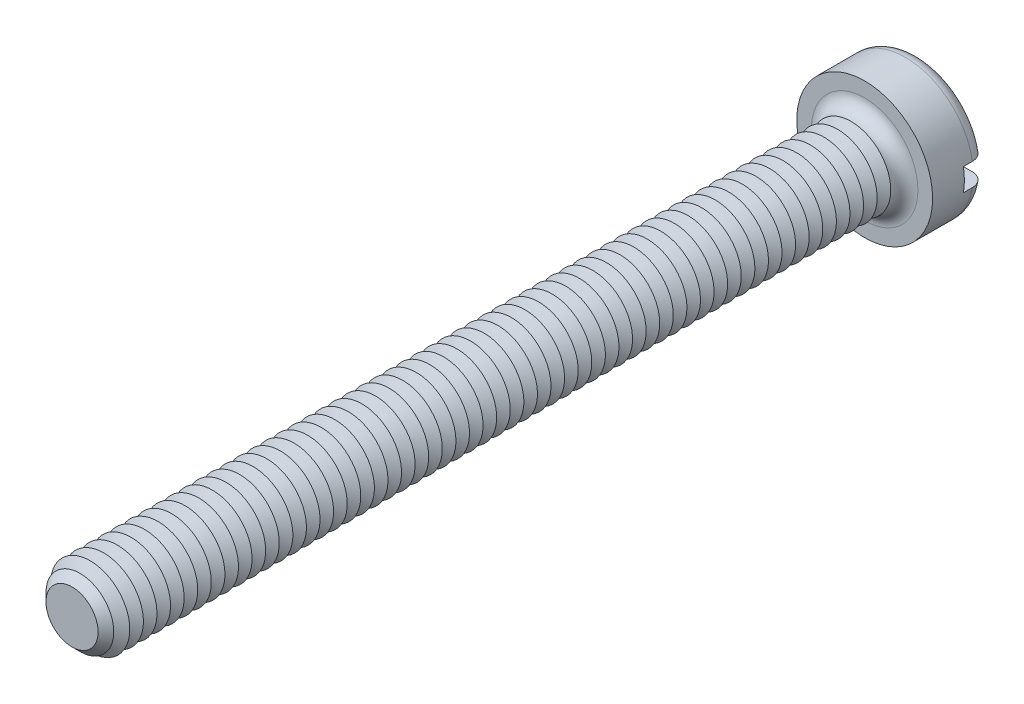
ISO-10303-21;
HEADER;
FILE_DESCRIPTION(('STEP AP214'),'2;1');
FILE_NAME('part.step','',(''),(''),'','','');
FILE_SCHEMA(('AUTOMOTIVE_DESIGN { 1 0 10303 214 1 1 1 1 }'));
ENDSEC;
DATA;
#1=APPLICATION_CONTEXT('core data for automotive mechanical design processes');
#2=APPLICATION_PROTOCOL_DEFINITION('international standard','automotive_design',2000,#1);
#3=PRODUCT_CONTEXT('',#1,'mechanical');
#4=PRODUCT('Part','Part','',(#3));
#5=PRODUCT_RELATED_PRODUCT_CATEGORY('part','',(#4));
#6=PRODUCT_DEFINITION_FORMATION('','',#4);
#7=PRODUCT_DEFINITION_CONTEXT('part definition',#1,'design');
#8=PRODUCT_DEFINITION('design','',#6,#7);
#9=PRODUCT_DEFINITION_SHAPE('','',#8);
#10=(LENGTH_UNIT() NAMED_UNIT(*) SI_UNIT(.MILLI.,.METRE.));
#11=(NAMED_UNIT(*) PLANE_ANGLE_UNIT() SI_UNIT($,.RADIAN.));
#12=(NAMED_UNIT(*) SI_UNIT($,.STERADIAN.) SOLID_ANGLE_UNIT());
#13=UNCERTAINTY_MEASURE_WITH_UNIT(LENGTH_MEASURE(1.E-05),#10,'distance_accuracy_value','');
#14=(GEOMETRIC_REPRESENTATION_CONTEXT(3) GLOBAL_UNCERTAINTY_ASSIGNED_CONTEXT((#13)) GLOBAL_UNIT_ASSIGNED_CONTEXT((#10,
#11,#12)) REPRESENTATION_CONTEXT('',''));
#15=CARTESIAN_POINT('',(0.,0.,0.));
#16=DIRECTION('',(0.,0.,1.));
#17=DIRECTION('',(1.,0.,0.));
#18=AXIS2_PLACEMENT_3D('',#15,#16,#17);
#19=CARTESIAN_POINT('',(0.,0.,-2.4));
#20=DIRECTION('',(0.,0.,1.));
#21=DIRECTION('',(1.,0.,0.));
#22=AXIS2_PLACEMENT_3D('',#19,#20,#21);
#23=PLANE('',#22);
#24=CARTESIAN_POINT('',(0.,0.,-2.4));
#25=DIRECTION('',(0.,0.,1.));
#26=DIRECTION('',(1.,0.,0.));
#27=AXIS2_PLACEMENT_3D('',#24,#25,#26);
#28=CIRCLE('',#27,2.4);
#29=CARTESIAN_POINT('',(-2.3473389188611,0.5,-2.4));
#30=VERTEX_POINT('',#29);
#31=CARTESIAN_POINT('',(2.3473389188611,0.5,-2.4));
#32=VERTEX_POINT('',#31);
#33=EDGE_CURVE('E116',#30,#32,#28,.F.);
#34=ORIENTED_EDGE('',*,*,#33,.T.);
#35=DIRECTION('',(1.,0.,0.));
#36=VECTOR('',#35,1.);
#37=CARTESIAN_POINT('',(-3.,0.5,-2.4));
#38=LINE('',#37,#36);
#39=EDGE_CURVE('E111',#30,#32,#38,.T.);
#40=ORIENTED_EDGE('',*,*,#39,.F.);
#41=EDGE_LOOP('',(#34,#40));
#42=FACE_BOUND('',#41,.T.);
#43=ADVANCED_FACE('F39',(#42),#23,.F.);
#44=CARTESIAN_POINT('',(0.,0.,-1.8));
#45=DIRECTION('',(0.,0.,1.));
#46=DIRECTION('',(1.,0.,0.));
#47=AXIS2_PLACEMENT_3D('',#44,#45,#46);
#48=TOROIDAL_SURFACE('',#47,2.4,0.6);
#49=CARTESIAN_POINT('',(-2.85761641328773,0.5,-2.13010535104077));
#50=CARTESIAN_POINT('',(-2.83871556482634,0.5,-2.1583605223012));
#51=CARTESIAN_POINT('',(-2.81738546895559,0.5,-2.18502342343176));
#52=CARTESIAN_POINT('',(-2.7705148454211,0.5,-2.23439244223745));
#53=CARTESIAN_POINT('',(-2.74496859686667,0.5,-2.25709309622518));
#54=CARTESIAN_POINT('',(-2.6904684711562,0.5,-2.29787524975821));
#55=CARTESIAN_POINT('',(-2.66151863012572,0.5,-2.3159621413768));
#56=CARTESIAN_POINT('',(-2.60103287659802,0.5,-2.34708203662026));
#57=CARTESIAN_POINT('',(-2.56949759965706,0.5,-2.36011627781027));
#58=CARTESIAN_POINT('',(-2.50430694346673,0.5,-2.38095952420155));
#59=CARTESIAN_POINT('',(-2.47062984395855,0.5,-2.38870056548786));
#60=CARTESIAN_POINT('',(-2.40245905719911,0.5,-2.39852415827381));
#61=CARTESIAN_POINT('',(-2.36796525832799,0.5,-2.40060593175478));
#62=CARTESIAN_POINT('',(-2.29850850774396,0.5,-2.39907718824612));
#63=CARTESIAN_POINT('',(-2.2635477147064,0.5,-2.3953679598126));
#64=CARTESIAN_POINT('',(-2.19472542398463,0.5,-2.38219781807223));
#65=CARTESIAN_POINT('',(-2.16086402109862,0.5,-2.37273641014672));
#66=CARTESIAN_POINT('',(-2.09483473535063,0.5,-2.3481926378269));
#67=CARTESIAN_POINT('',(-2.06268841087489,0.5,-2.3330521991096));
#68=CARTESIAN_POINT('',(-2.00140871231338,0.5,-2.29756210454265));
#69=CARTESIAN_POINT('',(-1.97227539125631,0.5,-2.27721235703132));
#70=CARTESIAN_POINT('',(-1.91805676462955,0.5,-2.23196210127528));
#71=CARTESIAN_POINT('',(-1.89294995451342,0.5,-2.20708739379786));
#72=CARTESIAN_POINT('',(-1.84740424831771,0.5,-2.1533758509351));
#73=CARTESIAN_POINT('',(-1.82696468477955,0.5,-2.12453958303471));
#74=CARTESIAN_POINT('',(-1.7919439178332,0.5,-2.06452274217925));
#75=CARTESIAN_POINT('',(-1.7772221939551,0.5,-2.03342424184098));
#76=CARTESIAN_POINT('',(-1.75343025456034,0.5,-1.96913621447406));
#77=CARTESIAN_POINT('',(-1.74435859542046,0.5,-1.93594722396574));
#78=CARTESIAN_POINT('',(-1.73243855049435,0.5,-1.86969199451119));
#79=CARTESIAN_POINT('',(-1.72938008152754,0.5,-1.83666346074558));
#80=CARTESIAN_POINT('',(-1.72896592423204,0.5,-1.77057287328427));
#81=CARTESIAN_POINT('',(-1.73160950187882,0.5,-1.73751082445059));
#82=CARTESIAN_POINT('',(-1.7423966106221,0.5,-1.67291835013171));
#83=CARTESIAN_POINT('',(-1.75043952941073,0.5,-1.64137102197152));
#84=CARTESIAN_POINT('',(-1.77163396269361,0.5,-1.58004446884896));
#85=CARTESIAN_POINT('',(-1.78478577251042,0.5,-1.55026534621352));
#86=CARTESIAN_POINT('',(-1.81598186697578,0.5,-1.49283859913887));
#87=CARTESIAN_POINT('',(-1.83409369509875,0.5,-1.46522772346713));
#88=CARTESIAN_POINT('',(-1.87455179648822,0.5,-1.41330756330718));
#89=CARTESIAN_POINT('',(-1.89689874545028,0.5,-1.38899880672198));
#90=CARTESIAN_POINT('',(-1.94600584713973,0.5,-1.34349499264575));
#91=CARTESIAN_POINT('',(-1.97289034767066,0.5,-1.32243411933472));
#92=CARTESIAN_POINT('',(-2.02972905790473,0.5,-1.28496935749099));
#93=CARTESIAN_POINT('',(-2.05968375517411,0.5,-1.26856621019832));
#94=CARTESIAN_POINT('',(-2.12276894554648,0.5,-1.24040709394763));
#95=CARTESIAN_POINT('',(-2.15596700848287,0.5,-1.22880230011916));
#96=CARTESIAN_POINT('',(-2.22383000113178,0.5,-1.21126311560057));
#97=CARTESIAN_POINT('',(-2.25849504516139,0.5,-1.20532916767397));
#98=CARTESIAN_POINT('',(-2.32870403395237,0.5,-1.1992792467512));
#99=CARTESIAN_POINT('',(-2.36425340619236,0.5,-1.19922586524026));
#100=CARTESIAN_POINT('',(-2.4348506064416,0.5,-1.2051326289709));
#101=CARTESIAN_POINT('',(-2.4698984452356,0.5,-1.21109264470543));
#102=CARTESIAN_POINT('',(-2.53821803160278,0.5,-1.22883658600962));
#103=CARTESIAN_POINT('',(-2.57150081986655,0.5,-1.24057794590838));
#104=CARTESIAN_POINT('',(-2.63557260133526,0.5,-1.2695744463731));
#105=CARTESIAN_POINT('',(-2.66636179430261,0.5,-1.28682914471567));
#106=CARTESIAN_POINT('',(-2.72402406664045,0.5,-1.32606063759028));
#107=CARTESIAN_POINT('',(-2.75095352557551,0.5,-1.34795455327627));
#108=CARTESIAN_POINT('',(-2.80067182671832,0.5,-1.39602603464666));
#109=CARTESIAN_POINT('',(-2.82346106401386,0.5,-1.42220319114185));
#110=CARTESIAN_POINT('',(-2.86383281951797,0.5,-1.47760238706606));
#111=CARTESIAN_POINT('',(-2.88149947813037,0.5,-1.50676312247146));
#112=CARTESIAN_POINT('',(-2.91160874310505,0.5,-1.56766595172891));
#113=CARTESIAN_POINT('',(-2.92405198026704,0.5,-1.59940773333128));
#114=CARTESIAN_POINT('',(-2.94319943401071,0.5,-1.66411282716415));
#115=CARTESIAN_POINT('',(-2.94997843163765,0.5,-1.69705402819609));
#116=CARTESIAN_POINT('',(-2.95787009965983,0.5,-1.7636173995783));
#117=CARTESIAN_POINT('',(-2.95898157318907,0.5,-1.79723971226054));
#118=CARTESIAN_POINT('',(-2.95551354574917,0.5,-1.86397776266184));
#119=CARTESIAN_POINT('',(-2.95096897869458,0.5,-1.89709534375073));
#120=CARTESIAN_POINT('',(-2.93638731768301,0.5,-1.96206785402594));
#121=CARTESIAN_POINT('',(-2.92635713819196,0.5,-1.99392431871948));
#122=CARTESIAN_POINT('',(-2.90618743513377,0.5,-2.04315073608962));
#123=CARTESIAN_POINT('',(-2.89769874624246,0.5,-2.06121519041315));
#124=CARTESIAN_POINT('',(-2.87895753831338,0.5,-2.096404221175));
#125=CARTESIAN_POINT('',(-2.86870503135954,0.5,-2.11352880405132));
#126=CARTESIAN_POINT('',(-2.85761641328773,0.5,-2.13010535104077));
#127=B_SPLINE_CURVE_WITH_KNOTS('',3,(#49,#50,#51,#52,#53,#54,#55,#56,#57,#58,#59,#60,#61,#62,
#63,#64,#65,#66,#67,#68,#69,#70,#71,#72,#73,#74,#75,#76,#77,#78,#79,#80,#81,#82,#83,#84,#85,#86,
#87,#88,#89,#90,#91,#92,#93,#94,#95,#96,#97,#98,#99,#100,#101,#102,#103,#104,#105,#106,#107,
#108,#109,#110,#111,#112,#113,#114,#115,#116,#117,#118,#119,#120,#121,#122,#123,#124,#125,#126),
.UNSPECIFIED.,.T.,.F.,(4,2,2,2,2,2,2,2,2,2,2,2,2,2,2,2,2,2,2,2,2,2,2,2,2,2,2,2,2,2,2,2,2,2,2,2,
2,2,4),(0.,0.101907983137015,0.203955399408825,0.305883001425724,0.407785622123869,
0.510973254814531,0.614175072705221,0.719155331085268,0.824144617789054,0.930238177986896,
1.03633360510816,1.14184204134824,1.24733537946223,1.35004136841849,1.45272110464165,
1.5517448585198,1.65075586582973,1.74797128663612,1.84519232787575,1.9438094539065,
2.0424423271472,2.14443321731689,2.24644032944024,2.35145317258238,2.45647421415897,
2.56261297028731,2.66874944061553,2.77411589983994,2.87947390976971,2.98308820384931,
3.08669260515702,3.18848388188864,3.29026286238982,3.39067588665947,3.49111011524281,
3.59092708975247,3.69061853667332,3.75040561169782,3.81019227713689),.UNSPECIFIED.);
#128=CARTESIAN_POINT('',(-2.95803989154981,0.5,-1.8));
#129=VERTEX_POINT('',#128);
#130=EDGE_CURVE('E639',#129,#30,#127,.T.);
#131=ORIENTED_EDGE('',*,*,#130,.F.);
#132=CARTESIAN_POINT('',(0.,0.,-1.8));
#133=DIRECTION('',(0.,0.,1.));
#134=DIRECTION('',(1.,0.,0.));
#135=AXIS2_PLACEMENT_3D('',#132,#133,#134);
#136=CIRCLE('',#135,3.);
#137=CARTESIAN_POINT('',(2.95803989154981,0.5,-1.8));
#138=VERTEX_POINT('',#137);
#139=EDGE_CURVE('E123',#138,#129,#136,.T.);
#140=ORIENTED_EDGE('',*,*,#139,.F.);
#141=CARTESIAN_POINT('',(1.78664846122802,0.5,-2.05158390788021));
#142=CARTESIAN_POINT('',(1.80142751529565,0.5,-2.08239430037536));
#143=CARTESIAN_POINT('',(1.81889355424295,0.5,-2.111949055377));
#144=CARTESIAN_POINT('',(1.8585933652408,0.5,-2.16770384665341));
#145=CARTESIAN_POINT('',(1.88083491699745,0.5,-2.19389829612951));
#146=CARTESIAN_POINT('',(1.92931942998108,0.5,-2.24217519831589));
#147=CARTESIAN_POINT('',(1.95555471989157,0.5,-2.26426535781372));
#148=CARTESIAN_POINT('',(2.01127789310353,0.5,-2.30384045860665));
#149=CARTESIAN_POINT('',(2.04076488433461,0.5,-2.32132665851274));
#150=CARTESIAN_POINT('',(2.10290022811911,0.5,-2.3516259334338));
#151=CARTESIAN_POINT('',(2.13560600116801,0.5,-2.3643213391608));
#152=CARTESIAN_POINT('',(2.20267136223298,0.5,-2.38412242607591));
#153=CARTESIAN_POINT('',(2.23703118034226,0.5,-2.3912273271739));
#154=CARTESIAN_POINT('',(2.30690186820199,0.5,-2.39969404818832));
#155=CARTESIAN_POINT('',(2.34242185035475,0.5,-2.40098100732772));
#156=CARTESIAN_POINT('',(2.41317063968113,0.5,-2.39753827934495));
#157=CARTESIAN_POINT('',(2.44839945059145,0.5,-2.39280866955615));
#158=CARTESIAN_POINT('',(2.51734146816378,0.5,-2.37746773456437));
#159=CARTESIAN_POINT('',(2.55106223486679,0.5,-2.3668904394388));
#160=CARTESIAN_POINT('',(2.61620389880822,0.5,-2.34013333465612));
#161=CARTESIAN_POINT('',(2.64762498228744,0.5,-2.32395397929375));
#162=CARTESIAN_POINT('',(2.70673284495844,0.5,-2.28672393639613));
#163=CARTESIAN_POINT('',(2.73447138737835,0.5,-2.26575544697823));
#164=CARTESIAN_POINT('',(2.78595339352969,0.5,-2.21938197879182));
#165=CARTESIAN_POINT('',(2.80969724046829,0.5,-2.19397742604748));
#166=CARTESIAN_POINT('',(2.85207235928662,0.5,-2.13993965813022));
#167=CARTESIAN_POINT('',(2.87078674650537,0.5,-2.11137160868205));
#168=CARTESIAN_POINT('',(2.90307455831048,0.5,-2.05146448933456));
#169=CARTESIAN_POINT('',(2.91664841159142,0.5,-2.02012565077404));
#170=CARTESIAN_POINT('',(2.93808283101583,0.5,-1.95603682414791));
#171=CARTESIAN_POINT('',(2.94602016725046,0.5,-1.92331249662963));
#172=CARTESIAN_POINT('',(2.95624273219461,0.5,-1.85699296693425));
#173=CARTESIAN_POINT('',(2.95852824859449,0.5,-1.82339780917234));
#174=CARTESIAN_POINT('',(2.95738171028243,0.5,-1.75655451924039));
#175=CARTESIAN_POINT('',(2.95399174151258,0.5,-1.72330565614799));
#176=CARTESIAN_POINT('',(2.94167749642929,0.5,-1.65784996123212));
#177=CARTESIAN_POINT('',(2.93275329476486,0.5,-1.62564311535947));
#178=CARTESIAN_POINT('',(2.90963870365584,0.5,-1.56317641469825));
#179=CARTESIAN_POINT('',(2.89544787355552,0.5,-1.53291672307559));
#180=CARTESIAN_POINT('',(2.86222325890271,0.5,-1.47518589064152));
#181=CARTESIAN_POINT('',(2.84318935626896,0.5,-1.44771481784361));
#182=CARTESIAN_POINT('',(2.80067851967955,0.5,-1.39611362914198));
#183=CARTESIAN_POINT('',(2.77716960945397,0.5,-1.37200986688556));
#184=CARTESIAN_POINT('',(2.72648704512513,0.5,-1.3280274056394));
#185=CARTESIAN_POINT('',(2.69931317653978,0.5,-1.3081489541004));
#186=CARTESIAN_POINT('',(2.64167967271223,0.5,-1.27288334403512));
#187=CARTESIAN_POINT('',(2.61118015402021,0.5,-1.25756138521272));
#188=CARTESIAN_POINT('',(2.54807315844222,0.5,-1.2321564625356));
#189=CARTESIAN_POINT('',(2.51546550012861,0.5,-1.22207395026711));
#190=CARTESIAN_POINT('',(2.44846246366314,0.5,-1.20724783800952));
#191=CARTESIAN_POINT('',(2.41404584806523,0.5,-1.2026002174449));
#192=CARTESIAN_POINT('',(2.34491756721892,0.5,-1.19904907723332));
#193=CARTESIAN_POINT('',(2.3102058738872,0.5,-1.20014611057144));
#194=CARTESIAN_POINT('',(2.24087507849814,0.5,-1.20808958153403));
#195=CARTESIAN_POINT('',(2.20626660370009,0.5,-1.21502895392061));
#196=CARTESIAN_POINT('',(2.13868705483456,0.5,-1.23457616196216));
#197=CARTESIAN_POINT('',(2.10571611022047,0.5,-1.24718444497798));
#198=CARTESIAN_POINT('',(2.04212010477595,0.5,-1.2778419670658));
#199=CARTESIAN_POINT('',(2.0115131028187,0.5,-1.29592871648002));
#200=CARTESIAN_POINT('',(1.95381117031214,0.5,-1.33703838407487));
#201=CARTESIAN_POINT('',(1.92671618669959,0.5,-1.36006122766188));
#202=CARTESIAN_POINT('',(1.8771749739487,0.5,-1.41014760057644));
#203=CARTESIAN_POINT('',(1.85467966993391,0.5,-1.43716252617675));
#204=CARTESIAN_POINT('',(1.8147167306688,0.5,-1.49468601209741));
#205=CARTESIAN_POINT('',(1.79724791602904,0.5,-1.52519375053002));
#206=CARTESIAN_POINT('',(1.76843420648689,0.5,-1.58782676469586));
#207=CARTESIAN_POINT('',(1.75691546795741,0.5,-1.61987202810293));
#208=CARTESIAN_POINT('',(1.73963101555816,0.5,-1.68548715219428));
#209=CARTESIAN_POINT('',(1.73386545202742,0.5,-1.71905705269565));
#210=CARTESIAN_POINT('',(1.72840927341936,0.5,-1.78556262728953));
#211=CARTESIAN_POINT('',(1.72852416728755,0.5,-1.8184825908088));
#212=CARTESIAN_POINT('',(1.73434422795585,0.5,-1.88379362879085));
#213=CARTESIAN_POINT('',(1.74004181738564,0.5,-1.91618535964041));
#214=CARTESIAN_POINT('',(1.75312909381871,0.5,-1.96568884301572));
#215=CARTESIAN_POINT('',(1.75869685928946,0.5,-1.98330302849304));
#216=CARTESIAN_POINT('',(1.77146455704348,0.5,-2.01792824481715));
#217=CARTESIAN_POINT('',(1.7786644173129,0.5,-2.03493930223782));
#218=CARTESIAN_POINT('',(1.78664846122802,0.5,-2.05158390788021));
#219=B_SPLINE_CURVE_WITH_KNOTS('',3,(#141,#142,#143,#144,#145,#146,#147,#148,#149,#150,#151,
#152,#153,#154,#155,#156,#157,#158,#159,#160,#161,#162,#163,#164,#165,#166,#167,#168,#169,#170,
#171,#172,#173,#174,#175,#176,#177,#178,#179,#180,#181,#182,#183,#184,#185,#186,#187,#188,#189,
#190,#191,#192,#193,#194,#195,#196,#197,#198,#199,#200,#201,#202,#203,#204,#205,#206,#207,#208,
#209,#210,#211,#212,#213,#214,#215,#216,#217,#218),.UNSPECIFIED.,.T.,.F.,(4,2,2,2,2,2,2,2,2,2,2,
2,2,2,2,2,2,2,2,2,2,2,2,2,2,2,2,2,2,2,2,2,2,2,2,2,2,2,4),(0.,0.10244464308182,0.205057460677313,
0.307475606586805,0.409865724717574,0.514628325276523,0.619405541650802,0.72552718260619,
0.831647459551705,0.937156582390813,1.04265715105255,1.1464674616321,1.25026780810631,
1.3522293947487,1.45418247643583,1.55471883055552,1.6552500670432,1.75503912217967,
1.8548268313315,1.95462289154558,2.05442138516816,2.15496174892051,2.25550799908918,
2.35743049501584,2.45936177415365,2.56306719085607,2.66678259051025,2.77217967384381,
2.87758507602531,2.98372914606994,3.08987161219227,3.19481457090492,3.29973288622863,
3.40138228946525,3.50303434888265,3.60132659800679,3.69948562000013,3.75483142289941,
3.8101747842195),.UNSPECIFIED.);
#220=EDGE_CURVE('E641',#32,#138,#219,.T.);
#221=ORIENTED_EDGE('',*,*,#220,.F.);
#222=ORIENTED_EDGE('',*,*,#33,.F.);
#223=EDGE_LOOP('',(#131,#140,#221,#222));
#224=FACE_BOUND('',#223,.T.);
#225=ADVANCED_FACE('F623',(#224),#48,.T.);
#226=CARTESIAN_POINT('',(0.,0.,-2.4));
#227=DIRECTION('',(0.,0.,1.));
#228=DIRECTION('',(1.,0.,0.));
#229=AXIS2_PLACEMENT_3D('',#226,#227,#228);
#230=CYLINDRICAL_SURFACE('',#229,3.);
#231=DIRECTION('',(0.,0.,1.));
#232=VECTOR('',#231,1.);
#233=CARTESIAN_POINT('',(2.95803989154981,0.5,-2.4));
#234=LINE('',#233,#232);
#235=CARTESIAN_POINT('',(2.95803989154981,0.5,-1.4));
#236=VERTEX_POINT('',#235);
#237=EDGE_CURVE('E656',#138,#236,#234,.T.);
#238=ORIENTED_EDGE('',*,*,#237,.F.);
#239=ORIENTED_EDGE('',*,*,#139,.T.);
#240=DIRECTION('',(0.,0.,1.));
#241=VECTOR('',#240,1.);
#242=CARTESIAN_POINT('',(-2.95803989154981,0.5,-2.4));
#243=LINE('',#242,#241);
#244=CARTESIAN_POINT('',(-2.95803989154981,0.5,-1.4));
#245=VERTEX_POINT('',#244);
#246=EDGE_CURVE('E63',#245,#129,#243,.F.);
#247=ORIENTED_EDGE('',*,*,#246,.F.);
#248=CARTESIAN_POINT('',(0.,0.,-1.4));
#249=DIRECTION('',(0.,0.,-1.));
#250=DIRECTION('',(-1.,0.,0.));
#251=AXIS2_PLACEMENT_3D('',#248,#249,#250);
#252=CIRCLE('',#251,3.);
#253=CARTESIAN_POINT('',(-2.95803989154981,-0.5,-1.4));
#254=VERTEX_POINT('',#253);
#255=EDGE_CURVE('E43',#245,#254,#252,.F.);
#256=ORIENTED_EDGE('',*,*,#255,.T.);
#257=DIRECTION('',(0.,0.,1.));
#258=VECTOR('',#257,1.);
#259=CARTESIAN_POINT('',(-2.95803989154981,-0.5,-2.4));
#260=LINE('',#259,#258);
#261=CARTESIAN_POINT('',(-2.9580398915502,-0.5,-1.79999999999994));
#262=VERTEX_POINT('',#261);
#263=EDGE_CURVE('E653',#262,#254,#260,.T.);
#264=ORIENTED_EDGE('',*,*,#263,.F.);
#265=CARTESIAN_POINT('',(2.95803989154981,-0.5,-1.8));
#266=VERTEX_POINT('',#265);
#267=EDGE_CURVE('E125',#262,#266,#136,.T.);
#268=ORIENTED_EDGE('',*,*,#267,.T.);
#269=DIRECTION('',(0.,0.,1.));
#270=VECTOR('',#269,1.);
#271=CARTESIAN_POINT('',(2.95803989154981,-0.5,-2.4));
#272=LINE('',#271,#270);
#273=CARTESIAN_POINT('',(2.95803989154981,-0.5,-1.4));
#274=VERTEX_POINT('',#273);
#275=EDGE_CURVE('E55',#274,#266,#272,.F.);
#276=ORIENTED_EDGE('',*,*,#275,.F.);
#277=EDGE_CURVE('E11',#274,#236,#252,.F.);
#278=ORIENTED_EDGE('',*,*,#277,.T.);
#279=EDGE_LOOP('',(#238,#239,#247,#256,#264,#268,#276,#278));
#280=FACE_BOUND('',#279,.T.);
#281=CARTESIAN_POINT('',(0.,0.,0.));
#282=DIRECTION('',(0.,0.,1.));
#283=DIRECTION('',(1.,0.,0.));
#284=AXIS2_PLACEMENT_3D('',#281,#282,#283);
#285=CIRCLE('',#284,3.);
#286=CARTESIAN_POINT('',(3.,0.,0.));
#287=VERTEX_POINT('',#286);
#288=EDGE_CURVE('E659',#287,#287,#285,.T.);
#289=ORIENTED_EDGE('',*,*,#288,.F.);
#290=EDGE_LOOP('',(#289));
#291=FACE_BOUND('',#290,.T.);
#292=ADVANCED_FACE('F619',(#280,#291),#230,.T.);
#293=CARTESIAN_POINT('',(2.3473389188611,-0.5,-2.4));
#294=VERTEX_POINT('',#293);
#295=CARTESIAN_POINT('',(-2.3473389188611,-0.5,-2.4));
#296=VERTEX_POINT('',#295);
#297=EDGE_CURVE('E109',#294,#296,#28,.F.);
#298=ORIENTED_EDGE('',*,*,#297,.T.);
#299=DIRECTION('',(-1.,0.,0.));
#300=VECTOR('',#299,1.);
#301=CARTESIAN_POINT('',(-3.,-0.5,-2.4));
#302=LINE('',#301,#300);
#303=EDGE_CURVE('E96',#294,#296,#302,.T.);
#304=ORIENTED_EDGE('',*,*,#303,.F.);
#305=EDGE_LOOP('',(#298,#304));
#306=FACE_BOUND('',#305,.T.);
#307=ADVANCED_FACE('F108',(#306),#23,.F.);
#308=CARTESIAN_POINT('',(0.,0.,0.));
#309=DIRECTION('',(0.,0.,1.));
#310=DIRECTION('',(1.,0.,0.));
#311=AXIS2_PLACEMENT_3D('',#308,#309,#310);
#312=PLANE('',#311);
#313=CARTESIAN_POINT('',(0.,0.,0.));
#314=DIRECTION('',(0.,0.,1.));
#315=DIRECTION('',(1.,0.,0.));
#316=AXIS2_PLACEMENT_3D('',#313,#314,#315);
#317=CIRCLE('',#316,2.35);
#318=CARTESIAN_POINT('',(2.35,0.,0.));
#319=VERTEX_POINT('',#318);
#320=EDGE_CURVE('E115',#319,#319,#317,.F.);
#321=ORIENTED_EDGE('',*,*,#320,.T.);
#322=EDGE_LOOP('',(#321));
#323=FACE_BOUND('',#322,.T.);
#324=ORIENTED_EDGE('',*,*,#288,.T.);
#325=EDGE_LOOP('',(#324));
#326=FACE_BOUND('',#325,.T.);
#327=ADVANCED_FACE('F618',(#323,#326),#312,.T.);
#328=CARTESIAN_POINT('',(-2.85761641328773,-0.5,-2.13010535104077));
#329=CARTESIAN_POINT('',(-2.87617085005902,-0.5,-2.10236255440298));
#330=CARTESIAN_POINT('',(-2.89241094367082,-0.5,-2.07304478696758));
#331=CARTESIAN_POINT('',(-2.91975805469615,-0.5,-2.01207835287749));
#332=CARTESIAN_POINT('',(-2.93085958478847,-0.5,-1.98042723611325));
#333=CARTESIAN_POINT('',(-2.94757590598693,-0.5,-1.91570997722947));
#334=CARTESIAN_POINT('',(-2.95319165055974,-0.5,-1.88264408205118));
#335=CARTESIAN_POINT('',(-2.95876526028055,-0.5,-1.81604673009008));
#336=CARTESIAN_POINT('',(-2.95872441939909,-0.5,-1.78251538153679));
#337=CARTESIAN_POINT('',(-2.95300126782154,-0.5,-1.71606888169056));
#338=CARTESIAN_POINT('',(-2.94734076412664,-0.5,-1.68315184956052));
#339=CARTESIAN_POINT('',(-2.93058183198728,-0.5,-1.61873244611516));
#340=CARTESIAN_POINT('',(-2.91948325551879,-0.5,-1.58723011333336));
#341=CARTESIAN_POINT('',(-2.89215903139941,-0.5,-1.52647404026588));
#342=CARTESIAN_POINT('',(-2.87592518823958,-0.5,-1.49722398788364));
#343=CARTESIAN_POINT('',(-2.83881787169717,-0.5,-1.44183365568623));
#344=CARTESIAN_POINT('',(-2.81794425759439,-0.5,-1.41569347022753));
#345=CARTESIAN_POINT('',(-2.77196258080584,-0.5,-1.36700890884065));
#346=CARTESIAN_POINT('',(-2.74681874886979,-0.5,-1.34449832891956));
#347=CARTESIAN_POINT('',(-2.69315595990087,-0.5,-1.30394571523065));
#348=CARTESIAN_POINT('',(-2.66463678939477,-0.5,-1.28590396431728));
#349=CARTESIAN_POINT('',(-2.6045885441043,-0.5,-1.25451133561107));
#350=CARTESIAN_POINT('',(-2.573021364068,-0.5,-1.24123336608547));
#351=CARTESIAN_POINT('',(-2.50813094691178,-0.5,-1.22006271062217));
#352=CARTESIAN_POINT('',(-2.47480755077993,-0.5,-1.21217051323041));
#353=CARTESIAN_POINT('',(-2.40672281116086,-0.5,-1.20185046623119));
#354=CARTESIAN_POINT('',(-2.37194646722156,-0.5,-1.19952155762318));
#355=CARTESIAN_POINT('',(-2.30248663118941,-0.5,-1.20064178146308));
#356=CARTESIAN_POINT('',(-2.26780314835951,-0.5,-1.20409147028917));
#357=CARTESIAN_POINT('',(-2.19896003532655,-0.5,-1.21674803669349));
#358=CARTESIAN_POINT('',(-2.16481620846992,-0.5,-1.22604100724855));
#359=CARTESIAN_POINT('',(-2.09855902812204,-0.5,-1.25020237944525));
#360=CARTESIAN_POINT('',(-2.0664458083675,-0.5,-1.2650711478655));
#361=CARTESIAN_POINT('',(-2.00504979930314,-0.5,-1.3000633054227));
#362=CARTESIAN_POINT('',(-1.97577870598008,-0.5,-1.32020724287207));
#363=CARTESIAN_POINT('',(-1.92109882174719,-0.5,-1.36519538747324));
#364=CARTESIAN_POINT('',(-1.89568984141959,-0.5,-1.39003936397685));
#365=CARTESIAN_POINT('',(-1.84992350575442,-0.5,-1.44333696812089));
#366=CARTESIAN_POINT('',(-1.82949305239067,-0.5,-1.47172774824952));
#367=CARTESIAN_POINT('',(-1.79388305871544,-0.5,-1.53163225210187));
#368=CARTESIAN_POINT('',(-1.77870235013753,-0.5,-1.56314527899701));
#369=CARTESIAN_POINT('',(-1.7545759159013,-0.5,-1.62726698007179));
#370=CARTESIAN_POINT('',(-1.74543784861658,-0.5,-1.65980327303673));
#371=CARTESIAN_POINT('',(-1.73294830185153,-0.5,-1.72596654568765));
#372=CARTESIAN_POINT('',(-1.72959555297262,-0.5,-1.7595932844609));
#373=CARTESIAN_POINT('',(-1.72881879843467,-0.5,-1.82588200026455));
#374=CARTESIAN_POINT('',(-1.73121660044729,-0.5,-1.85854202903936));
#375=CARTESIAN_POINT('',(-1.74148022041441,-0.5,-1.9229888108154));
#376=CARTESIAN_POINT('',(-1.74934586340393,-0.5,-1.95477559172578));
#377=CARTESIAN_POINT('',(-1.77023164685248,-0.5,-2.01650910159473));
#378=CARTESIAN_POINT('',(-1.78323812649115,-0.5,-2.04646046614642));
#379=CARTESIAN_POINT('',(-1.81396733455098,-0.5,-2.10383471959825));
#380=CARTESIAN_POINT('',(-1.83169061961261,-0.5,-2.13125730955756));
#381=CARTESIAN_POINT('',(-1.87183626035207,-0.5,-2.18359240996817));
#382=CARTESIAN_POINT('',(-1.89437158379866,-0.5,-2.20841820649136));
#383=CARTESIAN_POINT('',(-1.9431646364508,-0.5,-2.25409214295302));
#384=CARTESIAN_POINT('',(-1.96942301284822,-0.5,-2.27493958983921));
#385=CARTESIAN_POINT('',(-2.025898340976,-0.5,-2.31281042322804));
#386=CARTESIAN_POINT('',(-2.05622082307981,-0.5,-2.32967654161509));
#387=CARTESIAN_POINT('',(-2.11922391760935,-0.5,-2.35820255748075));
#388=CARTESIAN_POINT('',(-2.15190483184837,-0.5,-2.3698617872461));
#389=CARTESIAN_POINT('',(-2.21944675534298,-0.5,-2.38785911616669));
#390=CARTESIAN_POINT('',(-2.25433929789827,-0.5,-2.39407914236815));
#391=CARTESIAN_POINT('',(-2.32467357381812,-0.5,-2.40058243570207));
#392=CARTESIAN_POINT('',(-2.36011530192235,-0.5,-2.40086575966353));
#393=CARTESIAN_POINT('',(-2.43058129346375,-0.5,-2.39545061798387));
#394=CARTESIAN_POINT('',(-2.46560504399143,-0.5,-2.38974544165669));
#395=CARTESIAN_POINT('',(-2.53418188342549,-0.5,-2.37245602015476));
#396=CARTESIAN_POINT('',(-2.56773468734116,-0.5,-2.36087064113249));
#397=CARTESIAN_POINT('',(-2.63195003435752,-0.5,-2.33229154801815));
#398=CARTESIAN_POINT('',(-2.66264330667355,-0.5,-2.31536681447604));
#399=CARTESIAN_POINT('',(-2.72065333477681,-0.5,-2.2765252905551));
#400=CARTESIAN_POINT('',(-2.7479744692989,-0.5,-2.25461508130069));
#401=CARTESIAN_POINT('',(-2.78903570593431,-0.5,-2.21539504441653));
#402=CARTESIAN_POINT('',(-2.80405150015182,-0.5,-2.19939833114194));
#403=CARTESIAN_POINT('',(-2.83224965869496,-0.5,-2.16586257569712));
#404=CARTESIAN_POINT('',(-2.84543204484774,-0.5,-2.14832355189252));
#405=CARTESIAN_POINT('',(-2.85761641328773,-0.5,-2.13010535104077));
#406=B_SPLINE_CURVE_WITH_KNOTS('',3,(#328,#329,#330,#331,#332,#333,#334,#335,#336,#337,#338,
#339,#340,#341,#342,#343,#344,#345,#346,#347,#348,#349,#350,#351,#352,#353,#354,#355,#356,#357,
#358,#359,#360,#361,#362,#363,#364,#365,#366,#367,#368,#369,#370,#371,#372,#373,#374,#375,#376,
#377,#378,#379,#380,#381,#382,#383,#384,#385,#386,#387,#388,#389,#390,#391,#392,#393,#394,#395,
#396,#397,#398,#399,#400,#401,#402,#403,#404,#405),.UNSPECIFIED.,.T.,.F.,(4,2,2,2,2,2,2,2,2,2,2,
2,2,2,2,2,2,2,2,2,2,2,2,2,2,2,2,2,2,2,2,2,2,2,2,2,2,2,4),(0.,0.100047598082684,
0.200201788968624,0.300338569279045,0.400452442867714,0.500179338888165,0.599908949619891,
0.699798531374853,0.799691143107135,0.900465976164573,1.00124718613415,1.10351091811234,
1.20578392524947,1.30986270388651,1.41395150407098,1.51961105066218,1.62527754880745,
1.73136193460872,1.83744111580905,1.94185359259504,2.04624281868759,2.1471248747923,
2.24798479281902,2.34575994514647,2.44353196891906,2.541045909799,2.63857136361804,
2.73870431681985,2.83885469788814,2.94247024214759,3.0460990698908,3.15192527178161,
3.25775046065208,3.36369436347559,3.46965870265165,3.57430655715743,3.67881706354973,
3.74451732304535,3.81021680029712),.UNSPECIFIED.);
#407=EDGE_CURVE('E103',#296,#262,#406,.T.);
#408=ORIENTED_EDGE('',*,*,#407,.F.);
#409=ORIENTED_EDGE('',*,*,#297,.F.);
#410=CARTESIAN_POINT('',(1.78664846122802,-0.5,-2.05158390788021));
#411=CARTESIAN_POINT('',(1.77253256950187,-0.5,-2.02214917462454));
#412=CARTESIAN_POINT('',(1.76084795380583,-0.5,-1.99152692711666));
#413=CARTESIAN_POINT('',(1.74276267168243,-0.5,-1.92873811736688));
#414=CARTESIAN_POINT('',(1.73636622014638,-0.5,-1.89657034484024));
#415=CARTESIAN_POINT('',(1.72910271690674,-0.5,-1.83160458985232));
#416=CARTESIAN_POINT('',(1.72823699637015,-0.5,-1.79880645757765));
#417=CARTESIAN_POINT('',(1.73207277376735,-0.5,-1.73354460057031));
#418=CARTESIAN_POINT('',(1.7367732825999,-0.5,-1.70108081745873));
#419=CARTESIAN_POINT('',(1.75151033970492,-0.5,-1.63763571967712));
#420=CARTESIAN_POINT('',(1.76150868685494,-0.5,-1.60664550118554));
#421=CARTESIAN_POINT('',(1.78646773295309,-0.5,-1.54673433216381));
#422=CARTESIAN_POINT('',(1.80142897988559,-0.5,-1.51781361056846));
#423=CARTESIAN_POINT('',(1.8361687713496,-0.5,-1.46223275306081));
#424=CARTESIAN_POINT('',(1.85603637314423,-0.5,-1.43562834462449));
#425=CARTESIAN_POINT('',(1.89981598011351,-0.5,-1.38598822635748));
#426=CARTESIAN_POINT('',(1.92372865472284,-0.5,-1.3629531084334));
#427=CARTESIAN_POINT('',(1.97581791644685,-0.5,-1.32025912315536));
#428=CARTESIAN_POINT('',(2.00411431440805,-0.5,-1.30074638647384));
#429=CARTESIAN_POINT('',(2.06351340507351,-0.5,-1.26660223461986));
#430=CARTESIAN_POINT('',(2.09461651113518,-0.5,-1.2519715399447));
#431=CARTESIAN_POINT('',(2.15964055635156,-0.5,-1.22763649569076));
#432=CARTESIAN_POINT('',(2.19361437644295,-0.5,-1.21807321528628));
#433=CARTESIAN_POINT('',(2.26268197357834,-0.5,-1.20474094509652));
#434=CARTESIAN_POINT('',(2.29777581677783,-0.5,-1.20097229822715));
#435=CARTESIAN_POINT('',(2.36834397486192,-0.5,-1.19935270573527));
#436=CARTESIAN_POINT('',(2.40381924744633,-0.5,-1.20154258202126));
#437=CARTESIAN_POINT('',(2.47388621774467,-0.5,-1.211906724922));
#438=CARTESIAN_POINT('',(2.50847794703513,-0.5,-1.22008077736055));
#439=CARTESIAN_POINT('',(2.57542869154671,-0.5,-1.24211740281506));
#440=CARTESIAN_POINT('',(2.60780612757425,-0.5,-1.25592395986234));
#441=CARTESIAN_POINT('',(2.66972487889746,-0.5,-1.28886991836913));
#442=CARTESIAN_POINT('',(2.69926644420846,-0.5,-1.3080088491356));
#443=CARTESIAN_POINT('',(2.75412764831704,-0.5,-1.35072337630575));
#444=CARTESIAN_POINT('',(2.77951140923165,-0.5,-1.37421661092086));
#445=CARTESIAN_POINT('',(2.82588981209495,-0.5,-1.42519687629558));
#446=CARTESIAN_POINT('',(2.84688487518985,-0.5,-1.4526835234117));
#447=CARTESIAN_POINT('',(2.88351678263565,-0.5,-1.51036368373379));
#448=CARTESIAN_POINT('',(2.89923879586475,-0.5,-1.54050312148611));
#449=CARTESIAN_POINT('',(2.92532780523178,-0.5,-1.60301687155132));
#450=CARTESIAN_POINT('',(2.93569520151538,-0.5,-1.63539101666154));
#451=CARTESIAN_POINT('',(2.95066155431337,-0.5,-1.70102985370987));
#452=CARTESIAN_POINT('',(2.95532930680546,-0.5,-1.73427887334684));
#453=CARTESIAN_POINT('',(2.9589838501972,-0.5,-1.80108716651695));
#454=CARTESIAN_POINT('',(2.95797087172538,-0.5,-1.83464642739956));
#455=CARTESIAN_POINT('',(2.9503157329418,-0.5,-1.90093629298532));
#456=CARTESIAN_POINT('',(2.9437032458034,-0.5,-1.93367033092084));
#457=CARTESIAN_POINT('',(2.92508830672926,-0.5,-1.99756717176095));
#458=CARTESIAN_POINT('',(2.91308586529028,-0.5,-2.02872997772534));
#459=CARTESIAN_POINT('',(2.88401713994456,-0.5,-2.08868263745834));
#460=CARTESIAN_POINT('',(2.86693946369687,-0.5,-2.11746696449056));
#461=CARTESIAN_POINT('',(2.82823635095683,-0.5,-2.17179415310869));
#462=CARTESIAN_POINT('',(2.80661076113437,-0.5,-2.19733690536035));
#463=CARTESIAN_POINT('',(2.75921750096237,-0.5,-2.24472182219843));
#464=CARTESIAN_POINT('',(2.73341278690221,-0.5,-2.26652692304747));
#465=CARTESIAN_POINT('',(2.67855512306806,-0.5,-2.30557116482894));
#466=CARTESIAN_POINT('',(2.64950194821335,-0.5,-2.32280998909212));
#467=CARTESIAN_POINT('',(2.58850670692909,-0.5,-2.35251615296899));
#468=CARTESIAN_POINT('',(2.55652763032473,-0.5,-2.36490748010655));
#469=CARTESIAN_POINT('',(2.4909651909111,-0.5,-2.38424946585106));
#470=CARTESIAN_POINT('',(2.45738167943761,-0.5,-2.39119961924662));
#471=CARTESIAN_POINT('',(2.38892891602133,-0.5,-2.39958830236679));
#472=CARTESIAN_POINT('',(2.35404742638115,-0.5,-2.40092701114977));
#473=CARTESIAN_POINT('',(2.28454389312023,-0.5,-2.39781917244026));
#474=CARTESIAN_POINT('',(2.24992186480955,-0.5,-2.39337228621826));
#475=CARTESIAN_POINT('',(2.18139250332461,-0.5,-2.37872879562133));
#476=CARTESIAN_POINT('',(2.14750264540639,-0.5,-2.36845030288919));
#477=CARTESIAN_POINT('',(2.08190943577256,-0.5,-2.34236291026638));
#478=CARTESIAN_POINT('',(2.05020675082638,-0.5,-2.32655233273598));
#479=CARTESIAN_POINT('',(1.98982495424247,-0.5,-2.28976285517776));
#480=CARTESIAN_POINT('',(1.96115527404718,-0.5,-2.26876847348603));
#481=CARTESIAN_POINT('',(1.90785147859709,-0.5,-2.22220002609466));
#482=CARTESIAN_POINT('',(1.88321231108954,-0.5,-2.19663177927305));
#483=CARTESIAN_POINT('',(1.84638483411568,-0.5,-2.15106161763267));
#484=CARTESIAN_POINT('',(1.8328227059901,-0.5,-2.13215328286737));
#485=CARTESIAN_POINT('',(1.80797918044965,-0.5,-2.09289185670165));
#486=CARTESIAN_POINT('',(1.79669771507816,-0.5,-2.07253880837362));
#487=CARTESIAN_POINT('',(1.78664846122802,-0.5,-2.05158390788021));
#488=B_SPLINE_CURVE_WITH_KNOTS('',3,(#410,#411,#412,#413,#414,#415,#416,#417,#418,#419,#420,
#421,#422,#423,#424,#425,#426,#427,#428,#429,#430,#431,#432,#433,#434,#435,#436,#437,#438,#439,
#440,#441,#442,#443,#444,#445,#446,#447,#448,#449,#450,#451,#452,#453,#454,#455,#456,#457,#458,
#459,#460,#461,#462,#463,#464,#465,#466,#467,#468,#469,#470,#471,#472,#473,#474,#475,#476,#477,
#478,#479,#480,#481,#482,#483,#484,#485,#486,#487),.UNSPECIFIED.,.T.,.F.,(4,2,2,2,2,2,2,2,2,2,2,
2,2,2,2,2,2,2,2,2,2,2,2,2,2,2,2,2,2,2,2,2,2,2,2,2,2,2,4),(0.,0.0978512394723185,0.19578039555,
0.293733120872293,0.391668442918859,0.488907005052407,0.58615630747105,0.685320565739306,
0.784501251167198,0.887148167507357,0.989810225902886,1.09519726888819,1.20059054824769,
1.30670769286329,1.41282103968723,1.51790384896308,1.62297738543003,1.72623563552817,
1.82948397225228,1.93097382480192,2.03245609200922,2.13270093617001,2.23294171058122,
2.33265458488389,2.43236726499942,2.53230548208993,2.63224706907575,2.73312861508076,
2.83401715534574,2.93642973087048,3.03885181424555,3.14308833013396,3.24733094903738,
3.35307493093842,3.45885100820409,3.56494689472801,3.67090875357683,3.74057217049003,
3.81023351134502),.UNSPECIFIED.);
#489=EDGE_CURVE('E92',#266,#294,#488,.T.);
#490=ORIENTED_EDGE('',*,*,#489,.F.);
#491=ORIENTED_EDGE('',*,*,#267,.F.);
#492=EDGE_LOOP('',(#408,#409,#490,#491));
#493=FACE_BOUND('',#492,.T.);
#494=ADVANCED_FACE('F113',(#493),#48,.T.);
#495=CARTESIAN_POINT('',(0.,0.,0.600000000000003));
#496=DIRECTION('',(0.,0.,1.));
#497=DIRECTION('',(1.,0.,0.));
#498=AXIS2_PLACEMENT_3D('',#495,#496,#497);
#499=TOROIDAL_SURFACE('',#498,2.35,0.6);
#500=ORIENTED_EDGE('',*,*,#320,.F.);
#501=EDGE_LOOP('',(#500));
#502=FACE_BOUND('',#501,.T.);
#503=CARTESIAN_POINT('',(0.,0.,0.6));
#504=DIRECTION('',(0.,0.,-1.));
#505=DIRECTION('',(-1.,0.,0.));
#506=AXIS2_PLACEMENT_3D('',#503,#504,#505);
#507=CIRCLE('',#506,1.75);
#508=CARTESIAN_POINT('',(-1.75,0.,0.6));
#509=VERTEX_POINT('',#508);
#510=EDGE_CURVE('E665',#509,#509,#507,.T.);
#511=ORIENTED_EDGE('',*,*,#510,.T.);
#512=EDGE_LOOP('',(#511));
#513=FACE_BOUND('',#512,.T.);
#514=ADVANCED_FACE('F611',(#502,#513),#499,.F.);
#515=CARTESIAN_POINT('',(0.,0.,0.9));
#516=DIRECTION('',(0.,0.,-1.));
#517=DIRECTION('',(-1.,0.,0.));
#518=AXIS2_PLACEMENT_3D('',#515,#516,#517);
#519=CONICAL_SURFACE('',#518,1.23038475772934,1.0471975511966);
#520=ORIENTED_EDGE('',*,*,#510,.F.);
#521=EDGE_LOOP('',(#520));
#522=FACE_BOUND('',#521,.T.);
#523=CARTESIAN_POINT('',(0.,0.,0.9));
#524=DIRECTION('',(0.,0.,-1.));
#525=DIRECTION('',(-1.,0.,0.));
#526=AXIS2_PLACEMENT_3D('',#523,#524,#525);
#527=CIRCLE('',#526,1.23038475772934);
#528=CARTESIAN_POINT('',(-1.23038475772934,0.,0.9));
#529=VERTEX_POINT('',#528);
#530=EDGE_CURVE('E671',#529,#529,#527,.T.);
#531=ORIENTED_EDGE('',*,*,#530,.T.);
#532=EDGE_LOOP('',(#531));
#533=FACE_BOUND('',#532,.T.);
#534=ADVANCED_FACE('F607',(#522,#533),#519,.T.);
#535=CARTESIAN_POINT('',(0.,0.,1.2));
#536=DIRECTION('',(0.,0.,1.));
#537=DIRECTION('',(1.,0.,0.));
#538=AXIS2_PLACEMENT_3D('',#535,#536,#537);
#539=CONICAL_SURFACE('',#538,1.75,1.0471975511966);
#540=ORIENTED_EDGE('',*,*,#530,.F.);
#541=EDGE_LOOP('',(#540));
#542=FACE_BOUND('',#541,.T.);
#543=CARTESIAN_POINT('',(0.,0.,1.2));
#544=DIRECTION('',(0.,0.,-1.));
#545=DIRECTION('',(-1.,0.,0.));
#546=AXIS2_PLACEMENT_3D('',#543,#544,#545);
#547=CIRCLE('',#546,1.75);
#548=CARTESIAN_POINT('',(-1.75,0.,1.2));
#549=VERTEX_POINT('',#548);
#550=EDGE_CURVE('E677',#549,#549,#547,.T.);
#551=ORIENTED_EDGE('',*,*,#550,.T.);
#552=EDGE_LOOP('',(#551));
#553=FACE_BOUND('',#552,.T.);
#554=ADVANCED_FACE('F603',(#542,#553),#539,.T.);
#555=CARTESIAN_POINT('',(0.,0.,1.5));
#556=DIRECTION('',(0.,0.,-1.));
#557=DIRECTION('',(-1.,0.,0.));
#558=AXIS2_PLACEMENT_3D('',#555,#556,#557);
#559=CONICAL_SURFACE('',#558,1.23038475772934,1.0471975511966);
#560=ORIENTED_EDGE('',*,*,#550,.F.);
#561=EDGE_LOOP('',(#560));
#562=FACE_BOUND('',#561,.T.);
#563=CARTESIAN_POINT('',(0.,0.,1.5));
#564=DIRECTION('',(0.,0.,-1.));
#565=DIRECTION('',(-1.,0.,0.));
#566=AXIS2_PLACEMENT_3D('',#563,#564,#565);
#567=CIRCLE('',#566,1.23038475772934);
#568=CARTESIAN_POINT('',(-1.23038475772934,0.,1.5));
#569=VERTEX_POINT('',#568);
#570=EDGE_CURVE('E681',#569,#569,#567,.T.);
#571=ORIENTED_EDGE('',*,*,#570,.T.);
#572=EDGE_LOOP('',(#571));
#573=FACE_BOUND('',#572,.T.);
#574=ADVANCED_FACE('F599',(#562,#573),#559,.T.);
#575=CARTESIAN_POINT('',(0.,0.,1.8));
#576=DIRECTION('',(0.,0.,1.));
#577=DIRECTION('',(1.,0.,0.));
#578=AXIS2_PLACEMENT_3D('',#575,#576,#577);
#579=CONICAL_SURFACE('',#578,1.75,1.0471975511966);
#580=ORIENTED_EDGE('',*,*,#570,.F.);
#581=EDGE_LOOP('',(#580));
#582=FACE_BOUND('',#581,.T.);
#583=CARTESIAN_POINT('',(0.,0.,1.8));
#584=DIRECTION('',(0.,0.,-1.));
#585=DIRECTION('',(-1.,0.,0.));
#586=AXIS2_PLACEMENT_3D('',#583,#584,#585);
#587=CIRCLE('',#586,1.75);
#588=CARTESIAN_POINT('',(-1.75,0.,1.8));
#589=VERTEX_POINT('',#588);
#590=EDGE_CURVE('E684',#589,#589,#587,.T.);
#591=ORIENTED_EDGE('',*,*,#590,.T.);
#592=EDGE_LOOP('',(#591));
#593=FACE_BOUND('',#592,.T.);
#594=ADVANCED_FACE('F595',(#582,#593),#579,.T.);
#595=CARTESIAN_POINT('',(0.,0.,2.1));
#596=DIRECTION('',(0.,0.,-1.));
#597=DIRECTION('',(-1.,0.,0.));
#598=AXIS2_PLACEMENT_3D('',#595,#596,#597);
#599=CONICAL_SURFACE('',#598,1.23038475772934,1.0471975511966);
#600=ORIENTED_EDGE('',*,*,#590,.F.);
#601=EDGE_LOOP('',(#600));
#602=FACE_BOUND('',#601,.T.);
#603=CARTESIAN_POINT('',(0.,0.,2.1));
#604=DIRECTION('',(0.,0.,-1.));
#605=DIRECTION('',(-1.,0.,0.));
#606=AXIS2_PLACEMENT_3D('',#603,#604,#605);
#607=CIRCLE('',#606,1.23038475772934);
#608=CARTESIAN_POINT('',(-1.23038475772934,0.,2.1));
#609=VERTEX_POINT('',#608);
#610=EDGE_CURVE('E688',#609,#609,#607,.T.);
#611=ORIENTED_EDGE('',*,*,#610,.T.);
#612=EDGE_LOOP('',(#611));
#613=FACE_BOUND('',#612,.T.);
#614=ADVANCED_FACE('F591',(#602,#613),#599,.T.);
#615=CARTESIAN_POINT('',(0.,0.,2.4));
#616=DIRECTION('',(0.,0.,1.));
#617=DIRECTION('',(1.,0.,0.));
#618=AXIS2_PLACEMENT_3D('',#615,#616,#617);
#619=CONICAL_SURFACE('',#618,1.75,1.0471975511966);
#620=ORIENTED_EDGE('',*,*,#610,.F.);
#621=EDGE_LOOP('',(#620));
#622=FACE_BOUND('',#621,.T.);
#623=CARTESIAN_POINT('',(0.,0.,2.4));
#624=DIRECTION('',(0.,0.,-1.));
#625=DIRECTION('',(-1.,0.,0.));
#626=AXIS2_PLACEMENT_3D('',#623,#624,#625);
#627=CIRCLE('',#626,1.75);
#628=CARTESIAN_POINT('',(-1.75,0.,2.4));
#629=VERTEX_POINT('',#628);
#630=EDGE_CURVE('E692',#629,#629,#627,.T.);
#631=ORIENTED_EDGE('',*,*,#630,.T.);
#632=EDGE_LOOP('',(#631));
#633=FACE_BOUND('',#632,.T.);
#634=ADVANCED_FACE('F587',(#622,#633),#619,.T.);
#635=CARTESIAN_POINT('',(0.,0.,2.7));
#636=DIRECTION('',(0.,0.,-1.));
#637=DIRECTION('',(-1.,0.,0.));
#638=AXIS2_PLACEMENT_3D('',#635,#636,#637);
#639=CONICAL_SURFACE('',#638,1.23038475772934,1.0471975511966);
#640=ORIENTED_EDGE('',*,*,#630,.F.);
#641=EDGE_LOOP('',(#640));
#642=FACE_BOUND('',#641,.T.);
#643=CARTESIAN_POINT('',(0.,0.,2.7));
#644=DIRECTION('',(0.,0.,-1.));
#645=DIRECTION('',(-1.,0.,0.));
#646=AXIS2_PLACEMENT_3D('',#643,#644,#645);
#647=CIRCLE('',#646,1.23038475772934);
#648=CARTESIAN_POINT('',(-1.23038475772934,0.,2.7));
#649=VERTEX_POINT('',#648);
#650=EDGE_CURVE('E696',#649,#649,#647,.T.);
#651=ORIENTED_EDGE('',*,*,#650,.T.);
#652=EDGE_LOOP('',(#651));
#653=FACE_BOUND('',#652,.T.);
#654=ADVANCED_FACE('F583',(#642,#653),#639,.T.);
#655=CARTESIAN_POINT('',(0.,0.,3.));
#656=DIRECTION('',(0.,0.,1.));
#657=DIRECTION('',(1.,0.,0.));
#658=AXIS2_PLACEMENT_3D('',#655,#656,#657);
#659=CONICAL_SURFACE('',#658,1.75,1.0471975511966);
#660=ORIENTED_EDGE('',*,*,#650,.F.);
#661=EDGE_LOOP('',(#660));
#662=FACE_BOUND('',#661,.T.);
#663=CARTESIAN_POINT('',(0.,0.,3.));
#664=DIRECTION('',(0.,0.,-1.));
#665=DIRECTION('',(-1.,0.,0.));
#666=AXIS2_PLACEMENT_3D('',#663,#664,#665);
#667=CIRCLE('',#666,1.75);
#668=CARTESIAN_POINT('',(-1.75,0.,3.));
#669=VERTEX_POINT('',#668);
#670=EDGE_CURVE('E700',#669,#669,#667,.T.);
#671=ORIENTED_EDGE('',*,*,#670,.T.);
#672=EDGE_LOOP('',(#671));
#673=FACE_BOUND('',#672,.T.);
#674=ADVANCED_FACE('F579',(#662,#673),#659,.T.);
#675=CARTESIAN_POINT('',(0.,0.,3.3));
#676=DIRECTION('',(0.,0.,-1.));
#677=DIRECTION('',(-1.,0.,0.));
#678=AXIS2_PLACEMENT_3D('',#675,#676,#677);
#679=CONICAL_SURFACE('',#678,1.23038475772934,1.0471975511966);
#680=ORIENTED_EDGE('',*,*,#670,.F.);
#681=EDGE_LOOP('',(#680));
#682=FACE_BOUND('',#681,.T.);
#683=CARTESIAN_POINT('',(0.,0.,3.3));
#684=DIRECTION('',(0.,0.,-1.));
#685=DIRECTION('',(-1.,0.,0.));
#686=AXIS2_PLACEMENT_3D('',#683,#684,#685);
#687=CIRCLE('',#686,1.23038475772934);
#688=CARTESIAN_POINT('',(-1.23038475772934,0.,3.3));
#689=VERTEX_POINT('',#688);
#690=EDGE_CURVE('E704',#689,#689,#687,.T.);
#691=ORIENTED_EDGE('',*,*,#690,.T.);
#692=EDGE_LOOP('',(#691));
#693=FACE_BOUND('',#692,.T.);
#694=ADVANCED_FACE('F575',(#682,#693),#679,.T.);
#695=CARTESIAN_POINT('',(0.,0.,3.6));
#696=DIRECTION('',(0.,0.,1.));
#697=DIRECTION('',(1.,0.,0.));
#698=AXIS2_PLACEMENT_3D('',#695,#696,#697);
#699=CONICAL_SURFACE('',#698,1.75,1.0471975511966);
#700=ORIENTED_EDGE('',*,*,#690,.F.);
#701=EDGE_LOOP('',(#700));
#702=FACE_BOUND('',#701,.T.);
#703=CARTESIAN_POINT('',(0.,0.,3.6));
#704=DIRECTION('',(0.,0.,-1.));
#705=DIRECTION('',(-1.,0.,0.));
#706=AXIS2_PLACEMENT_3D('',#703,#704,#705);
#707=CIRCLE('',#706,1.75);
#708=CARTESIAN_POINT('',(-1.75,0.,3.6));
#709=VERTEX_POINT('',#708);
#710=EDGE_CURVE('E708',#709,#709,#707,.T.);
#711=ORIENTED_EDGE('',*,*,#710,.T.);
#712=EDGE_LOOP('',(#711));
#713=FACE_BOUND('',#712,.T.);
#714=ADVANCED_FACE('F571',(#702,#713),#699,.T.);
#715=CARTESIAN_POINT('',(0.,0.,3.9));
#716=DIRECTION('',(0.,0.,-1.));
#717=DIRECTION('',(-1.,0.,0.));
#718=AXIS2_PLACEMENT_3D('',#715,#716,#717);
#719=CONICAL_SURFACE('',#718,1.23038475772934,1.0471975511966);
#720=ORIENTED_EDGE('',*,*,#710,.F.);
#721=EDGE_LOOP('',(#720));
#722=FACE_BOUND('',#721,.T.);
#723=CARTESIAN_POINT('',(0.,0.,3.9));
#724=DIRECTION('',(0.,0.,-1.));
#725=DIRECTION('',(-1.,0.,0.));
#726=AXIS2_PLACEMENT_3D('',#723,#724,#725);
#727=CIRCLE('',#726,1.23038475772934);
#728=CARTESIAN_POINT('',(-1.23038475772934,0.,3.9));
#729=VERTEX_POINT('',#728);
#730=EDGE_CURVE('E712',#729,#729,#727,.T.);
#731=ORIENTED_EDGE('',*,*,#730,.T.);
#732=EDGE_LOOP('',(#731));
#733=FACE_BOUND('',#732,.T.);
#734=ADVANCED_FACE('F567',(#722,#733),#719,.T.);
#735=CARTESIAN_POINT('',(0.,0.,4.2));
#736=DIRECTION('',(0.,0.,1.));
#737=DIRECTION('',(1.,0.,0.));
#738=AXIS2_PLACEMENT_3D('',#735,#736,#737);
#739=CONICAL_SURFACE('',#738,1.75,1.0471975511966);
#740=ORIENTED_EDGE('',*,*,#730,.F.);
#741=EDGE_LOOP('',(#740));
#742=FACE_BOUND('',#741,.T.);
#743=CARTESIAN_POINT('',(0.,0.,4.2));
#744=DIRECTION('',(0.,0.,-1.));
#745=DIRECTION('',(-1.,0.,0.));
#746=AXIS2_PLACEMENT_3D('',#743,#744,#745);
#747=CIRCLE('',#746,1.75);
#748=CARTESIAN_POINT('',(-1.75,0.,4.2));
#749=VERTEX_POINT('',#748);
#750=EDGE_CURVE('E716',#749,#749,#747,.T.);
#751=ORIENTED_EDGE('',*,*,#750,.T.);
#752=EDGE_LOOP('',(#751));
#753=FACE_BOUND('',#752,.T.);
#754=ADVANCED_FACE('F563',(#742,#753),#739,.T.);
#755=CARTESIAN_POINT('',(0.,0.,4.5));
#756=DIRECTION('',(0.,0.,-1.));
#757=DIRECTION('',(-1.,0.,0.));
#758=AXIS2_PLACEMENT_3D('',#755,#756,#757);
#759=CONICAL_SURFACE('',#758,1.23038475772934,1.0471975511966);
#760=ORIENTED_EDGE('',*,*,#750,.F.);
#761=EDGE_LOOP('',(#760));
#762=FACE_BOUND('',#761,.T.);
#763=CARTESIAN_POINT('',(0.,0.,4.5));
#764=DIRECTION('',(0.,0.,-1.));
#765=DIRECTION('',(-1.,0.,0.));
#766=AXIS2_PLACEMENT_3D('',#763,#764,#765);
#767=CIRCLE('',#766,1.23038475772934);
#768=CARTESIAN_POINT('',(-1.23038475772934,0.,4.5));
#769=VERTEX_POINT('',#768);
#770=EDGE_CURVE('E720',#769,#769,#767,.T.);
#771=ORIENTED_EDGE('',*,*,#770,.T.);
#772=EDGE_LOOP('',(#771));
#773=FACE_BOUND('',#772,.T.);
#774=ADVANCED_FACE('F559',(#762,#773),#759,.T.);
#775=CARTESIAN_POINT('',(0.,0.,4.8));
#776=DIRECTION('',(0.,0.,1.));
#777=DIRECTION('',(1.,0.,0.));
#778=AXIS2_PLACEMENT_3D('',#775,#776,#777);
#779=CONICAL_SURFACE('',#778,1.75,1.0471975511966);
#780=ORIENTED_EDGE('',*,*,#770,.F.);
#781=EDGE_LOOP('',(#780));
#782=FACE_BOUND('',#781,.T.);
#783=CARTESIAN_POINT('',(0.,0.,4.8));
#784=DIRECTION('',(0.,0.,-1.));
#785=DIRECTION('',(-1.,0.,0.));
#786=AXIS2_PLACEMENT_3D('',#783,#784,#785);
#787=CIRCLE('',#786,1.75);
#788=CARTESIAN_POINT('',(-1.75,0.,4.8));
#789=VERTEX_POINT('',#788);
#790=EDGE_CURVE('E724',#789,#789,#787,.T.);
#791=ORIENTED_EDGE('',*,*,#790,.T.);
#792=EDGE_LOOP('',(#791));
#793=FACE_BOUND('',#792,.T.);
#794=ADVANCED_FACE('F555',(#782,#793),#779,.T.);
#795=CARTESIAN_POINT('',(0.,0.,5.1));
#796=DIRECTION('',(0.,0.,-1.));
#797=DIRECTION('',(-1.,0.,0.));
#798=AXIS2_PLACEMENT_3D('',#795,#796,#797);
#799=CONICAL_SURFACE('',#798,1.23038475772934,1.0471975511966);
#800=ORIENTED_EDGE('',*,*,#790,.F.);
#801=EDGE_LOOP('',(#800));
#802=FACE_BOUND('',#801,.T.);
#803=CARTESIAN_POINT('',(0.,0.,5.1));
#804=DIRECTION('',(0.,0.,-1.));
#805=DIRECTION('',(-1.,0.,0.));
#806=AXIS2_PLACEMENT_3D('',#803,#804,#805);
#807=CIRCLE('',#806,1.23038475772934);
#808=CARTESIAN_POINT('',(-1.23038475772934,0.,5.1));
#809=VERTEX_POINT('',#808);
#810=EDGE_CURVE('E728',#809,#809,#807,.T.);
#811=ORIENTED_EDGE('',*,*,#810,.T.);
#812=EDGE_LOOP('',(#811));
#813=FACE_BOUND('',#812,.T.);
#814=ADVANCED_FACE('F551',(#802,#813),#799,.T.);
#815=CARTESIAN_POINT('',(0.,0.,5.4));
#816=DIRECTION('',(0.,0.,1.));
#817=DIRECTION('',(1.,0.,0.));
#818=AXIS2_PLACEMENT_3D('',#815,#816,#817);
#819=CONICAL_SURFACE('',#818,1.75,1.0471975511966);
#820=ORIENTED_EDGE('',*,*,#810,.F.);
#821=EDGE_LOOP('',(#820));
#822=FACE_BOUND('',#821,.T.);
#823=CARTESIAN_POINT('',(0.,0.,5.4));
#824=DIRECTION('',(0.,0.,-1.));
#825=DIRECTION('',(-1.,0.,0.));
#826=AXIS2_PLACEMENT_3D('',#823,#824,#825);
#827=CIRCLE('',#826,1.75);
#828=CARTESIAN_POINT('',(-1.75,0.,5.4));
#829=VERTEX_POINT('',#828);
#830=EDGE_CURVE('E731',#829,#829,#827,.T.);
#831=ORIENTED_EDGE('',*,*,#830,.T.);
#832=EDGE_LOOP('',(#831));
#833=FACE_BOUND('',#832,.T.);
#834=ADVANCED_FACE('F547',(#822,#833),#819,.T.);
#835=CARTESIAN_POINT('',(0.,0.,5.7));
#836=DIRECTION('',(0.,0.,-1.));
#837=DIRECTION('',(-1.,0.,0.));
#838=AXIS2_PLACEMENT_3D('',#835,#836,#837);
#839=CONICAL_SURFACE('',#838,1.23038475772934,1.0471975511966);
#840=ORIENTED_EDGE('',*,*,#830,.F.);
#841=EDGE_LOOP('',(#840));
#842=FACE_BOUND('',#841,.T.);
#843=CARTESIAN_POINT('',(0.,0.,5.7));
#844=DIRECTION('',(0.,0.,-1.));
#845=DIRECTION('',(-1.,0.,0.));
#846=AXIS2_PLACEMENT_3D('',#843,#844,#845);
#847=CIRCLE('',#846,1.23038475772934);
#848=CARTESIAN_POINT('',(-1.23038475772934,0.,5.7));
#849=VERTEX_POINT('',#848);
#850=EDGE_CURVE('E735',#849,#849,#847,.T.);
#851=ORIENTED_EDGE('',*,*,#850,.T.);
#852=EDGE_LOOP('',(#851));
#853=FACE_BOUND('',#852,.T.);
#854=ADVANCED_FACE('F543',(#842,#853),#839,.T.);
#855=CARTESIAN_POINT('',(0.,0.,6.));
#856=DIRECTION('',(0.,0.,1.));
#857=DIRECTION('',(1.,0.,0.));
#858=AXIS2_PLACEMENT_3D('',#855,#856,#857);
#859=CONICAL_SURFACE('',#858,1.75,1.0471975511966);
#860=ORIENTED_EDGE('',*,*,#850,.F.);
#861=EDGE_LOOP('',(#860));
#862=FACE_BOUND('',#861,.T.);
#863=CARTESIAN_POINT('',(0.,0.,6.));
#864=DIRECTION('',(0.,0.,-1.));
#865=DIRECTION('',(-1.,0.,0.));
#866=AXIS2_PLACEMENT_3D('',#863,#864,#865);
#867=CIRCLE('',#866,1.75);
#868=CARTESIAN_POINT('',(-1.75,0.,6.));
#869=VERTEX_POINT('',#868);
#870=EDGE_CURVE('E739',#869,#869,#867,.T.);
#871=ORIENTED_EDGE('',*,*,#870,.T.);
#872=EDGE_LOOP('',(#871));
#873=FACE_BOUND('',#872,.T.);
#874=ADVANCED_FACE('F539',(#862,#873),#859,.T.);
#875=CARTESIAN_POINT('',(0.,0.,6.3));
#876=DIRECTION('',(0.,0.,-1.));
#877=DIRECTION('',(-1.,0.,0.));
#878=AXIS2_PLACEMENT_3D('',#875,#876,#877);
#879=CONICAL_SURFACE('',#878,1.23038475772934,1.0471975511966);
#880=ORIENTED_EDGE('',*,*,#870,.F.);
#881=EDGE_LOOP('',(#880));
#882=FACE_BOUND('',#881,.T.);
#883=CARTESIAN_POINT('',(0.,0.,6.3));
#884=DIRECTION('',(0.,0.,-1.));
#885=DIRECTION('',(-1.,0.,0.));
#886=AXIS2_PLACEMENT_3D('',#883,#884,#885);
#887=CIRCLE('',#886,1.23038475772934);
#888=CARTESIAN_POINT('',(-1.23038475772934,0.,6.3));
#889=VERTEX_POINT('',#888);
#890=EDGE_CURVE('E743',#889,#889,#887,.T.);
#891=ORIENTED_EDGE('',*,*,#890,.T.);
#892=EDGE_LOOP('',(#891));
#893=FACE_BOUND('',#892,.T.);
#894=ADVANCED_FACE('F535',(#882,#893),#879,.T.);
#895=CARTESIAN_POINT('',(0.,0.,6.6));
#896=DIRECTION('',(0.,0.,1.));
#897=DIRECTION('',(1.,0.,0.));
#898=AXIS2_PLACEMENT_3D('',#895,#896,#897);
#899=CONICAL_SURFACE('',#898,1.75,1.0471975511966);
#900=ORIENTED_EDGE('',*,*,#890,.F.);
#901=EDGE_LOOP('',(#900));
#902=FACE_BOUND('',#901,.T.);
#903=CARTESIAN_POINT('',(0.,0.,6.6));
#904=DIRECTION('',(0.,0.,-1.));
#905=DIRECTION('',(-1.,0.,0.));
#906=AXIS2_PLACEMENT_3D('',#903,#904,#905);
#907=CIRCLE('',#906,1.75);
#908=CARTESIAN_POINT('',(-1.75,0.,6.6));
#909=VERTEX_POINT('',#908);
#910=EDGE_CURVE('E747',#909,#909,#907,.T.);
#911=ORIENTED_EDGE('',*,*,#910,.T.);
#912=EDGE_LOOP('',(#911));
#913=FACE_BOUND('',#912,.T.);
#914=ADVANCED_FACE('F531',(#902,#913),#899,.T.);
#915=CARTESIAN_POINT('',(0.,0.,6.9));
#916=DIRECTION('',(0.,0.,-1.));
#917=DIRECTION('',(-1.,0.,0.));
#918=AXIS2_PLACEMENT_3D('',#915,#916,#917);
#919=CONICAL_SURFACE('',#918,1.23038475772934,1.0471975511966);
#920=ORIENTED_EDGE('',*,*,#910,.F.);
#921=EDGE_LOOP('',(#920));
#922=FACE_BOUND('',#921,.T.);
#923=CARTESIAN_POINT('',(0.,0.,6.9));
#924=DIRECTION('',(0.,0.,-1.));
#925=DIRECTION('',(-1.,0.,0.));
#926=AXIS2_PLACEMENT_3D('',#923,#924,#925);
#927=CIRCLE('',#926,1.23038475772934);
#928=CARTESIAN_POINT('',(-1.23038475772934,0.,6.9));
#929=VERTEX_POINT('',#928);
#930=EDGE_CURVE('E751',#929,#929,#927,.T.);
#931=ORIENTED_EDGE('',*,*,#930,.T.);
#932=EDGE_LOOP('',(#931));
#933=FACE_BOUND('',#932,.T.);
#934=ADVANCED_FACE('F527',(#922,#933),#919,.T.);
#935=CARTESIAN_POINT('',(0.,0.,7.2));
#936=DIRECTION('',(0.,0.,1.));
#937=DIRECTION('',(1.,0.,0.));
#938=AXIS2_PLACEMENT_3D('',#935,#936,#937);
#939=CONICAL_SURFACE('',#938,1.75,1.0471975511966);
#940=ORIENTED_EDGE('',*,*,#930,.F.);
#941=EDGE_LOOP('',(#940));
#942=FACE_BOUND('',#941,.T.);
#943=CARTESIAN_POINT('',(0.,0.,7.2));
#944=DIRECTION('',(0.,0.,-1.));
#945=DIRECTION('',(-1.,0.,0.));
#946=AXIS2_PLACEMENT_3D('',#943,#944,#945);
#947=CIRCLE('',#946,1.75);
#948=CARTESIAN_POINT('',(-1.75,0.,7.2));
#949=VERTEX_POINT('',#948);
#950=EDGE_CURVE('E755',#949,#949,#947,.T.);
#951=ORIENTED_EDGE('',*,*,#950,.T.);
#952=EDGE_LOOP('',(#951));
#953=FACE_BOUND('',#952,.T.);
#954=ADVANCED_FACE('F523',(#942,#953),#939,.T.);
#955=CARTESIAN_POINT('',(0.,0.,7.5));
#956=DIRECTION('',(0.,0.,-1.));
#957=DIRECTION('',(-1.,0.,0.));
#958=AXIS2_PLACEMENT_3D('',#955,#956,#957);
#959=CONICAL_SURFACE('',#958,1.23038475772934,1.0471975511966);
#960=ORIENTED_EDGE('',*,*,#950,.F.);
#961=EDGE_LOOP('',(#960));
#962=FACE_BOUND('',#961,.T.);
#963=CARTESIAN_POINT('',(0.,0.,7.5));
#964=DIRECTION('',(0.,0.,-1.));
#965=DIRECTION('',(-1.,0.,0.));
#966=AXIS2_PLACEMENT_3D('',#963,#964,#965);
#967=CIRCLE('',#966,1.23038475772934);
#968=CARTESIAN_POINT('',(-1.23038475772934,0.,7.5));
#969=VERTEX_POINT('',#968);
#970=EDGE_CURVE('E759',#969,#969,#967,.T.);
#971=ORIENTED_EDGE('',*,*,#970,.T.);
#972=EDGE_LOOP('',(#971));
#973=FACE_BOUND('',#972,.T.);
#974=ADVANCED_FACE('F519',(#962,#973),#959,.T.);
#975=CARTESIAN_POINT('',(0.,0.,7.8));
#976=DIRECTION('',(0.,0.,1.));
#977=DIRECTION('',(1.,0.,0.));
#978=AXIS2_PLACEMENT_3D('',#975,#976,#977);
#979=CONICAL_SURFACE('',#978,1.75,1.0471975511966);
#980=ORIENTED_EDGE('',*,*,#970,.F.);
#981=EDGE_LOOP('',(#980));
#982=FACE_BOUND('',#981,.T.);
#983=CARTESIAN_POINT('',(0.,0.,7.8));
#984=DIRECTION('',(0.,0.,-1.));
#985=DIRECTION('',(-1.,0.,0.));
#986=AXIS2_PLACEMENT_3D('',#983,#984,#985);
#987=CIRCLE('',#986,1.75);
#988=CARTESIAN_POINT('',(-1.75,0.,7.8));
#989=VERTEX_POINT('',#988);
#990=EDGE_CURVE('E763',#989,#989,#987,.T.);
#991=ORIENTED_EDGE('',*,*,#990,.T.);
#992=EDGE_LOOP('',(#991));
#993=FACE_BOUND('',#992,.T.);
#994=ADVANCED_FACE('F515',(#982,#993),#979,.T.);
#995=CARTESIAN_POINT('',(0.,0.,8.1));
#996=DIRECTION('',(0.,0.,-1.));
#997=DIRECTION('',(-1.,0.,0.));
#998=AXIS2_PLACEMENT_3D('',#995,#996,#997);
#999=CONICAL_SURFACE('',#998,1.23038475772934,1.0471975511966);
#1000=ORIENTED_EDGE('',*,*,#990,.F.);
#1001=EDGE_LOOP('',(#1000));
#1002=FACE_BOUND('',#1001,.T.);
#1003=CARTESIAN_POINT('',(0.,0.,8.1));
#1004=DIRECTION('',(0.,0.,-1.));
#1005=DIRECTION('',(-1.,0.,0.));
#1006=AXIS2_PLACEMENT_3D('',#1003,#1004,#1005);
#1007=CIRCLE('',#1006,1.23038475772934);
#1008=CARTESIAN_POINT('',(-1.23038475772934,0.,8.1));
#1009=VERTEX_POINT('',#1008);
#1010=EDGE_CURVE('E767',#1009,#1009,#1007,.T.);
#1011=ORIENTED_EDGE('',*,*,#1010,.T.);
#1012=EDGE_LOOP('',(#1011));
#1013=FACE_BOUND('',#1012,.T.);
#1014=ADVANCED_FACE('F511',(#1002,#1013),#999,.T.);
#1015=CARTESIAN_POINT('',(0.,0.,8.4));
#1016=DIRECTION('',(0.,0.,1.));
#1017=DIRECTION('',(1.,0.,0.));
#1018=AXIS2_PLACEMENT_3D('',#1015,#1016,#1017);
#1019=CONICAL_SURFACE('',#1018,1.75,1.0471975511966);
#1020=ORIENTED_EDGE('',*,*,#1010,.F.);
#1021=EDGE_LOOP('',(#1020));
#1022=FACE_BOUND('',#1021,.T.);
#1023=CARTESIAN_POINT('',(0.,0.,8.4));
#1024=DIRECTION('',(0.,0.,-1.));
#1025=DIRECTION('',(-1.,0.,0.));
#1026=AXIS2_PLACEMENT_3D('',#1023,#1024,#1025);
#1027=CIRCLE('',#1026,1.75);
#1028=CARTESIAN_POINT('',(-1.75,0.,8.4));
#1029=VERTEX_POINT('',#1028);
#1030=EDGE_CURVE('E771',#1029,#1029,#1027,.T.);
#1031=ORIENTED_EDGE('',*,*,#1030,.T.);
#1032=EDGE_LOOP('',(#1031));
#1033=FACE_BOUND('',#1032,.T.);
#1034=ADVANCED_FACE('F507',(#1022,#1033),#1019,.T.);
#1035=CARTESIAN_POINT('',(0.,0.,8.7));
#1036=DIRECTION('',(0.,0.,-1.));
#1037=DIRECTION('',(-1.,0.,0.));
#1038=AXIS2_PLACEMENT_3D('',#1035,#1036,#1037);
#1039=CONICAL_SURFACE('',#1038,1.23038475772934,1.0471975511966);
#1040=ORIENTED_EDGE('',*,*,#1030,.F.);
#1041=EDGE_LOOP('',(#1040));
#1042=FACE_BOUND('',#1041,.T.);
#1043=CARTESIAN_POINT('',(0.,0.,8.7));
#1044=DIRECTION('',(0.,0.,-1.));
#1045=DIRECTION('',(-1.,0.,0.));
#1046=AXIS2_PLACEMENT_3D('',#1043,#1044,#1045);
#1047=CIRCLE('',#1046,1.23038475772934);
#1048=CARTESIAN_POINT('',(-1.23038475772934,0.,8.7));
#1049=VERTEX_POINT('',#1048);
#1050=EDGE_CURVE('E775',#1049,#1049,#1047,.T.);
#1051=ORIENTED_EDGE('',*,*,#1050,.T.);
#1052=EDGE_LOOP('',(#1051));
#1053=FACE_BOUND('',#1052,.T.);
#1054=ADVANCED_FACE('F503',(#1042,#1053),#1039,.T.);
#1055=CARTESIAN_POINT('',(0.,0.,9.));
#1056=DIRECTION('',(0.,0.,1.));
#1057=DIRECTION('',(1.,0.,0.));
#1058=AXIS2_PLACEMENT_3D('',#1055,#1056,#1057);
#1059=CONICAL_SURFACE('',#1058,1.75,1.0471975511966);
#1060=ORIENTED_EDGE('',*,*,#1050,.F.);
#1061=EDGE_LOOP('',(#1060));
#1062=FACE_BOUND('',#1061,.T.);
#1063=CARTESIAN_POINT('',(0.,0.,9.));
#1064=DIRECTION('',(0.,0.,-1.));
#1065=DIRECTION('',(-1.,0.,0.));
#1066=AXIS2_PLACEMENT_3D('',#1063,#1064,#1065);
#1067=CIRCLE('',#1066,1.75);
#1068=CARTESIAN_POINT('',(-1.75,0.,9.));
#1069=VERTEX_POINT('',#1068);
#1070=EDGE_CURVE('E779',#1069,#1069,#1067,.T.);
#1071=ORIENTED_EDGE('',*,*,#1070,.T.);
#1072=EDGE_LOOP('',(#1071));
#1073=FACE_BOUND('',#1072,.T.);
#1074=ADVANCED_FACE('F499',(#1062,#1073),#1059,.T.);
#1075=CARTESIAN_POINT('',(0.,0.,9.3));
#1076=DIRECTION('',(0.,0.,-1.));
#1077=DIRECTION('',(-1.,0.,0.));
#1078=AXIS2_PLACEMENT_3D('',#1075,#1076,#1077);
#1079=CONICAL_SURFACE('',#1078,1.23038475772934,1.0471975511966);
#1080=ORIENTED_EDGE('',*,*,#1070,.F.);
#1081=EDGE_LOOP('',(#1080));
#1082=FACE_BOUND('',#1081,.T.);
#1083=CARTESIAN_POINT('',(0.,0.,9.3));
#1084=DIRECTION('',(0.,0.,-1.));
#1085=DIRECTION('',(-1.,0.,0.));
#1086=AXIS2_PLACEMENT_3D('',#1083,#1084,#1085);
#1087=CIRCLE('',#1086,1.23038475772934);
#1088=CARTESIAN_POINT('',(-1.23038475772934,0.,9.3));
#1089=VERTEX_POINT('',#1088);
#1090=EDGE_CURVE('E783',#1089,#1089,#1087,.T.);
#1091=ORIENTED_EDGE('',*,*,#1090,.T.);
#1092=EDGE_LOOP('',(#1091));
#1093=FACE_BOUND('',#1092,.T.);
#1094=ADVANCED_FACE('F495',(#1082,#1093),#1079,.T.);
#1095=CARTESIAN_POINT('',(0.,0.,9.6));
#1096=DIRECTION('',(0.,0.,1.));
#1097=DIRECTION('',(1.,0.,0.));
#1098=AXIS2_PLACEMENT_3D('',#1095,#1096,#1097);
#1099=CONICAL_SURFACE('',#1098,1.75,1.0471975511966);
#1100=ORIENTED_EDGE('',*,*,#1090,.F.);
#1101=EDGE_LOOP('',(#1100));
#1102=FACE_BOUND('',#1101,.T.);
#1103=CARTESIAN_POINT('',(0.,0.,9.6));
#1104=DIRECTION('',(0.,0.,-1.));
#1105=DIRECTION('',(-1.,0.,0.));
#1106=AXIS2_PLACEMENT_3D('',#1103,#1104,#1105);
#1107=CIRCLE('',#1106,1.75);
#1108=CARTESIAN_POINT('',(-1.75,0.,9.6));
#1109=VERTEX_POINT('',#1108);
#1110=EDGE_CURVE('E787',#1109,#1109,#1107,.T.);
#1111=ORIENTED_EDGE('',*,*,#1110,.T.);
#1112=EDGE_LOOP('',(#1111));
#1113=FACE_BOUND('',#1112,.T.);
#1114=ADVANCED_FACE('F491',(#1102,#1113),#1099,.T.);
#1115=CARTESIAN_POINT('',(0.,0.,9.9));
#1116=DIRECTION('',(0.,0.,-1.));
#1117=DIRECTION('',(-1.,0.,0.));
#1118=AXIS2_PLACEMENT_3D('',#1115,#1116,#1117);
#1119=CONICAL_SURFACE('',#1118,1.23038475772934,1.0471975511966);
#1120=ORIENTED_EDGE('',*,*,#1110,.F.);
#1121=EDGE_LOOP('',(#1120));
#1122=FACE_BOUND('',#1121,.T.);
#1123=CARTESIAN_POINT('',(0.,0.,9.9));
#1124=DIRECTION('',(0.,0.,-1.));
#1125=DIRECTION('',(-1.,0.,0.));
#1126=AXIS2_PLACEMENT_3D('',#1123,#1124,#1125);
#1127=CIRCLE('',#1126,1.23038475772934);
#1128=CARTESIAN_POINT('',(-1.23038475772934,0.,9.9));
#1129=VERTEX_POINT('',#1128);
#1130=EDGE_CURVE('E791',#1129,#1129,#1127,.T.);
#1131=ORIENTED_EDGE('',*,*,#1130,.T.);
#1132=EDGE_LOOP('',(#1131));
#1133=FACE_BOUND('',#1132,.T.);
#1134=ADVANCED_FACE('F487',(#1122,#1133),#1119,.T.);
#1135=CARTESIAN_POINT('',(0.,0.,10.2));
#1136=DIRECTION('',(0.,0.,1.));
#1137=DIRECTION('',(1.,0.,0.));
#1138=AXIS2_PLACEMENT_3D('',#1135,#1136,#1137);
#1139=CONICAL_SURFACE('',#1138,1.75,1.0471975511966);
#1140=ORIENTED_EDGE('',*,*,#1130,.F.);
#1141=EDGE_LOOP('',(#1140));
#1142=FACE_BOUND('',#1141,.T.);
#1143=CARTESIAN_POINT('',(0.,0.,10.2));
#1144=DIRECTION('',(0.,0.,-1.));
#1145=DIRECTION('',(-1.,0.,0.));
#1146=AXIS2_PLACEMENT_3D('',#1143,#1144,#1145);
#1147=CIRCLE('',#1146,1.75);
#1148=CARTESIAN_POINT('',(-1.75,0.,10.2));
#1149=VERTEX_POINT('',#1148);
#1150=EDGE_CURVE('E795',#1149,#1149,#1147,.T.);
#1151=ORIENTED_EDGE('',*,*,#1150,.T.);
#1152=EDGE_LOOP('',(#1151));
#1153=FACE_BOUND('',#1152,.T.);
#1154=ADVANCED_FACE('F483',(#1142,#1153),#1139,.T.);
#1155=CARTESIAN_POINT('',(0.,0.,10.5));
#1156=DIRECTION('',(0.,0.,-1.));
#1157=DIRECTION('',(-1.,0.,0.));
#1158=AXIS2_PLACEMENT_3D('',#1155,#1156,#1157);
#1159=CONICAL_SURFACE('',#1158,1.23038475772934,1.0471975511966);
#1160=ORIENTED_EDGE('',*,*,#1150,.F.);
#1161=EDGE_LOOP('',(#1160));
#1162=FACE_BOUND('',#1161,.T.);
#1163=CARTESIAN_POINT('',(0.,0.,10.5));
#1164=DIRECTION('',(0.,0.,-1.));
#1165=DIRECTION('',(-1.,0.,0.));
#1166=AXIS2_PLACEMENT_3D('',#1163,#1164,#1165);
#1167=CIRCLE('',#1166,1.23038475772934);
#1168=CARTESIAN_POINT('',(-1.23038475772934,0.,10.5));
#1169=VERTEX_POINT('',#1168);
#1170=EDGE_CURVE('E799',#1169,#1169,#1167,.T.);
#1171=ORIENTED_EDGE('',*,*,#1170,.T.);
#1172=EDGE_LOOP('',(#1171));
#1173=FACE_BOUND('',#1172,.T.);
#1174=ADVANCED_FACE('F479',(#1162,#1173),#1159,.T.);
#1175=CARTESIAN_POINT('',(0.,0.,10.8));
#1176=DIRECTION('',(0.,0.,1.));
#1177=DIRECTION('',(1.,0.,0.));
#1178=AXIS2_PLACEMENT_3D('',#1175,#1176,#1177);
#1179=CONICAL_SURFACE('',#1178,1.75,1.0471975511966);
#1180=ORIENTED_EDGE('',*,*,#1170,.F.);
#1181=EDGE_LOOP('',(#1180));
#1182=FACE_BOUND('',#1181,.T.);
#1183=CARTESIAN_POINT('',(0.,0.,10.8));
#1184=DIRECTION('',(0.,0.,-1.));
#1185=DIRECTION('',(-1.,0.,0.));
#1186=AXIS2_PLACEMENT_3D('',#1183,#1184,#1185);
#1187=CIRCLE('',#1186,1.75);
#1188=CARTESIAN_POINT('',(-1.75,0.,10.8));
#1189=VERTEX_POINT('',#1188);
#1190=EDGE_CURVE('E803',#1189,#1189,#1187,.T.);
#1191=ORIENTED_EDGE('',*,*,#1190,.T.);
#1192=EDGE_LOOP('',(#1191));
#1193=FACE_BOUND('',#1192,.T.);
#1194=ADVANCED_FACE('F475',(#1182,#1193),#1179,.T.);
#1195=CARTESIAN_POINT('',(0.,0.,11.1));
#1196=DIRECTION('',(0.,0.,-1.));
#1197=DIRECTION('',(-1.,0.,0.));
#1198=AXIS2_PLACEMENT_3D('',#1195,#1196,#1197);
#1199=CONICAL_SURFACE('',#1198,1.23038475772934,1.0471975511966);
#1200=ORIENTED_EDGE('',*,*,#1190,.F.);
#1201=EDGE_LOOP('',(#1200));
#1202=FACE_BOUND('',#1201,.T.);
#1203=CARTESIAN_POINT('',(0.,0.,11.1));
#1204=DIRECTION('',(0.,0.,-1.));
#1205=DIRECTION('',(-1.,0.,0.));
#1206=AXIS2_PLACEMENT_3D('',#1203,#1204,#1205);
#1207=CIRCLE('',#1206,1.23038475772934);
#1208=CARTESIAN_POINT('',(-1.23038475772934,0.,11.1));
#1209=VERTEX_POINT('',#1208);
#1210=EDGE_CURVE('E807',#1209,#1209,#1207,.T.);
#1211=ORIENTED_EDGE('',*,*,#1210,.T.);
#1212=EDGE_LOOP('',(#1211));
#1213=FACE_BOUND('',#1212,.T.);
#1214=ADVANCED_FACE('F471',(#1202,#1213),#1199,.T.);
#1215=CARTESIAN_POINT('',(0.,0.,11.4));
#1216=DIRECTION('',(0.,0.,1.));
#1217=DIRECTION('',(1.,0.,0.));
#1218=AXIS2_PLACEMENT_3D('',#1215,#1216,#1217);
#1219=CONICAL_SURFACE('',#1218,1.75,1.0471975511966);
#1220=ORIENTED_EDGE('',*,*,#1210,.F.);
#1221=EDGE_LOOP('',(#1220));
#1222=FACE_BOUND('',#1221,.T.);
#1223=CARTESIAN_POINT('',(0.,0.,11.4));
#1224=DIRECTION('',(0.,0.,-1.));
#1225=DIRECTION('',(-1.,0.,0.));
#1226=AXIS2_PLACEMENT_3D('',#1223,#1224,#1225);
#1227=CIRCLE('',#1226,1.75);
#1228=CARTESIAN_POINT('',(-1.75,0.,11.4));
#1229=VERTEX_POINT('',#1228);
#1230=EDGE_CURVE('E811',#1229,#1229,#1227,.T.);
#1231=ORIENTED_EDGE('',*,*,#1230,.T.);
#1232=EDGE_LOOP('',(#1231));
#1233=FACE_BOUND('',#1232,.T.);
#1234=ADVANCED_FACE('F467',(#1222,#1233),#1219,.T.);
#1235=CARTESIAN_POINT('',(0.,0.,11.7));
#1236=DIRECTION('',(0.,0.,-1.));
#1237=DIRECTION('',(-1.,0.,0.));
#1238=AXIS2_PLACEMENT_3D('',#1235,#1236,#1237);
#1239=CONICAL_SURFACE('',#1238,1.23038475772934,1.0471975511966);
#1240=ORIENTED_EDGE('',*,*,#1230,.F.);
#1241=EDGE_LOOP('',(#1240));
#1242=FACE_BOUND('',#1241,.T.);
#1243=CARTESIAN_POINT('',(0.,0.,11.7));
#1244=DIRECTION('',(0.,0.,-1.));
#1245=DIRECTION('',(-1.,0.,0.));
#1246=AXIS2_PLACEMENT_3D('',#1243,#1244,#1245);
#1247=CIRCLE('',#1246,1.23038475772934);
#1248=CARTESIAN_POINT('',(-1.23038475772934,0.,11.7));
#1249=VERTEX_POINT('',#1248);
#1250=EDGE_CURVE('E815',#1249,#1249,#1247,.T.);
#1251=ORIENTED_EDGE('',*,*,#1250,.T.);
#1252=EDGE_LOOP('',(#1251));
#1253=FACE_BOUND('',#1252,.T.);
#1254=ADVANCED_FACE('F463',(#1242,#1253),#1239,.T.);
#1255=CARTESIAN_POINT('',(0.,0.,12.));
#1256=DIRECTION('',(0.,0.,1.));
#1257=DIRECTION('',(1.,0.,0.));
#1258=AXIS2_PLACEMENT_3D('',#1255,#1256,#1257);
#1259=CONICAL_SURFACE('',#1258,1.75,1.0471975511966);
#1260=ORIENTED_EDGE('',*,*,#1250,.F.);
#1261=EDGE_LOOP('',(#1260));
#1262=FACE_BOUND('',#1261,.T.);
#1263=CARTESIAN_POINT('',(0.,0.,12.));
#1264=DIRECTION('',(0.,0.,-1.));
#1265=DIRECTION('',(-1.,0.,0.));
#1266=AXIS2_PLACEMENT_3D('',#1263,#1264,#1265);
#1267=CIRCLE('',#1266,1.75);
#1268=CARTESIAN_POINT('',(-1.75,0.,12.));
#1269=VERTEX_POINT('',#1268);
#1270=EDGE_CURVE('E819',#1269,#1269,#1267,.T.);
#1271=ORIENTED_EDGE('',*,*,#1270,.T.);
#1272=EDGE_LOOP('',(#1271));
#1273=FACE_BOUND('',#1272,.T.);
#1274=ADVANCED_FACE('F459',(#1262,#1273),#1259,.T.);
#1275=CARTESIAN_POINT('',(0.,0.,12.3));
#1276=DIRECTION('',(0.,0.,-1.));
#1277=DIRECTION('',(-1.,0.,0.));
#1278=AXIS2_PLACEMENT_3D('',#1275,#1276,#1277);
#1279=CONICAL_SURFACE('',#1278,1.23038475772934,1.0471975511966);
#1280=ORIENTED_EDGE('',*,*,#1270,.F.);
#1281=EDGE_LOOP('',(#1280));
#1282=FACE_BOUND('',#1281,.T.);
#1283=CARTESIAN_POINT('',(0.,0.,12.3));
#1284=DIRECTION('',(0.,0.,-1.));
#1285=DIRECTION('',(-1.,0.,0.));
#1286=AXIS2_PLACEMENT_3D('',#1283,#1284,#1285);
#1287=CIRCLE('',#1286,1.23038475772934);
#1288=CARTESIAN_POINT('',(-1.23038475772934,0.,12.3));
#1289=VERTEX_POINT('',#1288);
#1290=EDGE_CURVE('E823',#1289,#1289,#1287,.T.);
#1291=ORIENTED_EDGE('',*,*,#1290,.T.);
#1292=EDGE_LOOP('',(#1291));
#1293=FACE_BOUND('',#1292,.T.);
#1294=ADVANCED_FACE('F455',(#1282,#1293),#1279,.T.);
#1295=CARTESIAN_POINT('',(0.,0.,12.6));
#1296=DIRECTION('',(0.,0.,1.));
#1297=DIRECTION('',(1.,0.,0.));
#1298=AXIS2_PLACEMENT_3D('',#1295,#1296,#1297);
#1299=CONICAL_SURFACE('',#1298,1.75,1.0471975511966);
#1300=ORIENTED_EDGE('',*,*,#1290,.F.);
#1301=EDGE_LOOP('',(#1300));
#1302=FACE_BOUND('',#1301,.T.);
#1303=CARTESIAN_POINT('',(0.,0.,12.6));
#1304=DIRECTION('',(0.,0.,-1.));
#1305=DIRECTION('',(-1.,0.,0.));
#1306=AXIS2_PLACEMENT_3D('',#1303,#1304,#1305);
#1307=CIRCLE('',#1306,1.75);
#1308=CARTESIAN_POINT('',(-1.75,0.,12.6));
#1309=VERTEX_POINT('',#1308);
#1310=EDGE_CURVE('E827',#1309,#1309,#1307,.T.);
#1311=ORIENTED_EDGE('',*,*,#1310,.T.);
#1312=EDGE_LOOP('',(#1311));
#1313=FACE_BOUND('',#1312,.T.);
#1314=ADVANCED_FACE('F451',(#1302,#1313),#1299,.T.);
#1315=CARTESIAN_POINT('',(0.,0.,12.9));
#1316=DIRECTION('',(0.,0.,-1.));
#1317=DIRECTION('',(-1.,0.,0.));
#1318=AXIS2_PLACEMENT_3D('',#1315,#1316,#1317);
#1319=CONICAL_SURFACE('',#1318,1.23038475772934,1.0471975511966);
#1320=ORIENTED_EDGE('',*,*,#1310,.F.);
#1321=EDGE_LOOP('',(#1320));
#1322=FACE_BOUND('',#1321,.T.);
#1323=CARTESIAN_POINT('',(0.,0.,12.9));
#1324=DIRECTION('',(0.,0.,-1.));
#1325=DIRECTION('',(-1.,0.,0.));
#1326=AXIS2_PLACEMENT_3D('',#1323,#1324,#1325);
#1327=CIRCLE('',#1326,1.23038475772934);
#1328=CARTESIAN_POINT('',(-1.23038475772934,0.,12.9));
#1329=VERTEX_POINT('',#1328);
#1330=EDGE_CURVE('E831',#1329,#1329,#1327,.T.);
#1331=ORIENTED_EDGE('',*,*,#1330,.T.);
#1332=EDGE_LOOP('',(#1331));
#1333=FACE_BOUND('',#1332,.T.);
#1334=ADVANCED_FACE('F447',(#1322,#1333),#1319,.T.);
#1335=CARTESIAN_POINT('',(0.,0.,13.2));
#1336=DIRECTION('',(0.,0.,1.));
#1337=DIRECTION('',(1.,0.,0.));
#1338=AXIS2_PLACEMENT_3D('',#1335,#1336,#1337);
#1339=CONICAL_SURFACE('',#1338,1.75,1.0471975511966);
#1340=ORIENTED_EDGE('',*,*,#1330,.F.);
#1341=EDGE_LOOP('',(#1340));
#1342=FACE_BOUND('',#1341,.T.);
#1343=CARTESIAN_POINT('',(0.,0.,13.2));
#1344=DIRECTION('',(0.,0.,-1.));
#1345=DIRECTION('',(-1.,0.,0.));
#1346=AXIS2_PLACEMENT_3D('',#1343,#1344,#1345);
#1347=CIRCLE('',#1346,1.75);
#1348=CARTESIAN_POINT('',(-1.75,0.,13.2));
#1349=VERTEX_POINT('',#1348);
#1350=EDGE_CURVE('E835',#1349,#1349,#1347,.T.);
#1351=ORIENTED_EDGE('',*,*,#1350,.T.);
#1352=EDGE_LOOP('',(#1351));
#1353=FACE_BOUND('',#1352,.T.);
#1354=ADVANCED_FACE('F443',(#1342,#1353),#1339,.T.);
#1355=CARTESIAN_POINT('',(0.,0.,13.5));
#1356=DIRECTION('',(0.,0.,-1.));
#1357=DIRECTION('',(-1.,0.,0.));
#1358=AXIS2_PLACEMENT_3D('',#1355,#1356,#1357);
#1359=CONICAL_SURFACE('',#1358,1.23038475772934,1.0471975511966);
#1360=ORIENTED_EDGE('',*,*,#1350,.F.);
#1361=EDGE_LOOP('',(#1360));
#1362=FACE_BOUND('',#1361,.T.);
#1363=CARTESIAN_POINT('',(0.,0.,13.5));
#1364=DIRECTION('',(0.,0.,-1.));
#1365=DIRECTION('',(-1.,0.,0.));
#1366=AXIS2_PLACEMENT_3D('',#1363,#1364,#1365);
#1367=CIRCLE('',#1366,1.23038475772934);
#1368=CARTESIAN_POINT('',(-1.23038475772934,0.,13.5));
#1369=VERTEX_POINT('',#1368);
#1370=EDGE_CURVE('E839',#1369,#1369,#1367,.T.);
#1371=ORIENTED_EDGE('',*,*,#1370,.T.);
#1372=EDGE_LOOP('',(#1371));
#1373=FACE_BOUND('',#1372,.T.);
#1374=ADVANCED_FACE('F439',(#1362,#1373),#1359,.T.);
#1375=CARTESIAN_POINT('',(0.,0.,13.8));
#1376=DIRECTION('',(0.,0.,1.));
#1377=DIRECTION('',(1.,0.,0.));
#1378=AXIS2_PLACEMENT_3D('',#1375,#1376,#1377);
#1379=CONICAL_SURFACE('',#1378,1.75,1.0471975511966);
#1380=ORIENTED_EDGE('',*,*,#1370,.F.);
#1381=EDGE_LOOP('',(#1380));
#1382=FACE_BOUND('',#1381,.T.);
#1383=CARTESIAN_POINT('',(0.,0.,13.8));
#1384=DIRECTION('',(0.,0.,-1.));
#1385=DIRECTION('',(-1.,0.,0.));
#1386=AXIS2_PLACEMENT_3D('',#1383,#1384,#1385);
#1387=CIRCLE('',#1386,1.75);
#1388=CARTESIAN_POINT('',(-1.75,0.,13.8));
#1389=VERTEX_POINT('',#1388);
#1390=EDGE_CURVE('E843',#1389,#1389,#1387,.T.);
#1391=ORIENTED_EDGE('',*,*,#1390,.T.);
#1392=EDGE_LOOP('',(#1391));
#1393=FACE_BOUND('',#1392,.T.);
#1394=ADVANCED_FACE('F435',(#1382,#1393),#1379,.T.);
#1395=CARTESIAN_POINT('',(0.,0.,14.1));
#1396=DIRECTION('',(0.,0.,-1.));
#1397=DIRECTION('',(-1.,0.,0.));
#1398=AXIS2_PLACEMENT_3D('',#1395,#1396,#1397);
#1399=CONICAL_SURFACE('',#1398,1.23038475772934,1.0471975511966);
#1400=ORIENTED_EDGE('',*,*,#1390,.F.);
#1401=EDGE_LOOP('',(#1400));
#1402=FACE_BOUND('',#1401,.T.);
#1403=CARTESIAN_POINT('',(0.,0.,14.1));
#1404=DIRECTION('',(0.,0.,-1.));
#1405=DIRECTION('',(-1.,0.,0.));
#1406=AXIS2_PLACEMENT_3D('',#1403,#1404,#1405);
#1407=CIRCLE('',#1406,1.23038475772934);
#1408=CARTESIAN_POINT('',(-1.23038475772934,0.,14.1));
#1409=VERTEX_POINT('',#1408);
#1410=EDGE_CURVE('E847',#1409,#1409,#1407,.T.);
#1411=ORIENTED_EDGE('',*,*,#1410,.T.);
#1412=EDGE_LOOP('',(#1411));
#1413=FACE_BOUND('',#1412,.T.);
#1414=ADVANCED_FACE('F431',(#1402,#1413),#1399,.T.);
#1415=CARTESIAN_POINT('',(0.,0.,14.4));
#1416=DIRECTION('',(0.,0.,1.));
#1417=DIRECTION('',(1.,0.,0.));
#1418=AXIS2_PLACEMENT_3D('',#1415,#1416,#1417);
#1419=CONICAL_SURFACE('',#1418,1.75,1.0471975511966);
#1420=ORIENTED_EDGE('',*,*,#1410,.F.);
#1421=EDGE_LOOP('',(#1420));
#1422=FACE_BOUND('',#1421,.T.);
#1423=CARTESIAN_POINT('',(0.,0.,14.4));
#1424=DIRECTION('',(0.,0.,-1.));
#1425=DIRECTION('',(-1.,0.,0.));
#1426=AXIS2_PLACEMENT_3D('',#1423,#1424,#1425);
#1427=CIRCLE('',#1426,1.75);
#1428=CARTESIAN_POINT('',(-1.75,0.,14.4));
#1429=VERTEX_POINT('',#1428);
#1430=EDGE_CURVE('E851',#1429,#1429,#1427,.T.);
#1431=ORIENTED_EDGE('',*,*,#1430,.T.);
#1432=EDGE_LOOP('',(#1431));
#1433=FACE_BOUND('',#1432,.T.);
#1434=ADVANCED_FACE('F427',(#1422,#1433),#1419,.T.);
#1435=CARTESIAN_POINT('',(0.,0.,14.7));
#1436=DIRECTION('',(0.,0.,-1.));
#1437=DIRECTION('',(-1.,0.,0.));
#1438=AXIS2_PLACEMENT_3D('',#1435,#1436,#1437);
#1439=CONICAL_SURFACE('',#1438,1.23038475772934,1.0471975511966);
#1440=ORIENTED_EDGE('',*,*,#1430,.F.);
#1441=EDGE_LOOP('',(#1440));
#1442=FACE_BOUND('',#1441,.T.);
#1443=CARTESIAN_POINT('',(0.,0.,14.7));
#1444=DIRECTION('',(0.,0.,-1.));
#1445=DIRECTION('',(-1.,0.,0.));
#1446=AXIS2_PLACEMENT_3D('',#1443,#1444,#1445);
#1447=CIRCLE('',#1446,1.23038475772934);
#1448=CARTESIAN_POINT('',(-1.23038475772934,0.,14.7));
#1449=VERTEX_POINT('',#1448);
#1450=EDGE_CURVE('E855',#1449,#1449,#1447,.T.);
#1451=ORIENTED_EDGE('',*,*,#1450,.T.);
#1452=EDGE_LOOP('',(#1451));
#1453=FACE_BOUND('',#1452,.T.);
#1454=ADVANCED_FACE('F423',(#1442,#1453),#1439,.T.);
#1455=CARTESIAN_POINT('',(0.,0.,15.));
#1456=DIRECTION('',(0.,0.,1.));
#1457=DIRECTION('',(1.,0.,0.));
#1458=AXIS2_PLACEMENT_3D('',#1455,#1456,#1457);
#1459=CONICAL_SURFACE('',#1458,1.75,1.0471975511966);
#1460=ORIENTED_EDGE('',*,*,#1450,.F.);
#1461=EDGE_LOOP('',(#1460));
#1462=FACE_BOUND('',#1461,.T.);
#1463=CARTESIAN_POINT('',(0.,0.,15.));
#1464=DIRECTION('',(0.,0.,-1.));
#1465=DIRECTION('',(-1.,0.,0.));
#1466=AXIS2_PLACEMENT_3D('',#1463,#1464,#1465);
#1467=CIRCLE('',#1466,1.75);
#1468=CARTESIAN_POINT('',(-1.75,0.,15.));
#1469=VERTEX_POINT('',#1468);
#1470=EDGE_CURVE('E859',#1469,#1469,#1467,.T.);
#1471=ORIENTED_EDGE('',*,*,#1470,.T.);
#1472=EDGE_LOOP('',(#1471));
#1473=FACE_BOUND('',#1472,.T.);
#1474=ADVANCED_FACE('F419',(#1462,#1473),#1459,.T.);
#1475=CARTESIAN_POINT('',(0.,0.,15.3));
#1476=DIRECTION('',(0.,0.,-1.));
#1477=DIRECTION('',(-1.,0.,0.));
#1478=AXIS2_PLACEMENT_3D('',#1475,#1476,#1477);
#1479=CONICAL_SURFACE('',#1478,1.23038475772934,1.0471975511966);
#1480=ORIENTED_EDGE('',*,*,#1470,.F.);
#1481=EDGE_LOOP('',(#1480));
#1482=FACE_BOUND('',#1481,.T.);
#1483=CARTESIAN_POINT('',(0.,0.,15.3));
#1484=DIRECTION('',(0.,0.,-1.));
#1485=DIRECTION('',(-1.,0.,0.));
#1486=AXIS2_PLACEMENT_3D('',#1483,#1484,#1485);
#1487=CIRCLE('',#1486,1.23038475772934);
#1488=CARTESIAN_POINT('',(-1.23038475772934,0.,15.3));
#1489=VERTEX_POINT('',#1488);
#1490=EDGE_CURVE('E863',#1489,#1489,#1487,.T.);
#1491=ORIENTED_EDGE('',*,*,#1490,.T.);
#1492=EDGE_LOOP('',(#1491));
#1493=FACE_BOUND('',#1492,.T.);
#1494=ADVANCED_FACE('F415',(#1482,#1493),#1479,.T.);
#1495=CARTESIAN_POINT('',(0.,0.,15.6));
#1496=DIRECTION('',(0.,0.,1.));
#1497=DIRECTION('',(1.,0.,0.));
#1498=AXIS2_PLACEMENT_3D('',#1495,#1496,#1497);
#1499=CONICAL_SURFACE('',#1498,1.75,1.0471975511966);
#1500=ORIENTED_EDGE('',*,*,#1490,.F.);
#1501=EDGE_LOOP('',(#1500));
#1502=FACE_BOUND('',#1501,.T.);
#1503=CARTESIAN_POINT('',(0.,0.,15.6));
#1504=DIRECTION('',(0.,0.,-1.));
#1505=DIRECTION('',(-1.,0.,0.));
#1506=AXIS2_PLACEMENT_3D('',#1503,#1504,#1505);
#1507=CIRCLE('',#1506,1.75);
#1508=CARTESIAN_POINT('',(-1.75,0.,15.6));
#1509=VERTEX_POINT('',#1508);
#1510=EDGE_CURVE('E867',#1509,#1509,#1507,.T.);
#1511=ORIENTED_EDGE('',*,*,#1510,.T.);
#1512=EDGE_LOOP('',(#1511));
#1513=FACE_BOUND('',#1512,.T.);
#1514=ADVANCED_FACE('F411',(#1502,#1513),#1499,.T.);
#1515=CARTESIAN_POINT('',(0.,0.,15.9));
#1516=DIRECTION('',(0.,0.,-1.));
#1517=DIRECTION('',(-1.,0.,0.));
#1518=AXIS2_PLACEMENT_3D('',#1515,#1516,#1517);
#1519=CONICAL_SURFACE('',#1518,1.23038475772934,1.0471975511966);
#1520=ORIENTED_EDGE('',*,*,#1510,.F.);
#1521=EDGE_LOOP('',(#1520));
#1522=FACE_BOUND('',#1521,.T.);
#1523=CARTESIAN_POINT('',(0.,0.,15.9));
#1524=DIRECTION('',(0.,0.,-1.));
#1525=DIRECTION('',(-1.,0.,0.));
#1526=AXIS2_PLACEMENT_3D('',#1523,#1524,#1525);
#1527=CIRCLE('',#1526,1.23038475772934);
#1528=CARTESIAN_POINT('',(-1.23038475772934,0.,15.9));
#1529=VERTEX_POINT('',#1528);
#1530=EDGE_CURVE('E871',#1529,#1529,#1527,.T.);
#1531=ORIENTED_EDGE('',*,*,#1530,.T.);
#1532=EDGE_LOOP('',(#1531));
#1533=FACE_BOUND('',#1532,.T.);
#1534=ADVANCED_FACE('F407',(#1522,#1533),#1519,.T.);
#1535=CARTESIAN_POINT('',(0.,0.,16.2));
#1536=DIRECTION('',(0.,0.,1.));
#1537=DIRECTION('',(1.,0.,0.));
#1538=AXIS2_PLACEMENT_3D('',#1535,#1536,#1537);
#1539=CONICAL_SURFACE('',#1538,1.75,1.0471975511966);
#1540=ORIENTED_EDGE('',*,*,#1530,.F.);
#1541=EDGE_LOOP('',(#1540));
#1542=FACE_BOUND('',#1541,.T.);
#1543=CARTESIAN_POINT('',(0.,0.,16.2));
#1544=DIRECTION('',(0.,0.,-1.));
#1545=DIRECTION('',(-1.,0.,0.));
#1546=AXIS2_PLACEMENT_3D('',#1543,#1544,#1545);
#1547=CIRCLE('',#1546,1.75);
#1548=CARTESIAN_POINT('',(-1.75,0.,16.2));
#1549=VERTEX_POINT('',#1548);
#1550=EDGE_CURVE('E875',#1549,#1549,#1547,.T.);
#1551=ORIENTED_EDGE('',*,*,#1550,.T.);
#1552=EDGE_LOOP('',(#1551));
#1553=FACE_BOUND('',#1552,.T.);
#1554=ADVANCED_FACE('F403',(#1542,#1553),#1539,.T.);
#1555=CARTESIAN_POINT('',(0.,0.,16.5));
#1556=DIRECTION('',(0.,0.,-1.));
#1557=DIRECTION('',(-1.,0.,0.));
#1558=AXIS2_PLACEMENT_3D('',#1555,#1556,#1557);
#1559=CONICAL_SURFACE('',#1558,1.23038475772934,1.0471975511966);
#1560=ORIENTED_EDGE('',*,*,#1550,.F.);
#1561=EDGE_LOOP('',(#1560));
#1562=FACE_BOUND('',#1561,.T.);
#1563=CARTESIAN_POINT('',(0.,0.,16.5));
#1564=DIRECTION('',(0.,0.,-1.));
#1565=DIRECTION('',(-1.,0.,0.));
#1566=AXIS2_PLACEMENT_3D('',#1563,#1564,#1565);
#1567=CIRCLE('',#1566,1.23038475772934);
#1568=CARTESIAN_POINT('',(-1.23038475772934,0.,16.5));
#1569=VERTEX_POINT('',#1568);
#1570=EDGE_CURVE('E879',#1569,#1569,#1567,.T.);
#1571=ORIENTED_EDGE('',*,*,#1570,.T.);
#1572=EDGE_LOOP('',(#1571));
#1573=FACE_BOUND('',#1572,.T.);
#1574=ADVANCED_FACE('F399',(#1562,#1573),#1559,.T.);
#1575=CARTESIAN_POINT('',(0.,0.,16.8));
#1576=DIRECTION('',(0.,0.,1.));
#1577=DIRECTION('',(1.,0.,0.));
#1578=AXIS2_PLACEMENT_3D('',#1575,#1576,#1577);
#1579=CONICAL_SURFACE('',#1578,1.75,1.0471975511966);
#1580=ORIENTED_EDGE('',*,*,#1570,.F.);
#1581=EDGE_LOOP('',(#1580));
#1582=FACE_BOUND('',#1581,.T.);
#1583=CARTESIAN_POINT('',(0.,0.,16.8));
#1584=DIRECTION('',(0.,0.,-1.));
#1585=DIRECTION('',(-1.,0.,0.));
#1586=AXIS2_PLACEMENT_3D('',#1583,#1584,#1585);
#1587=CIRCLE('',#1586,1.75);
#1588=CARTESIAN_POINT('',(-1.75,0.,16.8));
#1589=VERTEX_POINT('',#1588);
#1590=EDGE_CURVE('E883',#1589,#1589,#1587,.T.);
#1591=ORIENTED_EDGE('',*,*,#1590,.T.);
#1592=EDGE_LOOP('',(#1591));
#1593=FACE_BOUND('',#1592,.T.);
#1594=ADVANCED_FACE('F395',(#1582,#1593),#1579,.T.);
#1595=CARTESIAN_POINT('',(0.,0.,17.1));
#1596=DIRECTION('',(0.,0.,-1.));
#1597=DIRECTION('',(-1.,0.,0.));
#1598=AXIS2_PLACEMENT_3D('',#1595,#1596,#1597);
#1599=CONICAL_SURFACE('',#1598,1.23038475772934,1.0471975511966);
#1600=ORIENTED_EDGE('',*,*,#1590,.F.);
#1601=EDGE_LOOP('',(#1600));
#1602=FACE_BOUND('',#1601,.T.);
#1603=CARTESIAN_POINT('',(0.,0.,17.1));
#1604=DIRECTION('',(0.,0.,-1.));
#1605=DIRECTION('',(-1.,0.,0.));
#1606=AXIS2_PLACEMENT_3D('',#1603,#1604,#1605);
#1607=CIRCLE('',#1606,1.23038475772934);
#1608=CARTESIAN_POINT('',(-1.23038475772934,0.,17.1));
#1609=VERTEX_POINT('',#1608);
#1610=EDGE_CURVE('E887',#1609,#1609,#1607,.T.);
#1611=ORIENTED_EDGE('',*,*,#1610,.T.);
#1612=EDGE_LOOP('',(#1611));
#1613=FACE_BOUND('',#1612,.T.);
#1614=ADVANCED_FACE('F391',(#1602,#1613),#1599,.T.);
#1615=CARTESIAN_POINT('',(0.,0.,17.4));
#1616=DIRECTION('',(0.,0.,1.));
#1617=DIRECTION('',(1.,0.,0.));
#1618=AXIS2_PLACEMENT_3D('',#1615,#1616,#1617);
#1619=CONICAL_SURFACE('',#1618,1.75,1.0471975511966);
#1620=ORIENTED_EDGE('',*,*,#1610,.F.);
#1621=EDGE_LOOP('',(#1620));
#1622=FACE_BOUND('',#1621,.T.);
#1623=CARTESIAN_POINT('',(0.,0.,17.4));
#1624=DIRECTION('',(0.,0.,-1.));
#1625=DIRECTION('',(-1.,0.,0.));
#1626=AXIS2_PLACEMENT_3D('',#1623,#1624,#1625);
#1627=CIRCLE('',#1626,1.75);
#1628=CARTESIAN_POINT('',(-1.75,0.,17.4));
#1629=VERTEX_POINT('',#1628);
#1630=EDGE_CURVE('E891',#1629,#1629,#1627,.T.);
#1631=ORIENTED_EDGE('',*,*,#1630,.T.);
#1632=EDGE_LOOP('',(#1631));
#1633=FACE_BOUND('',#1632,.T.);
#1634=ADVANCED_FACE('F387',(#1622,#1633),#1619,.T.);
#1635=CARTESIAN_POINT('',(0.,0.,17.7));
#1636=DIRECTION('',(0.,0.,-1.));
#1637=DIRECTION('',(-1.,0.,0.));
#1638=AXIS2_PLACEMENT_3D('',#1635,#1636,#1637);
#1639=CONICAL_SURFACE('',#1638,1.23038475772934,1.0471975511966);
#1640=ORIENTED_EDGE('',*,*,#1630,.F.);
#1641=EDGE_LOOP('',(#1640));
#1642=FACE_BOUND('',#1641,.T.);
#1643=CARTESIAN_POINT('',(0.,0.,17.7));
#1644=DIRECTION('',(0.,0.,-1.));
#1645=DIRECTION('',(-1.,0.,0.));
#1646=AXIS2_PLACEMENT_3D('',#1643,#1644,#1645);
#1647=CIRCLE('',#1646,1.23038475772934);
#1648=CARTESIAN_POINT('',(-1.23038475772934,0.,17.7));
#1649=VERTEX_POINT('',#1648);
#1650=EDGE_CURVE('E895',#1649,#1649,#1647,.T.);
#1651=ORIENTED_EDGE('',*,*,#1650,.T.);
#1652=EDGE_LOOP('',(#1651));
#1653=FACE_BOUND('',#1652,.T.);
#1654=ADVANCED_FACE('F383',(#1642,#1653),#1639,.T.);
#1655=CARTESIAN_POINT('',(0.,0.,18.));
#1656=DIRECTION('',(0.,0.,1.));
#1657=DIRECTION('',(1.,0.,0.));
#1658=AXIS2_PLACEMENT_3D('',#1655,#1656,#1657);
#1659=CONICAL_SURFACE('',#1658,1.75,1.0471975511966);
#1660=ORIENTED_EDGE('',*,*,#1650,.F.);
#1661=EDGE_LOOP('',(#1660));
#1662=FACE_BOUND('',#1661,.T.);
#1663=CARTESIAN_POINT('',(0.,0.,18.));
#1664=DIRECTION('',(0.,0.,-1.));
#1665=DIRECTION('',(-1.,0.,0.));
#1666=AXIS2_PLACEMENT_3D('',#1663,#1664,#1665);
#1667=CIRCLE('',#1666,1.75);
#1668=CARTESIAN_POINT('',(-1.75,0.,18.));
#1669=VERTEX_POINT('',#1668);
#1670=EDGE_CURVE('E899',#1669,#1669,#1667,.T.);
#1671=ORIENTED_EDGE('',*,*,#1670,.T.);
#1672=EDGE_LOOP('',(#1671));
#1673=FACE_BOUND('',#1672,.T.);
#1674=ADVANCED_FACE('F379',(#1662,#1673),#1659,.T.);
#1675=CARTESIAN_POINT('',(0.,0.,18.3));
#1676=DIRECTION('',(0.,0.,-1.));
#1677=DIRECTION('',(-1.,0.,0.));
#1678=AXIS2_PLACEMENT_3D('',#1675,#1676,#1677);
#1679=CONICAL_SURFACE('',#1678,1.23038475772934,1.0471975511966);
#1680=ORIENTED_EDGE('',*,*,#1670,.F.);
#1681=EDGE_LOOP('',(#1680));
#1682=FACE_BOUND('',#1681,.T.);
#1683=CARTESIAN_POINT('',(0.,0.,18.3));
#1684=DIRECTION('',(0.,0.,-1.));
#1685=DIRECTION('',(-1.,0.,0.));
#1686=AXIS2_PLACEMENT_3D('',#1683,#1684,#1685);
#1687=CIRCLE('',#1686,1.23038475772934);
#1688=CARTESIAN_POINT('',(-1.23038475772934,0.,18.3));
#1689=VERTEX_POINT('',#1688);
#1690=EDGE_CURVE('E903',#1689,#1689,#1687,.T.);
#1691=ORIENTED_EDGE('',*,*,#1690,.T.);
#1692=EDGE_LOOP('',(#1691));
#1693=FACE_BOUND('',#1692,.T.);
#1694=ADVANCED_FACE('F375',(#1682,#1693),#1679,.T.);
#1695=CARTESIAN_POINT('',(0.,0.,18.6));
#1696=DIRECTION('',(0.,0.,1.));
#1697=DIRECTION('',(1.,0.,0.));
#1698=AXIS2_PLACEMENT_3D('',#1695,#1696,#1697);
#1699=CONICAL_SURFACE('',#1698,1.75,1.0471975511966);
#1700=ORIENTED_EDGE('',*,*,#1690,.F.);
#1701=EDGE_LOOP('',(#1700));
#1702=FACE_BOUND('',#1701,.T.);
#1703=CARTESIAN_POINT('',(0.,0.,18.6));
#1704=DIRECTION('',(0.,0.,-1.));
#1705=DIRECTION('',(-1.,0.,0.));
#1706=AXIS2_PLACEMENT_3D('',#1703,#1704,#1705);
#1707=CIRCLE('',#1706,1.75);
#1708=CARTESIAN_POINT('',(-1.75,0.,18.6));
#1709=VERTEX_POINT('',#1708);
#1710=EDGE_CURVE('E907',#1709,#1709,#1707,.T.);
#1711=ORIENTED_EDGE('',*,*,#1710,.T.);
#1712=EDGE_LOOP('',(#1711));
#1713=FACE_BOUND('',#1712,.T.);
#1714=ADVANCED_FACE('F371',(#1702,#1713),#1699,.T.);
#1715=CARTESIAN_POINT('',(0.,0.,18.9));
#1716=DIRECTION('',(0.,0.,-1.));
#1717=DIRECTION('',(-1.,0.,0.));
#1718=AXIS2_PLACEMENT_3D('',#1715,#1716,#1717);
#1719=CONICAL_SURFACE('',#1718,1.23038475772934,1.0471975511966);
#1720=ORIENTED_EDGE('',*,*,#1710,.F.);
#1721=EDGE_LOOP('',(#1720));
#1722=FACE_BOUND('',#1721,.T.);
#1723=CARTESIAN_POINT('',(0.,0.,18.9));
#1724=DIRECTION('',(0.,0.,-1.));
#1725=DIRECTION('',(-1.,0.,0.));
#1726=AXIS2_PLACEMENT_3D('',#1723,#1724,#1725);
#1727=CIRCLE('',#1726,1.23038475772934);
#1728=CARTESIAN_POINT('',(-1.23038475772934,0.,18.9));
#1729=VERTEX_POINT('',#1728);
#1730=EDGE_CURVE('E911',#1729,#1729,#1727,.T.);
#1731=ORIENTED_EDGE('',*,*,#1730,.T.);
#1732=EDGE_LOOP('',(#1731));
#1733=FACE_BOUND('',#1732,.T.);
#1734=ADVANCED_FACE('F367',(#1722,#1733),#1719,.T.);
#1735=CARTESIAN_POINT('',(0.,0.,19.2));
#1736=DIRECTION('',(0.,0.,1.));
#1737=DIRECTION('',(1.,0.,0.));
#1738=AXIS2_PLACEMENT_3D('',#1735,#1736,#1737);
#1739=CONICAL_SURFACE('',#1738,1.75,1.0471975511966);
#1740=ORIENTED_EDGE('',*,*,#1730,.F.);
#1741=EDGE_LOOP('',(#1740));
#1742=FACE_BOUND('',#1741,.T.);
#1743=CARTESIAN_POINT('',(0.,0.,19.2));
#1744=DIRECTION('',(0.,0.,-1.));
#1745=DIRECTION('',(-1.,0.,0.));
#1746=AXIS2_PLACEMENT_3D('',#1743,#1744,#1745);
#1747=CIRCLE('',#1746,1.75);
#1748=CARTESIAN_POINT('',(-1.75,0.,19.2));
#1749=VERTEX_POINT('',#1748);
#1750=EDGE_CURVE('E915',#1749,#1749,#1747,.T.);
#1751=ORIENTED_EDGE('',*,*,#1750,.T.);
#1752=EDGE_LOOP('',(#1751));
#1753=FACE_BOUND('',#1752,.T.);
#1754=ADVANCED_FACE('F363',(#1742,#1753),#1739,.T.);
#1755=CARTESIAN_POINT('',(0.,0.,19.5));
#1756=DIRECTION('',(0.,0.,-1.));
#1757=DIRECTION('',(-1.,0.,0.));
#1758=AXIS2_PLACEMENT_3D('',#1755,#1756,#1757);
#1759=CONICAL_SURFACE('',#1758,1.23038475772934,1.0471975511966);
#1760=ORIENTED_EDGE('',*,*,#1750,.F.);
#1761=EDGE_LOOP('',(#1760));
#1762=FACE_BOUND('',#1761,.T.);
#1763=CARTESIAN_POINT('',(0.,0.,19.5));
#1764=DIRECTION('',(0.,0.,-1.));
#1765=DIRECTION('',(-1.,0.,0.));
#1766=AXIS2_PLACEMENT_3D('',#1763,#1764,#1765);
#1767=CIRCLE('',#1766,1.23038475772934);
#1768=CARTESIAN_POINT('',(-1.23038475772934,0.,19.5));
#1769=VERTEX_POINT('',#1768);
#1770=EDGE_CURVE('E919',#1769,#1769,#1767,.T.);
#1771=ORIENTED_EDGE('',*,*,#1770,.T.);
#1772=EDGE_LOOP('',(#1771));
#1773=FACE_BOUND('',#1772,.T.);
#1774=ADVANCED_FACE('F359',(#1762,#1773),#1759,.T.);
#1775=CARTESIAN_POINT('',(0.,0.,19.8));
#1776=DIRECTION('',(0.,0.,1.));
#1777=DIRECTION('',(1.,0.,0.));
#1778=AXIS2_PLACEMENT_3D('',#1775,#1776,#1777);
#1779=CONICAL_SURFACE('',#1778,1.75,1.0471975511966);
#1780=ORIENTED_EDGE('',*,*,#1770,.F.);
#1781=EDGE_LOOP('',(#1780));
#1782=FACE_BOUND('',#1781,.T.);
#1783=CARTESIAN_POINT('',(0.,0.,19.8));
#1784=DIRECTION('',(0.,0.,-1.));
#1785=DIRECTION('',(-1.,0.,0.));
#1786=AXIS2_PLACEMENT_3D('',#1783,#1784,#1785);
#1787=CIRCLE('',#1786,1.75);
#1788=CARTESIAN_POINT('',(-1.75,0.,19.8));
#1789=VERTEX_POINT('',#1788);
#1790=EDGE_CURVE('E923',#1789,#1789,#1787,.T.);
#1791=ORIENTED_EDGE('',*,*,#1790,.T.);
#1792=EDGE_LOOP('',(#1791));
#1793=FACE_BOUND('',#1792,.T.);
#1794=ADVANCED_FACE('F355',(#1782,#1793),#1779,.T.);
#1795=CARTESIAN_POINT('',(0.,0.,20.1));
#1796=DIRECTION('',(0.,0.,-1.));
#1797=DIRECTION('',(-1.,0.,0.));
#1798=AXIS2_PLACEMENT_3D('',#1795,#1796,#1797);
#1799=CONICAL_SURFACE('',#1798,1.23038475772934,1.0471975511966);
#1800=ORIENTED_EDGE('',*,*,#1790,.F.);
#1801=EDGE_LOOP('',(#1800));
#1802=FACE_BOUND('',#1801,.T.);
#1803=CARTESIAN_POINT('',(0.,0.,20.1));
#1804=DIRECTION('',(0.,0.,-1.));
#1805=DIRECTION('',(-1.,0.,0.));
#1806=AXIS2_PLACEMENT_3D('',#1803,#1804,#1805);
#1807=CIRCLE('',#1806,1.23038475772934);
#1808=CARTESIAN_POINT('',(-1.23038475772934,0.,20.1));
#1809=VERTEX_POINT('',#1808);
#1810=EDGE_CURVE('E927',#1809,#1809,#1807,.T.);
#1811=ORIENTED_EDGE('',*,*,#1810,.T.);
#1812=EDGE_LOOP('',(#1811));
#1813=FACE_BOUND('',#1812,.T.);
#1814=ADVANCED_FACE('F351',(#1802,#1813),#1799,.T.);
#1815=CARTESIAN_POINT('',(0.,0.,20.4));
#1816=DIRECTION('',(0.,0.,1.));
#1817=DIRECTION('',(1.,0.,0.));
#1818=AXIS2_PLACEMENT_3D('',#1815,#1816,#1817);
#1819=CONICAL_SURFACE('',#1818,1.75,1.0471975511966);
#1820=ORIENTED_EDGE('',*,*,#1810,.F.);
#1821=EDGE_LOOP('',(#1820));
#1822=FACE_BOUND('',#1821,.T.);
#1823=CARTESIAN_POINT('',(0.,0.,20.4));
#1824=DIRECTION('',(0.,0.,-1.));
#1825=DIRECTION('',(-1.,0.,0.));
#1826=AXIS2_PLACEMENT_3D('',#1823,#1824,#1825);
#1827=CIRCLE('',#1826,1.75);
#1828=CARTESIAN_POINT('',(-1.75,0.,20.4));
#1829=VERTEX_POINT('',#1828);
#1830=EDGE_CURVE('E931',#1829,#1829,#1827,.T.);
#1831=ORIENTED_EDGE('',*,*,#1830,.T.);
#1832=EDGE_LOOP('',(#1831));
#1833=FACE_BOUND('',#1832,.T.);
#1834=ADVANCED_FACE('F347',(#1822,#1833),#1819,.T.);
#1835=CARTESIAN_POINT('',(0.,0.,20.7));
#1836=DIRECTION('',(0.,0.,-1.));
#1837=DIRECTION('',(-1.,0.,0.));
#1838=AXIS2_PLACEMENT_3D('',#1835,#1836,#1837);
#1839=CONICAL_SURFACE('',#1838,1.23038475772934,1.0471975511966);
#1840=ORIENTED_EDGE('',*,*,#1830,.F.);
#1841=EDGE_LOOP('',(#1840));
#1842=FACE_BOUND('',#1841,.T.);
#1843=CARTESIAN_POINT('',(0.,0.,20.7));
#1844=DIRECTION('',(0.,0.,-1.));
#1845=DIRECTION('',(-1.,0.,0.));
#1846=AXIS2_PLACEMENT_3D('',#1843,#1844,#1845);
#1847=CIRCLE('',#1846,1.23038475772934);
#1848=CARTESIAN_POINT('',(-1.23038475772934,0.,20.7));
#1849=VERTEX_POINT('',#1848);
#1850=EDGE_CURVE('E935',#1849,#1849,#1847,.T.);
#1851=ORIENTED_EDGE('',*,*,#1850,.T.);
#1852=EDGE_LOOP('',(#1851));
#1853=FACE_BOUND('',#1852,.T.);
#1854=ADVANCED_FACE('F343',(#1842,#1853),#1839,.T.);
#1855=CARTESIAN_POINT('',(0.,0.,21.));
#1856=DIRECTION('',(0.,0.,1.));
#1857=DIRECTION('',(1.,0.,0.));
#1858=AXIS2_PLACEMENT_3D('',#1855,#1856,#1857);
#1859=CONICAL_SURFACE('',#1858,1.75,1.0471975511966);
#1860=ORIENTED_EDGE('',*,*,#1850,.F.);
#1861=EDGE_LOOP('',(#1860));
#1862=FACE_BOUND('',#1861,.T.);
#1863=CARTESIAN_POINT('',(0.,0.,21.));
#1864=DIRECTION('',(0.,0.,-1.));
#1865=DIRECTION('',(-1.,0.,0.));
#1866=AXIS2_PLACEMENT_3D('',#1863,#1864,#1865);
#1867=CIRCLE('',#1866,1.75);
#1868=CARTESIAN_POINT('',(-1.75,0.,21.));
#1869=VERTEX_POINT('',#1868);
#1870=EDGE_CURVE('E939',#1869,#1869,#1867,.T.);
#1871=ORIENTED_EDGE('',*,*,#1870,.T.);
#1872=EDGE_LOOP('',(#1871));
#1873=FACE_BOUND('',#1872,.T.);
#1874=ADVANCED_FACE('F339',(#1862,#1873),#1859,.T.);
#1875=CARTESIAN_POINT('',(0.,0.,21.3));
#1876=DIRECTION('',(0.,0.,-1.));
#1877=DIRECTION('',(-1.,0.,0.));
#1878=AXIS2_PLACEMENT_3D('',#1875,#1876,#1877);
#1879=CONICAL_SURFACE('',#1878,1.23038475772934,1.0471975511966);
#1880=ORIENTED_EDGE('',*,*,#1870,.F.);
#1881=EDGE_LOOP('',(#1880));
#1882=FACE_BOUND('',#1881,.T.);
#1883=CARTESIAN_POINT('',(0.,0.,21.3));
#1884=DIRECTION('',(0.,0.,-1.));
#1885=DIRECTION('',(-1.,0.,0.));
#1886=AXIS2_PLACEMENT_3D('',#1883,#1884,#1885);
#1887=CIRCLE('',#1886,1.23038475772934);
#1888=CARTESIAN_POINT('',(-1.23038475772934,0.,21.3));
#1889=VERTEX_POINT('',#1888);
#1890=EDGE_CURVE('E943',#1889,#1889,#1887,.T.);
#1891=ORIENTED_EDGE('',*,*,#1890,.T.);
#1892=EDGE_LOOP('',(#1891));
#1893=FACE_BOUND('',#1892,.T.);
#1894=ADVANCED_FACE('F335',(#1882,#1893),#1879,.T.);
#1895=CARTESIAN_POINT('',(0.,0.,21.6));
#1896=DIRECTION('',(0.,0.,1.));
#1897=DIRECTION('',(1.,0.,0.));
#1898=AXIS2_PLACEMENT_3D('',#1895,#1896,#1897);
#1899=CONICAL_SURFACE('',#1898,1.75,1.0471975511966);
#1900=ORIENTED_EDGE('',*,*,#1890,.F.);
#1901=EDGE_LOOP('',(#1900));
#1902=FACE_BOUND('',#1901,.T.);
#1903=CARTESIAN_POINT('',(0.,0.,21.6));
#1904=DIRECTION('',(0.,0.,-1.));
#1905=DIRECTION('',(-1.,0.,0.));
#1906=AXIS2_PLACEMENT_3D('',#1903,#1904,#1905);
#1907=CIRCLE('',#1906,1.75);
#1908=CARTESIAN_POINT('',(-1.75,0.,21.6));
#1909=VERTEX_POINT('',#1908);
#1910=EDGE_CURVE('E947',#1909,#1909,#1907,.T.);
#1911=ORIENTED_EDGE('',*,*,#1910,.T.);
#1912=EDGE_LOOP('',(#1911));
#1913=FACE_BOUND('',#1912,.T.);
#1914=ADVANCED_FACE('F331',(#1902,#1913),#1899,.T.);
#1915=CARTESIAN_POINT('',(0.,0.,21.9));
#1916=DIRECTION('',(0.,0.,-1.));
#1917=DIRECTION('',(-1.,0.,0.));
#1918=AXIS2_PLACEMENT_3D('',#1915,#1916,#1917);
#1919=CONICAL_SURFACE('',#1918,1.23038475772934,1.0471975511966);
#1920=ORIENTED_EDGE('',*,*,#1910,.F.);
#1921=EDGE_LOOP('',(#1920));
#1922=FACE_BOUND('',#1921,.T.);
#1923=CARTESIAN_POINT('',(0.,0.,21.9));
#1924=DIRECTION('',(0.,0.,-1.));
#1925=DIRECTION('',(-1.,0.,0.));
#1926=AXIS2_PLACEMENT_3D('',#1923,#1924,#1925);
#1927=CIRCLE('',#1926,1.23038475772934);
#1928=CARTESIAN_POINT('',(-1.23038475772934,0.,21.9));
#1929=VERTEX_POINT('',#1928);
#1930=EDGE_CURVE('E951',#1929,#1929,#1927,.T.);
#1931=ORIENTED_EDGE('',*,*,#1930,.T.);
#1932=EDGE_LOOP('',(#1931));
#1933=FACE_BOUND('',#1932,.T.);
#1934=ADVANCED_FACE('F327',(#1922,#1933),#1919,.T.);
#1935=CARTESIAN_POINT('',(0.,0.,22.2));
#1936=DIRECTION('',(0.,0.,1.));
#1937=DIRECTION('',(1.,0.,0.));
#1938=AXIS2_PLACEMENT_3D('',#1935,#1936,#1937);
#1939=CONICAL_SURFACE('',#1938,1.75,1.0471975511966);
#1940=ORIENTED_EDGE('',*,*,#1930,.F.);
#1941=EDGE_LOOP('',(#1940));
#1942=FACE_BOUND('',#1941,.T.);
#1943=CARTESIAN_POINT('',(0.,0.,22.2));
#1944=DIRECTION('',(0.,0.,-1.));
#1945=DIRECTION('',(-1.,0.,0.));
#1946=AXIS2_PLACEMENT_3D('',#1943,#1944,#1945);
#1947=CIRCLE('',#1946,1.75);
#1948=CARTESIAN_POINT('',(-1.75,0.,22.2));
#1949=VERTEX_POINT('',#1948);
#1950=EDGE_CURVE('E955',#1949,#1949,#1947,.T.);
#1951=ORIENTED_EDGE('',*,*,#1950,.T.);
#1952=EDGE_LOOP('',(#1951));
#1953=FACE_BOUND('',#1952,.T.);
#1954=ADVANCED_FACE('F323',(#1942,#1953),#1939,.T.);
#1955=CARTESIAN_POINT('',(0.,0.,22.5));
#1956=DIRECTION('',(0.,0.,-1.));
#1957=DIRECTION('',(-1.,0.,0.));
#1958=AXIS2_PLACEMENT_3D('',#1955,#1956,#1957);
#1959=CONICAL_SURFACE('',#1958,1.23038475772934,1.0471975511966);
#1960=ORIENTED_EDGE('',*,*,#1950,.F.);
#1961=EDGE_LOOP('',(#1960));
#1962=FACE_BOUND('',#1961,.T.);
#1963=CARTESIAN_POINT('',(0.,0.,22.5));
#1964=DIRECTION('',(0.,0.,-1.));
#1965=DIRECTION('',(-1.,0.,0.));
#1966=AXIS2_PLACEMENT_3D('',#1963,#1964,#1965);
#1967=CIRCLE('',#1966,1.23038475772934);
#1968=CARTESIAN_POINT('',(-1.23038475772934,0.,22.5));
#1969=VERTEX_POINT('',#1968);
#1970=EDGE_CURVE('E959',#1969,#1969,#1967,.T.);
#1971=ORIENTED_EDGE('',*,*,#1970,.T.);
#1972=EDGE_LOOP('',(#1971));
#1973=FACE_BOUND('',#1972,.T.);
#1974=ADVANCED_FACE('F319',(#1962,#1973),#1959,.T.);
#1975=CARTESIAN_POINT('',(0.,0.,22.8));
#1976=DIRECTION('',(0.,0.,1.));
#1977=DIRECTION('',(1.,0.,0.));
#1978=AXIS2_PLACEMENT_3D('',#1975,#1976,#1977);
#1979=CONICAL_SURFACE('',#1978,1.75,1.0471975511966);
#1980=ORIENTED_EDGE('',*,*,#1970,.F.);
#1981=EDGE_LOOP('',(#1980));
#1982=FACE_BOUND('',#1981,.T.);
#1983=CARTESIAN_POINT('',(0.,0.,22.8));
#1984=DIRECTION('',(0.,0.,-1.));
#1985=DIRECTION('',(-1.,0.,0.));
#1986=AXIS2_PLACEMENT_3D('',#1983,#1984,#1985);
#1987=CIRCLE('',#1986,1.75);
#1988=CARTESIAN_POINT('',(-1.75,0.,22.8));
#1989=VERTEX_POINT('',#1988);
#1990=EDGE_CURVE('E963',#1989,#1989,#1987,.T.);
#1991=ORIENTED_EDGE('',*,*,#1990,.T.);
#1992=EDGE_LOOP('',(#1991));
#1993=FACE_BOUND('',#1992,.T.);
#1994=ADVANCED_FACE('F315',(#1982,#1993),#1979,.T.);
#1995=CARTESIAN_POINT('',(0.,0.,23.1));
#1996=DIRECTION('',(0.,0.,-1.));
#1997=DIRECTION('',(-1.,0.,0.));
#1998=AXIS2_PLACEMENT_3D('',#1995,#1996,#1997);
#1999=CONICAL_SURFACE('',#1998,1.23038475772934,1.0471975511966);
#2000=ORIENTED_EDGE('',*,*,#1990,.F.);
#2001=EDGE_LOOP('',(#2000));
#2002=FACE_BOUND('',#2001,.T.);
#2003=CARTESIAN_POINT('',(0.,0.,23.1));
#2004=DIRECTION('',(0.,0.,-1.));
#2005=DIRECTION('',(-1.,0.,0.));
#2006=AXIS2_PLACEMENT_3D('',#2003,#2004,#2005);
#2007=CIRCLE('',#2006,1.23038475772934);
#2008=CARTESIAN_POINT('',(-1.23038475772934,0.,23.1));
#2009=VERTEX_POINT('',#2008);
#2010=EDGE_CURVE('E967',#2009,#2009,#2007,.T.);
#2011=ORIENTED_EDGE('',*,*,#2010,.T.);
#2012=EDGE_LOOP('',(#2011));
#2013=FACE_BOUND('',#2012,.T.);
#2014=ADVANCED_FACE('F311',(#2002,#2013),#1999,.T.);
#2015=CARTESIAN_POINT('',(0.,0.,23.4));
#2016=DIRECTION('',(0.,0.,1.));
#2017=DIRECTION('',(1.,0.,0.));
#2018=AXIS2_PLACEMENT_3D('',#2015,#2016,#2017);
#2019=CONICAL_SURFACE('',#2018,1.75,1.0471975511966);
#2020=ORIENTED_EDGE('',*,*,#2010,.F.);
#2021=EDGE_LOOP('',(#2020));
#2022=FACE_BOUND('',#2021,.T.);
#2023=CARTESIAN_POINT('',(0.,0.,23.4));
#2024=DIRECTION('',(0.,0.,-1.));
#2025=DIRECTION('',(-1.,0.,0.));
#2026=AXIS2_PLACEMENT_3D('',#2023,#2024,#2025);
#2027=CIRCLE('',#2026,1.75);
#2028=CARTESIAN_POINT('',(-1.75,0.,23.4));
#2029=VERTEX_POINT('',#2028);
#2030=EDGE_CURVE('E971',#2029,#2029,#2027,.T.);
#2031=ORIENTED_EDGE('',*,*,#2030,.T.);
#2032=EDGE_LOOP('',(#2031));
#2033=FACE_BOUND('',#2032,.T.);
#2034=ADVANCED_FACE('F307',(#2022,#2033),#2019,.T.);
#2035=CARTESIAN_POINT('',(0.,0.,23.7));
#2036=DIRECTION('',(0.,0.,-1.));
#2037=DIRECTION('',(-1.,0.,0.));
#2038=AXIS2_PLACEMENT_3D('',#2035,#2036,#2037);
#2039=CONICAL_SURFACE('',#2038,1.23038475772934,1.0471975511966);
#2040=ORIENTED_EDGE('',*,*,#2030,.F.);
#2041=EDGE_LOOP('',(#2040));
#2042=FACE_BOUND('',#2041,.T.);
#2043=CARTESIAN_POINT('',(0.,0.,23.7));
#2044=DIRECTION('',(0.,0.,-1.));
#2045=DIRECTION('',(-1.,0.,0.));
#2046=AXIS2_PLACEMENT_3D('',#2043,#2044,#2045);
#2047=CIRCLE('',#2046,1.23038475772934);
#2048=CARTESIAN_POINT('',(-1.23038475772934,0.,23.7));
#2049=VERTEX_POINT('',#2048);
#2050=EDGE_CURVE('E975',#2049,#2049,#2047,.T.);
#2051=ORIENTED_EDGE('',*,*,#2050,.T.);
#2052=EDGE_LOOP('',(#2051));
#2053=FACE_BOUND('',#2052,.T.);
#2054=ADVANCED_FACE('F303',(#2042,#2053),#2039,.T.);
#2055=CARTESIAN_POINT('',(0.,0.,24.));
#2056=DIRECTION('',(0.,0.,1.));
#2057=DIRECTION('',(1.,0.,0.));
#2058=AXIS2_PLACEMENT_3D('',#2055,#2056,#2057);
#2059=CONICAL_SURFACE('',#2058,1.75,1.0471975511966);
#2060=ORIENTED_EDGE('',*,*,#2050,.F.);
#2061=EDGE_LOOP('',(#2060));
#2062=FACE_BOUND('',#2061,.T.);
#2063=CARTESIAN_POINT('',(0.,0.,24.));
#2064=DIRECTION('',(0.,0.,-1.));
#2065=DIRECTION('',(-1.,0.,0.));
#2066=AXIS2_PLACEMENT_3D('',#2063,#2064,#2065);
#2067=CIRCLE('',#2066,1.75);
#2068=CARTESIAN_POINT('',(-1.75,0.,24.));
#2069=VERTEX_POINT('',#2068);
#2070=EDGE_CURVE('E979',#2069,#2069,#2067,.T.);
#2071=ORIENTED_EDGE('',*,*,#2070,.T.);
#2072=EDGE_LOOP('',(#2071));
#2073=FACE_BOUND('',#2072,.T.);
#2074=ADVANCED_FACE('F299',(#2062,#2073),#2059,.T.);
#2075=CARTESIAN_POINT('',(0.,0.,24.3));
#2076=DIRECTION('',(0.,0.,-1.));
#2077=DIRECTION('',(-1.,0.,0.));
#2078=AXIS2_PLACEMENT_3D('',#2075,#2076,#2077);
#2079=CONICAL_SURFACE('',#2078,1.23038475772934,1.0471975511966);
#2080=ORIENTED_EDGE('',*,*,#2070,.F.);
#2081=EDGE_LOOP('',(#2080));
#2082=FACE_BOUND('',#2081,.T.);
#2083=CARTESIAN_POINT('',(0.,0.,24.3));
#2084=DIRECTION('',(0.,0.,-1.));
#2085=DIRECTION('',(-1.,0.,0.));
#2086=AXIS2_PLACEMENT_3D('',#2083,#2084,#2085);
#2087=CIRCLE('',#2086,1.23038475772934);
#2088=CARTESIAN_POINT('',(-1.23038475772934,0.,24.3));
#2089=VERTEX_POINT('',#2088);
#2090=EDGE_CURVE('E983',#2089,#2089,#2087,.T.);
#2091=ORIENTED_EDGE('',*,*,#2090,.T.);
#2092=EDGE_LOOP('',(#2091));
#2093=FACE_BOUND('',#2092,.T.);
#2094=ADVANCED_FACE('F295',(#2082,#2093),#2079,.T.);
#2095=CARTESIAN_POINT('',(0.,0.,24.6));
#2096=DIRECTION('',(0.,0.,1.));
#2097=DIRECTION('',(1.,0.,0.));
#2098=AXIS2_PLACEMENT_3D('',#2095,#2096,#2097);
#2099=CONICAL_SURFACE('',#2098,1.75,1.0471975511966);
#2100=ORIENTED_EDGE('',*,*,#2090,.F.);
#2101=EDGE_LOOP('',(#2100));
#2102=FACE_BOUND('',#2101,.T.);
#2103=CARTESIAN_POINT('',(0.,0.,24.6));
#2104=DIRECTION('',(0.,0.,-1.));
#2105=DIRECTION('',(-1.,0.,0.));
#2106=AXIS2_PLACEMENT_3D('',#2103,#2104,#2105);
#2107=CIRCLE('',#2106,1.75);
#2108=CARTESIAN_POINT('',(-1.75,0.,24.6));
#2109=VERTEX_POINT('',#2108);
#2110=EDGE_CURVE('E987',#2109,#2109,#2107,.T.);
#2111=ORIENTED_EDGE('',*,*,#2110,.T.);
#2112=EDGE_LOOP('',(#2111));
#2113=FACE_BOUND('',#2112,.T.);
#2114=ADVANCED_FACE('F291',(#2102,#2113),#2099,.T.);
#2115=CARTESIAN_POINT('',(0.,0.,24.9));
#2116=DIRECTION('',(0.,0.,-1.));
#2117=DIRECTION('',(-1.,0.,0.));
#2118=AXIS2_PLACEMENT_3D('',#2115,#2116,#2117);
#2119=CONICAL_SURFACE('',#2118,1.23038475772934,1.0471975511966);
#2120=ORIENTED_EDGE('',*,*,#2110,.F.);
#2121=EDGE_LOOP('',(#2120));
#2122=FACE_BOUND('',#2121,.T.);
#2123=CARTESIAN_POINT('',(0.,0.,24.9));
#2124=DIRECTION('',(0.,0.,-1.));
#2125=DIRECTION('',(-1.,0.,0.));
#2126=AXIS2_PLACEMENT_3D('',#2123,#2124,#2125);
#2127=CIRCLE('',#2126,1.23038475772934);
#2128=CARTESIAN_POINT('',(-1.23038475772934,0.,24.9));
#2129=VERTEX_POINT('',#2128);
#2130=EDGE_CURVE('E991',#2129,#2129,#2127,.T.);
#2131=ORIENTED_EDGE('',*,*,#2130,.T.);
#2132=EDGE_LOOP('',(#2131));
#2133=FACE_BOUND('',#2132,.T.);
#2134=ADVANCED_FACE('F287',(#2122,#2133),#2119,.T.);
#2135=CARTESIAN_POINT('',(0.,0.,25.2));
#2136=DIRECTION('',(0.,0.,1.));
#2137=DIRECTION('',(1.,0.,0.));
#2138=AXIS2_PLACEMENT_3D('',#2135,#2136,#2137);
#2139=CONICAL_SURFACE('',#2138,1.75,1.0471975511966);
#2140=ORIENTED_EDGE('',*,*,#2130,.F.);
#2141=EDGE_LOOP('',(#2140));
#2142=FACE_BOUND('',#2141,.T.);
#2143=CARTESIAN_POINT('',(0.,0.,25.2));
#2144=DIRECTION('',(0.,0.,-1.));
#2145=DIRECTION('',(-1.,0.,0.));
#2146=AXIS2_PLACEMENT_3D('',#2143,#2144,#2145);
#2147=CIRCLE('',#2146,1.75);
#2148=CARTESIAN_POINT('',(-1.75,0.,25.2));
#2149=VERTEX_POINT('',#2148);
#2150=EDGE_CURVE('E995',#2149,#2149,#2147,.T.);
#2151=ORIENTED_EDGE('',*,*,#2150,.T.);
#2152=EDGE_LOOP('',(#2151));
#2153=FACE_BOUND('',#2152,.T.);
#2154=ADVANCED_FACE('F283',(#2142,#2153),#2139,.T.);
#2155=CARTESIAN_POINT('',(0.,0.,25.5));
#2156=DIRECTION('',(0.,0.,-1.));
#2157=DIRECTION('',(-1.,0.,0.));
#2158=AXIS2_PLACEMENT_3D('',#2155,#2156,#2157);
#2159=CONICAL_SURFACE('',#2158,1.23038475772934,1.0471975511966);
#2160=ORIENTED_EDGE('',*,*,#2150,.F.);
#2161=EDGE_LOOP('',(#2160));
#2162=FACE_BOUND('',#2161,.T.);
#2163=CARTESIAN_POINT('',(0.,0.,25.5));
#2164=DIRECTION('',(0.,0.,-1.));
#2165=DIRECTION('',(-1.,0.,0.));
#2166=AXIS2_PLACEMENT_3D('',#2163,#2164,#2165);
#2167=CIRCLE('',#2166,1.23038475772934);
#2168=CARTESIAN_POINT('',(-1.23038475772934,0.,25.5));
#2169=VERTEX_POINT('',#2168);
#2170=EDGE_CURVE('E999',#2169,#2169,#2167,.T.);
#2171=ORIENTED_EDGE('',*,*,#2170,.T.);
#2172=EDGE_LOOP('',(#2171));
#2173=FACE_BOUND('',#2172,.T.);
#2174=ADVANCED_FACE('F279',(#2162,#2173),#2159,.T.);
#2175=CARTESIAN_POINT('',(0.,0.,25.8));
#2176=DIRECTION('',(0.,0.,1.));
#2177=DIRECTION('',(1.,0.,0.));
#2178=AXIS2_PLACEMENT_3D('',#2175,#2176,#2177);
#2179=CONICAL_SURFACE('',#2178,1.75,1.0471975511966);
#2180=ORIENTED_EDGE('',*,*,#2170,.F.);
#2181=EDGE_LOOP('',(#2180));
#2182=FACE_BOUND('',#2181,.T.);
#2183=CARTESIAN_POINT('',(0.,0.,25.8));
#2184=DIRECTION('',(0.,0.,-1.));
#2185=DIRECTION('',(-1.,0.,0.));
#2186=AXIS2_PLACEMENT_3D('',#2183,#2184,#2185);
#2187=CIRCLE('',#2186,1.75);
#2188=CARTESIAN_POINT('',(-1.75,0.,25.8));
#2189=VERTEX_POINT('',#2188);
#2190=EDGE_CURVE('E1003',#2189,#2189,#2187,.T.);
#2191=ORIENTED_EDGE('',*,*,#2190,.T.);
#2192=EDGE_LOOP('',(#2191));
#2193=FACE_BOUND('',#2192,.T.);
#2194=ADVANCED_FACE('F275',(#2182,#2193),#2179,.T.);
#2195=CARTESIAN_POINT('',(0.,0.,26.1));
#2196=DIRECTION('',(0.,0.,-1.));
#2197=DIRECTION('',(-1.,0.,0.));
#2198=AXIS2_PLACEMENT_3D('',#2195,#2196,#2197);
#2199=CONICAL_SURFACE('',#2198,1.23038475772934,1.0471975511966);
#2200=ORIENTED_EDGE('',*,*,#2190,.F.);
#2201=EDGE_LOOP('',(#2200));
#2202=FACE_BOUND('',#2201,.T.);
#2203=CARTESIAN_POINT('',(0.,0.,26.1));
#2204=DIRECTION('',(0.,0.,-1.));
#2205=DIRECTION('',(-1.,0.,0.));
#2206=AXIS2_PLACEMENT_3D('',#2203,#2204,#2205);
#2207=CIRCLE('',#2206,1.23038475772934);
#2208=CARTESIAN_POINT('',(-1.23038475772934,0.,26.1));
#2209=VERTEX_POINT('',#2208);
#2210=EDGE_CURVE('E1007',#2209,#2209,#2207,.T.);
#2211=ORIENTED_EDGE('',*,*,#2210,.T.);
#2212=EDGE_LOOP('',(#2211));
#2213=FACE_BOUND('',#2212,.T.);
#2214=ADVANCED_FACE('F271',(#2202,#2213),#2199,.T.);
#2215=CARTESIAN_POINT('',(0.,0.,26.4));
#2216=DIRECTION('',(0.,0.,1.));
#2217=DIRECTION('',(1.,0.,0.));
#2218=AXIS2_PLACEMENT_3D('',#2215,#2216,#2217);
#2219=CONICAL_SURFACE('',#2218,1.75,1.0471975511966);
#2220=ORIENTED_EDGE('',*,*,#2210,.F.);
#2221=EDGE_LOOP('',(#2220));
#2222=FACE_BOUND('',#2221,.T.);
#2223=CARTESIAN_POINT('',(0.,0.,26.4));
#2224=DIRECTION('',(0.,0.,-1.));
#2225=DIRECTION('',(-1.,0.,0.));
#2226=AXIS2_PLACEMENT_3D('',#2223,#2224,#2225);
#2227=CIRCLE('',#2226,1.75);
#2228=CARTESIAN_POINT('',(-1.75,0.,26.4));
#2229=VERTEX_POINT('',#2228);
#2230=EDGE_CURVE('E1011',#2229,#2229,#2227,.T.);
#2231=ORIENTED_EDGE('',*,*,#2230,.T.);
#2232=EDGE_LOOP('',(#2231));
#2233=FACE_BOUND('',#2232,.T.);
#2234=ADVANCED_FACE('F267',(#2222,#2233),#2219,.T.);
#2235=CARTESIAN_POINT('',(0.,0.,26.7));
#2236=DIRECTION('',(0.,0.,-1.));
#2237=DIRECTION('',(-1.,0.,0.));
#2238=AXIS2_PLACEMENT_3D('',#2235,#2236,#2237);
#2239=CONICAL_SURFACE('',#2238,1.23038475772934,1.0471975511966);
#2240=ORIENTED_EDGE('',*,*,#2230,.F.);
#2241=EDGE_LOOP('',(#2240));
#2242=FACE_BOUND('',#2241,.T.);
#2243=CARTESIAN_POINT('',(0.,0.,26.7));
#2244=DIRECTION('',(0.,0.,-1.));
#2245=DIRECTION('',(-1.,0.,0.));
#2246=AXIS2_PLACEMENT_3D('',#2243,#2244,#2245);
#2247=CIRCLE('',#2246,1.23038475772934);
#2248=CARTESIAN_POINT('',(-1.23038475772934,0.,26.7));
#2249=VERTEX_POINT('',#2248);
#2250=EDGE_CURVE('E1015',#2249,#2249,#2247,.T.);
#2251=ORIENTED_EDGE('',*,*,#2250,.T.);
#2252=EDGE_LOOP('',(#2251));
#2253=FACE_BOUND('',#2252,.T.);
#2254=ADVANCED_FACE('F263',(#2242,#2253),#2239,.T.);
#2255=CARTESIAN_POINT('',(0.,0.,27.));
#2256=DIRECTION('',(0.,0.,1.));
#2257=DIRECTION('',(1.,0.,0.));
#2258=AXIS2_PLACEMENT_3D('',#2255,#2256,#2257);
#2259=CONICAL_SURFACE('',#2258,1.75,1.0471975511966);
#2260=ORIENTED_EDGE('',*,*,#2250,.F.);
#2261=EDGE_LOOP('',(#2260));
#2262=FACE_BOUND('',#2261,.T.);
#2263=CARTESIAN_POINT('',(0.,0.,27.));
#2264=DIRECTION('',(0.,0.,-1.));
#2265=DIRECTION('',(-1.,0.,0.));
#2266=AXIS2_PLACEMENT_3D('',#2263,#2264,#2265);
#2267=CIRCLE('',#2266,1.75);
#2268=CARTESIAN_POINT('',(-1.75,0.,27.));
#2269=VERTEX_POINT('',#2268);
#2270=EDGE_CURVE('E1019',#2269,#2269,#2267,.T.);
#2271=ORIENTED_EDGE('',*,*,#2270,.T.);
#2272=EDGE_LOOP('',(#2271));
#2273=FACE_BOUND('',#2272,.T.);
#2274=ADVANCED_FACE('F259',(#2262,#2273),#2259,.T.);
#2275=CARTESIAN_POINT('',(0.,0.,27.3));
#2276=DIRECTION('',(0.,0.,-1.));
#2277=DIRECTION('',(-1.,0.,0.));
#2278=AXIS2_PLACEMENT_3D('',#2275,#2276,#2277);
#2279=CONICAL_SURFACE('',#2278,1.23038475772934,1.0471975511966);
#2280=ORIENTED_EDGE('',*,*,#2270,.F.);
#2281=EDGE_LOOP('',(#2280));
#2282=FACE_BOUND('',#2281,.T.);
#2283=CARTESIAN_POINT('',(0.,0.,27.3));
#2284=DIRECTION('',(0.,0.,-1.));
#2285=DIRECTION('',(-1.,0.,0.));
#2286=AXIS2_PLACEMENT_3D('',#2283,#2284,#2285);
#2287=CIRCLE('',#2286,1.23038475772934);
#2288=CARTESIAN_POINT('',(-1.23038475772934,0.,27.3));
#2289=VERTEX_POINT('',#2288);
#2290=EDGE_CURVE('E1023',#2289,#2289,#2287,.T.);
#2291=ORIENTED_EDGE('',*,*,#2290,.T.);
#2292=EDGE_LOOP('',(#2291));
#2293=FACE_BOUND('',#2292,.T.);
#2294=ADVANCED_FACE('F255',(#2282,#2293),#2279,.T.);
#2295=CARTESIAN_POINT('',(0.,0.,27.6));
#2296=DIRECTION('',(0.,0.,1.));
#2297=DIRECTION('',(1.,0.,0.));
#2298=AXIS2_PLACEMENT_3D('',#2295,#2296,#2297);
#2299=CONICAL_SURFACE('',#2298,1.75,1.0471975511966);
#2300=ORIENTED_EDGE('',*,*,#2290,.F.);
#2301=EDGE_LOOP('',(#2300));
#2302=FACE_BOUND('',#2301,.T.);
#2303=CARTESIAN_POINT('',(0.,0.,27.6));
#2304=DIRECTION('',(0.,0.,-1.));
#2305=DIRECTION('',(-1.,0.,0.));
#2306=AXIS2_PLACEMENT_3D('',#2303,#2304,#2305);
#2307=CIRCLE('',#2306,1.75);
#2308=CARTESIAN_POINT('',(-1.75,0.,27.6));
#2309=VERTEX_POINT('',#2308);
#2310=EDGE_CURVE('E1027',#2309,#2309,#2307,.T.);
#2311=ORIENTED_EDGE('',*,*,#2310,.T.);
#2312=EDGE_LOOP('',(#2311));
#2313=FACE_BOUND('',#2312,.T.);
#2314=ADVANCED_FACE('F251',(#2302,#2313),#2299,.T.);
#2315=CARTESIAN_POINT('',(0.,0.,27.9));
#2316=DIRECTION('',(0.,0.,-1.));
#2317=DIRECTION('',(-1.,0.,0.));
#2318=AXIS2_PLACEMENT_3D('',#2315,#2316,#2317);
#2319=CONICAL_SURFACE('',#2318,1.23038475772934,1.0471975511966);
#2320=ORIENTED_EDGE('',*,*,#2310,.F.);
#2321=EDGE_LOOP('',(#2320));
#2322=FACE_BOUND('',#2321,.T.);
#2323=CARTESIAN_POINT('',(0.,0.,27.9));
#2324=DIRECTION('',(0.,0.,-1.));
#2325=DIRECTION('',(-1.,0.,0.));
#2326=AXIS2_PLACEMENT_3D('',#2323,#2324,#2325);
#2327=CIRCLE('',#2326,1.23038475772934);
#2328=CARTESIAN_POINT('',(-1.23038475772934,0.,27.9));
#2329=VERTEX_POINT('',#2328);
#2330=EDGE_CURVE('E1031',#2329,#2329,#2327,.T.);
#2331=ORIENTED_EDGE('',*,*,#2330,.T.);
#2332=EDGE_LOOP('',(#2331));
#2333=FACE_BOUND('',#2332,.T.);
#2334=ADVANCED_FACE('F247',(#2322,#2333),#2319,.T.);
#2335=CARTESIAN_POINT('',(0.,0.,28.2));
#2336=DIRECTION('',(0.,0.,1.));
#2337=DIRECTION('',(1.,0.,0.));
#2338=AXIS2_PLACEMENT_3D('',#2335,#2336,#2337);
#2339=CONICAL_SURFACE('',#2338,1.75,1.0471975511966);
#2340=ORIENTED_EDGE('',*,*,#2330,.F.);
#2341=EDGE_LOOP('',(#2340));
#2342=FACE_BOUND('',#2341,.T.);
#2343=CARTESIAN_POINT('',(0.,0.,28.2));
#2344=DIRECTION('',(0.,0.,-1.));
#2345=DIRECTION('',(-1.,0.,0.));
#2346=AXIS2_PLACEMENT_3D('',#2343,#2344,#2345);
#2347=CIRCLE('',#2346,1.75);
#2348=CARTESIAN_POINT('',(-1.75,0.,28.2));
#2349=VERTEX_POINT('',#2348);
#2350=EDGE_CURVE('E1034',#2349,#2349,#2347,.T.);
#2351=ORIENTED_EDGE('',*,*,#2350,.T.);
#2352=EDGE_LOOP('',(#2351));
#2353=FACE_BOUND('',#2352,.T.);
#2354=ADVANCED_FACE('F243',(#2342,#2353),#2339,.T.);
#2355=CARTESIAN_POINT('',(0.,0.,28.5));
#2356=DIRECTION('',(0.,0.,-1.));
#2357=DIRECTION('',(-1.,0.,0.));
#2358=AXIS2_PLACEMENT_3D('',#2355,#2356,#2357);
#2359=CONICAL_SURFACE('',#2358,1.23038475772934,1.0471975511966);
#2360=ORIENTED_EDGE('',*,*,#2350,.F.);
#2361=EDGE_LOOP('',(#2360));
#2362=FACE_BOUND('',#2361,.T.);
#2363=CARTESIAN_POINT('',(0.,0.,28.5));
#2364=DIRECTION('',(0.,0.,-1.));
#2365=DIRECTION('',(-1.,0.,0.));
#2366=AXIS2_PLACEMENT_3D('',#2363,#2364,#2365);
#2367=CIRCLE('',#2366,1.23038475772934);
#2368=CARTESIAN_POINT('',(-1.23038475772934,0.,28.5));
#2369=VERTEX_POINT('',#2368);
#2370=EDGE_CURVE('E1038',#2369,#2369,#2367,.T.);
#2371=ORIENTED_EDGE('',*,*,#2370,.T.);
#2372=EDGE_LOOP('',(#2371));
#2373=FACE_BOUND('',#2372,.T.);
#2374=ADVANCED_FACE('F239',(#2362,#2373),#2359,.T.);
#2375=CARTESIAN_POINT('',(0.,0.,28.8));
#2376=DIRECTION('',(0.,0.,1.));
#2377=DIRECTION('',(1.,0.,0.));
#2378=AXIS2_PLACEMENT_3D('',#2375,#2376,#2377);
#2379=CONICAL_SURFACE('',#2378,1.75,1.0471975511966);
#2380=ORIENTED_EDGE('',*,*,#2370,.F.);
#2381=EDGE_LOOP('',(#2380));
#2382=FACE_BOUND('',#2381,.T.);
#2383=CARTESIAN_POINT('',(0.,0.,28.8));
#2384=DIRECTION('',(0.,0.,-1.));
#2385=DIRECTION('',(-1.,0.,0.));
#2386=AXIS2_PLACEMENT_3D('',#2383,#2384,#2385);
#2387=CIRCLE('',#2386,1.75);
#2388=CARTESIAN_POINT('',(-1.75,0.,28.8));
#2389=VERTEX_POINT('',#2388);
#2390=EDGE_CURVE('E1042',#2389,#2389,#2387,.T.);
#2391=ORIENTED_EDGE('',*,*,#2390,.T.);
#2392=EDGE_LOOP('',(#2391));
#2393=FACE_BOUND('',#2392,.T.);
#2394=ADVANCED_FACE('F235',(#2382,#2393),#2379,.T.);
#2395=CARTESIAN_POINT('',(0.,0.,29.1));
#2396=DIRECTION('',(0.,0.,-1.));
#2397=DIRECTION('',(-1.,0.,0.));
#2398=AXIS2_PLACEMENT_3D('',#2395,#2396,#2397);
#2399=CONICAL_SURFACE('',#2398,1.23038475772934,1.0471975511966);
#2400=ORIENTED_EDGE('',*,*,#2390,.F.);
#2401=EDGE_LOOP('',(#2400));
#2402=FACE_BOUND('',#2401,.T.);
#2403=CARTESIAN_POINT('',(0.,0.,29.1));
#2404=DIRECTION('',(0.,0.,-1.));
#2405=DIRECTION('',(-1.,0.,0.));
#2406=AXIS2_PLACEMENT_3D('',#2403,#2404,#2405);
#2407=CIRCLE('',#2406,1.23038475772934);
#2408=CARTESIAN_POINT('',(-1.23038475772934,0.,29.1));
#2409=VERTEX_POINT('',#2408);
#2410=EDGE_CURVE('E1046',#2409,#2409,#2407,.T.);
#2411=ORIENTED_EDGE('',*,*,#2410,.T.);
#2412=EDGE_LOOP('',(#2411));
#2413=FACE_BOUND('',#2412,.T.);
#2414=ADVANCED_FACE('F231',(#2402,#2413),#2399,.T.);
#2415=CARTESIAN_POINT('',(0.,0.,29.4));
#2416=DIRECTION('',(0.,0.,1.));
#2417=DIRECTION('',(1.,0.,0.));
#2418=AXIS2_PLACEMENT_3D('',#2415,#2416,#2417);
#2419=CONICAL_SURFACE('',#2418,1.75,1.0471975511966);
#2420=ORIENTED_EDGE('',*,*,#2410,.F.);
#2421=EDGE_LOOP('',(#2420));
#2422=FACE_BOUND('',#2421,.T.);
#2423=CARTESIAN_POINT('',(0.,0.,29.4));
#2424=DIRECTION('',(0.,0.,-1.));
#2425=DIRECTION('',(-1.,0.,0.));
#2426=AXIS2_PLACEMENT_3D('',#2423,#2424,#2425);
#2427=CIRCLE('',#2426,1.75);
#2428=CARTESIAN_POINT('',(-1.75,0.,29.4));
#2429=VERTEX_POINT('',#2428);
#2430=EDGE_CURVE('E1050',#2429,#2429,#2427,.T.);
#2431=ORIENTED_EDGE('',*,*,#2430,.T.);
#2432=EDGE_LOOP('',(#2431));
#2433=FACE_BOUND('',#2432,.T.);
#2434=ADVANCED_FACE('F227',(#2422,#2433),#2419,.T.);
#2435=CARTESIAN_POINT('',(0.,0.,29.7));
#2436=DIRECTION('',(0.,0.,-1.));
#2437=DIRECTION('',(-1.,0.,0.));
#2438=AXIS2_PLACEMENT_3D('',#2435,#2436,#2437);
#2439=CONICAL_SURFACE('',#2438,1.23038475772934,1.0471975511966);
#2440=ORIENTED_EDGE('',*,*,#2430,.F.);
#2441=EDGE_LOOP('',(#2440));
#2442=FACE_BOUND('',#2441,.T.);
#2443=CARTESIAN_POINT('',(0.,0.,29.7));
#2444=DIRECTION('',(0.,0.,-1.));
#2445=DIRECTION('',(-1.,0.,0.));
#2446=AXIS2_PLACEMENT_3D('',#2443,#2444,#2445);
#2447=CIRCLE('',#2446,1.23038475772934);
#2448=CARTESIAN_POINT('',(-1.23038475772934,0.,29.7));
#2449=VERTEX_POINT('',#2448);
#2450=EDGE_CURVE('E1054',#2449,#2449,#2447,.T.);
#2451=ORIENTED_EDGE('',*,*,#2450,.T.);
#2452=EDGE_LOOP('',(#2451));
#2453=FACE_BOUND('',#2452,.T.);
#2454=ADVANCED_FACE('F223',(#2442,#2453),#2439,.T.);
#2455=CARTESIAN_POINT('',(0.,0.,30.));
#2456=DIRECTION('',(0.,0.,1.));
#2457=DIRECTION('',(1.,0.,0.));
#2458=AXIS2_PLACEMENT_3D('',#2455,#2456,#2457);
#2459=CONICAL_SURFACE('',#2458,1.75,1.0471975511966);
#2460=ORIENTED_EDGE('',*,*,#2450,.F.);
#2461=EDGE_LOOP('',(#2460));
#2462=FACE_BOUND('',#2461,.T.);
#2463=CARTESIAN_POINT('',(0.,0.,30.));
#2464=DIRECTION('',(0.,0.,-1.));
#2465=DIRECTION('',(-1.,0.,0.));
#2466=AXIS2_PLACEMENT_3D('',#2463,#2464,#2465);
#2467=CIRCLE('',#2466,1.75);
#2468=CARTESIAN_POINT('',(-1.75,0.,30.));
#2469=VERTEX_POINT('',#2468);
#2470=EDGE_CURVE('E1058',#2469,#2469,#2467,.T.);
#2471=ORIENTED_EDGE('',*,*,#2470,.T.);
#2472=EDGE_LOOP('',(#2471));
#2473=FACE_BOUND('',#2472,.T.);
#2474=ADVANCED_FACE('F219',(#2462,#2473),#2459,.T.);
#2475=CARTESIAN_POINT('',(0.,0.,30.3));
#2476=DIRECTION('',(0.,0.,-1.));
#2477=DIRECTION('',(-1.,0.,0.));
#2478=AXIS2_PLACEMENT_3D('',#2475,#2476,#2477);
#2479=CONICAL_SURFACE('',#2478,1.23038475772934,1.0471975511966);
#2480=ORIENTED_EDGE('',*,*,#2470,.F.);
#2481=EDGE_LOOP('',(#2480));
#2482=FACE_BOUND('',#2481,.T.);
#2483=CARTESIAN_POINT('',(0.,0.,30.3));
#2484=DIRECTION('',(0.,0.,-1.));
#2485=DIRECTION('',(-1.,0.,0.));
#2486=AXIS2_PLACEMENT_3D('',#2483,#2484,#2485);
#2487=CIRCLE('',#2486,1.23038475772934);
#2488=CARTESIAN_POINT('',(-1.23038475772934,0.,30.3));
#2489=VERTEX_POINT('',#2488);
#2490=EDGE_CURVE('E1062',#2489,#2489,#2487,.T.);
#2491=ORIENTED_EDGE('',*,*,#2490,.T.);
#2492=EDGE_LOOP('',(#2491));
#2493=FACE_BOUND('',#2492,.T.);
#2494=ADVANCED_FACE('F215',(#2482,#2493),#2479,.T.);
#2495=CARTESIAN_POINT('',(0.,0.,30.6));
#2496=DIRECTION('',(0.,0.,1.));
#2497=DIRECTION('',(1.,0.,0.));
#2498=AXIS2_PLACEMENT_3D('',#2495,#2496,#2497);
#2499=CONICAL_SURFACE('',#2498,1.75,1.0471975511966);
#2500=ORIENTED_EDGE('',*,*,#2490,.F.);
#2501=EDGE_LOOP('',(#2500));
#2502=FACE_BOUND('',#2501,.T.);
#2503=CARTESIAN_POINT('',(0.,0.,30.6));
#2504=DIRECTION('',(0.,0.,-1.));
#2505=DIRECTION('',(-1.,0.,0.));
#2506=AXIS2_PLACEMENT_3D('',#2503,#2504,#2505);
#2507=CIRCLE('',#2506,1.75);
#2508=CARTESIAN_POINT('',(-1.75,0.,30.6));
#2509=VERTEX_POINT('',#2508);
#2510=EDGE_CURVE('E1066',#2509,#2509,#2507,.T.);
#2511=ORIENTED_EDGE('',*,*,#2510,.T.);
#2512=EDGE_LOOP('',(#2511));
#2513=FACE_BOUND('',#2512,.T.);
#2514=ADVANCED_FACE('F211',(#2502,#2513),#2499,.T.);
#2515=CARTESIAN_POINT('',(0.,0.,30.9));
#2516=DIRECTION('',(0.,0.,-1.));
#2517=DIRECTION('',(-1.,0.,0.));
#2518=AXIS2_PLACEMENT_3D('',#2515,#2516,#2517);
#2519=CONICAL_SURFACE('',#2518,1.23038475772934,1.0471975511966);
#2520=ORIENTED_EDGE('',*,*,#2510,.F.);
#2521=EDGE_LOOP('',(#2520));
#2522=FACE_BOUND('',#2521,.T.);
#2523=CARTESIAN_POINT('',(0.,0.,30.9));
#2524=DIRECTION('',(0.,0.,-1.));
#2525=DIRECTION('',(-1.,0.,0.));
#2526=AXIS2_PLACEMENT_3D('',#2523,#2524,#2525);
#2527=CIRCLE('',#2526,1.23038475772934);
#2528=CARTESIAN_POINT('',(-1.23038475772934,0.,30.9));
#2529=VERTEX_POINT('',#2528);
#2530=EDGE_CURVE('E1070',#2529,#2529,#2527,.T.);
#2531=ORIENTED_EDGE('',*,*,#2530,.T.);
#2532=EDGE_LOOP('',(#2531));
#2533=FACE_BOUND('',#2532,.T.);
#2534=ADVANCED_FACE('F207',(#2522,#2533),#2519,.T.);
#2535=CARTESIAN_POINT('',(0.,0.,31.2));
#2536=DIRECTION('',(0.,0.,1.));
#2537=DIRECTION('',(1.,0.,0.));
#2538=AXIS2_PLACEMENT_3D('',#2535,#2536,#2537);
#2539=CONICAL_SURFACE('',#2538,1.75,1.0471975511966);
#2540=ORIENTED_EDGE('',*,*,#2530,.F.);
#2541=EDGE_LOOP('',(#2540));
#2542=FACE_BOUND('',#2541,.T.);
#2543=CARTESIAN_POINT('',(0.,0.,31.2));
#2544=DIRECTION('',(0.,0.,-1.));
#2545=DIRECTION('',(-1.,0.,0.));
#2546=AXIS2_PLACEMENT_3D('',#2543,#2544,#2545);
#2547=CIRCLE('',#2546,1.75);
#2548=CARTESIAN_POINT('',(-1.75,0.,31.2));
#2549=VERTEX_POINT('',#2548);
#2550=EDGE_CURVE('E1074',#2549,#2549,#2547,.T.);
#2551=ORIENTED_EDGE('',*,*,#2550,.T.);
#2552=EDGE_LOOP('',(#2551));
#2553=FACE_BOUND('',#2552,.T.);
#2554=ADVANCED_FACE('F203',(#2542,#2553),#2539,.T.);
#2555=CARTESIAN_POINT('',(0.,0.,31.5));
#2556=DIRECTION('',(0.,0.,-1.));
#2557=DIRECTION('',(-1.,0.,0.));
#2558=AXIS2_PLACEMENT_3D('',#2555,#2556,#2557);
#2559=CONICAL_SURFACE('',#2558,1.23038475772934,1.0471975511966);
#2560=ORIENTED_EDGE('',*,*,#2550,.F.);
#2561=EDGE_LOOP('',(#2560));
#2562=FACE_BOUND('',#2561,.T.);
#2563=CARTESIAN_POINT('',(0.,0.,31.5));
#2564=DIRECTION('',(0.,0.,-1.));
#2565=DIRECTION('',(-1.,0.,0.));
#2566=AXIS2_PLACEMENT_3D('',#2563,#2564,#2565);
#2567=CIRCLE('',#2566,1.23038475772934);
#2568=CARTESIAN_POINT('',(-1.23038475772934,0.,31.5));
#2569=VERTEX_POINT('',#2568);
#2570=EDGE_CURVE('E1078',#2569,#2569,#2567,.T.);
#2571=ORIENTED_EDGE('',*,*,#2570,.T.);
#2572=EDGE_LOOP('',(#2571));
#2573=FACE_BOUND('',#2572,.T.);
#2574=ADVANCED_FACE('F199',(#2562,#2573),#2559,.T.);
#2575=CARTESIAN_POINT('',(0.,0.,31.8));
#2576=DIRECTION('',(0.,0.,1.));
#2577=DIRECTION('',(1.,0.,0.));
#2578=AXIS2_PLACEMENT_3D('',#2575,#2576,#2577);
#2579=CONICAL_SURFACE('',#2578,1.75,1.0471975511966);
#2580=ORIENTED_EDGE('',*,*,#2570,.F.);
#2581=EDGE_LOOP('',(#2580));
#2582=FACE_BOUND('',#2581,.T.);
#2583=CARTESIAN_POINT('',(0.,0.,31.8));
#2584=DIRECTION('',(0.,0.,-1.));
#2585=DIRECTION('',(-1.,0.,0.));
#2586=AXIS2_PLACEMENT_3D('',#2583,#2584,#2585);
#2587=CIRCLE('',#2586,1.75);
#2588=CARTESIAN_POINT('',(-1.75,0.,31.8));
#2589=VERTEX_POINT('',#2588);
#2590=EDGE_CURVE('E1082',#2589,#2589,#2587,.T.);
#2591=ORIENTED_EDGE('',*,*,#2590,.T.);
#2592=EDGE_LOOP('',(#2591));
#2593=FACE_BOUND('',#2592,.T.);
#2594=ADVANCED_FACE('F195',(#2582,#2593),#2579,.T.);
#2595=CARTESIAN_POINT('',(0.,0.,32.1));
#2596=DIRECTION('',(0.,0.,-1.));
#2597=DIRECTION('',(-1.,0.,0.));
#2598=AXIS2_PLACEMENT_3D('',#2595,#2596,#2597);
#2599=CONICAL_SURFACE('',#2598,1.23038475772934,1.0471975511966);
#2600=ORIENTED_EDGE('',*,*,#2590,.F.);
#2601=EDGE_LOOP('',(#2600));
#2602=FACE_BOUND('',#2601,.T.);
#2603=CARTESIAN_POINT('',(0.,0.,32.1));
#2604=DIRECTION('',(0.,0.,-1.));
#2605=DIRECTION('',(-1.,0.,0.));
#2606=AXIS2_PLACEMENT_3D('',#2603,#2604,#2605);
#2607=CIRCLE('',#2606,1.23038475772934);
#2608=CARTESIAN_POINT('',(-1.23038475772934,0.,32.1));
#2609=VERTEX_POINT('',#2608);
#2610=EDGE_CURVE('E1086',#2609,#2609,#2607,.T.);
#2611=ORIENTED_EDGE('',*,*,#2610,.T.);
#2612=EDGE_LOOP('',(#2611));
#2613=FACE_BOUND('',#2612,.T.);
#2614=ADVANCED_FACE('F191',(#2602,#2613),#2599,.T.);
#2615=CARTESIAN_POINT('',(0.,0.,32.4));
#2616=DIRECTION('',(0.,0.,1.));
#2617=DIRECTION('',(1.,0.,0.));
#2618=AXIS2_PLACEMENT_3D('',#2615,#2616,#2617);
#2619=CONICAL_SURFACE('',#2618,1.75,1.0471975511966);
#2620=ORIENTED_EDGE('',*,*,#2610,.F.);
#2621=EDGE_LOOP('',(#2620));
#2622=FACE_BOUND('',#2621,.T.);
#2623=CARTESIAN_POINT('',(0.,0.,32.4));
#2624=DIRECTION('',(0.,0.,-1.));
#2625=DIRECTION('',(-1.,0.,0.));
#2626=AXIS2_PLACEMENT_3D('',#2623,#2624,#2625);
#2627=CIRCLE('',#2626,1.75);
#2628=CARTESIAN_POINT('',(-1.75,0.,32.4));
#2629=VERTEX_POINT('',#2628);
#2630=EDGE_CURVE('E1090',#2629,#2629,#2627,.T.);
#2631=ORIENTED_EDGE('',*,*,#2630,.T.);
#2632=EDGE_LOOP('',(#2631));
#2633=FACE_BOUND('',#2632,.T.);
#2634=ADVANCED_FACE('F187',(#2622,#2633),#2619,.T.);
#2635=CARTESIAN_POINT('',(0.,0.,32.7));
#2636=DIRECTION('',(0.,0.,-1.));
#2637=DIRECTION('',(-1.,0.,0.));
#2638=AXIS2_PLACEMENT_3D('',#2635,#2636,#2637);
#2639=CONICAL_SURFACE('',#2638,1.23038475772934,1.0471975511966);
#2640=ORIENTED_EDGE('',*,*,#2630,.F.);
#2641=EDGE_LOOP('',(#2640));
#2642=FACE_BOUND('',#2641,.T.);
#2643=CARTESIAN_POINT('',(0.,0.,32.7));
#2644=DIRECTION('',(0.,0.,-1.));
#2645=DIRECTION('',(-1.,0.,0.));
#2646=AXIS2_PLACEMENT_3D('',#2643,#2644,#2645);
#2647=CIRCLE('',#2646,1.23038475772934);
#2648=CARTESIAN_POINT('',(-1.23038475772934,0.,32.7));
#2649=VERTEX_POINT('',#2648);
#2650=EDGE_CURVE('E1094',#2649,#2649,#2647,.T.);
#2651=ORIENTED_EDGE('',*,*,#2650,.T.);
#2652=EDGE_LOOP('',(#2651));
#2653=FACE_BOUND('',#2652,.T.);
#2654=ADVANCED_FACE('F183',(#2642,#2653),#2639,.T.);
#2655=CARTESIAN_POINT('',(0.,0.,33.));
#2656=DIRECTION('',(0.,0.,1.));
#2657=DIRECTION('',(1.,0.,0.));
#2658=AXIS2_PLACEMENT_3D('',#2655,#2656,#2657);
#2659=CONICAL_SURFACE('',#2658,1.75,1.0471975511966);
#2660=ORIENTED_EDGE('',*,*,#2650,.F.);
#2661=EDGE_LOOP('',(#2660));
#2662=FACE_BOUND('',#2661,.T.);
#2663=CARTESIAN_POINT('',(0.,0.,33.));
#2664=DIRECTION('',(0.,0.,-1.));
#2665=DIRECTION('',(-1.,0.,0.));
#2666=AXIS2_PLACEMENT_3D('',#2663,#2664,#2665);
#2667=CIRCLE('',#2666,1.75);
#2668=CARTESIAN_POINT('',(-1.75,0.,33.));
#2669=VERTEX_POINT('',#2668);
#2670=EDGE_CURVE('E1098',#2669,#2669,#2667,.T.);
#2671=ORIENTED_EDGE('',*,*,#2670,.T.);
#2672=EDGE_LOOP('',(#2671));
#2673=FACE_BOUND('',#2672,.T.);
#2674=ADVANCED_FACE('F179',(#2662,#2673),#2659,.T.);
#2675=CARTESIAN_POINT('',(0.,0.,33.3));
#2676=DIRECTION('',(0.,0.,-1.));
#2677=DIRECTION('',(-1.,0.,0.));
#2678=AXIS2_PLACEMENT_3D('',#2675,#2676,#2677);
#2679=CONICAL_SURFACE('',#2678,1.23038475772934,1.0471975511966);
#2680=ORIENTED_EDGE('',*,*,#2670,.F.);
#2681=EDGE_LOOP('',(#2680));
#2682=FACE_BOUND('',#2681,.T.);
#2683=CARTESIAN_POINT('',(0.,0.,33.3));
#2684=DIRECTION('',(0.,0.,-1.));
#2685=DIRECTION('',(-1.,0.,0.));
#2686=AXIS2_PLACEMENT_3D('',#2683,#2684,#2685);
#2687=CIRCLE('',#2686,1.23038475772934);
#2688=CARTESIAN_POINT('',(-1.23038475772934,0.,33.3));
#2689=VERTEX_POINT('',#2688);
#2690=EDGE_CURVE('E1102',#2689,#2689,#2687,.T.);
#2691=ORIENTED_EDGE('',*,*,#2690,.T.);
#2692=EDGE_LOOP('',(#2691));
#2693=FACE_BOUND('',#2692,.T.);
#2694=ADVANCED_FACE('F175',(#2682,#2693),#2679,.T.);
#2695=CARTESIAN_POINT('',(0.,0.,33.6));
#2696=DIRECTION('',(0.,0.,1.));
#2697=DIRECTION('',(1.,0.,0.));
#2698=AXIS2_PLACEMENT_3D('',#2695,#2696,#2697);
#2699=CONICAL_SURFACE('',#2698,1.75,1.0471975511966);
#2700=ORIENTED_EDGE('',*,*,#2690,.F.);
#2701=EDGE_LOOP('',(#2700));
#2702=FACE_BOUND('',#2701,.T.);
#2703=CARTESIAN_POINT('',(0.,0.,33.6));
#2704=DIRECTION('',(0.,0.,-1.));
#2705=DIRECTION('',(-1.,0.,0.));
#2706=AXIS2_PLACEMENT_3D('',#2703,#2704,#2705);
#2707=CIRCLE('',#2706,1.75);
#2708=CARTESIAN_POINT('',(-1.75,0.,33.6));
#2709=VERTEX_POINT('',#2708);
#2710=EDGE_CURVE('E1105',#2709,#2709,#2707,.T.);
#2711=ORIENTED_EDGE('',*,*,#2710,.T.);
#2712=EDGE_LOOP('',(#2711));
#2713=FACE_BOUND('',#2712,.T.);
#2714=ADVANCED_FACE('F171',(#2702,#2713),#2699,.T.);
#2715=CARTESIAN_POINT('',(0.,0.,33.9));
#2716=DIRECTION('',(0.,0.,-1.));
#2717=DIRECTION('',(-1.,0.,0.));
#2718=AXIS2_PLACEMENT_3D('',#2715,#2716,#2717);
#2719=CONICAL_SURFACE('',#2718,1.23038475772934,1.0471975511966);
#2720=ORIENTED_EDGE('',*,*,#2710,.F.);
#2721=EDGE_LOOP('',(#2720));
#2722=FACE_BOUND('',#2721,.T.);
#2723=CARTESIAN_POINT('',(0.,0.,33.9));
#2724=DIRECTION('',(0.,0.,-1.));
#2725=DIRECTION('',(-1.,0.,0.));
#2726=AXIS2_PLACEMENT_3D('',#2723,#2724,#2725);
#2727=CIRCLE('',#2726,1.23038475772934);
#2728=CARTESIAN_POINT('',(-1.23038475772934,0.,33.9));
#2729=VERTEX_POINT('',#2728);
#2730=EDGE_CURVE('E134',#2729,#2729,#2727,.T.);
#2731=ORIENTED_EDGE('',*,*,#2730,.T.);
#2732=EDGE_LOOP('',(#2731));
#2733=FACE_BOUND('',#2732,.T.);
#2734=ADVANCED_FACE('F167',(#2722,#2733),#2719,.T.);
#2735=CARTESIAN_POINT('',(0.,0.,34.2));
#2736=DIRECTION('',(0.,0.,1.));
#2737=DIRECTION('',(1.,0.,0.));
#2738=AXIS2_PLACEMENT_3D('',#2735,#2736,#2737);
#2739=CONICAL_SURFACE('',#2738,1.75,1.0471975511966);
#2740=ORIENTED_EDGE('',*,*,#2730,.F.);
#2741=EDGE_LOOP('',(#2740));
#2742=FACE_BOUND('',#2741,.T.);
#2743=CARTESIAN_POINT('',(0.,0.,34.2));
#2744=DIRECTION('',(0.,0.,-1.));
#2745=DIRECTION('',(-1.,0.,0.));
#2746=AXIS2_PLACEMENT_3D('',#2743,#2744,#2745);
#2747=CIRCLE('',#2746,1.75);
#2748=CARTESIAN_POINT('',(-1.75,0.,34.2));
#2749=VERTEX_POINT('',#2748);
#2750=EDGE_CURVE('E135',#2749,#2749,#2747,.T.);
#2751=ORIENTED_EDGE('',*,*,#2750,.T.);
#2752=EDGE_LOOP('',(#2751));
#2753=FACE_BOUND('',#2752,.T.);
#2754=ADVANCED_FACE('F163',(#2742,#2753),#2739,.T.);
#2755=CARTESIAN_POINT('',(0.,0.,34.5));
#2756=DIRECTION('',(0.,0.,-1.));
#2757=DIRECTION('',(-1.,0.,0.));
#2758=AXIS2_PLACEMENT_3D('',#2755,#2756,#2757);
#2759=CONICAL_SURFACE('',#2758,1.23038475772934,1.0471975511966);
#2760=ORIENTED_EDGE('',*,*,#2750,.F.);
#2761=EDGE_LOOP('',(#2760));
#2762=FACE_BOUND('',#2761,.T.);
#2763=CARTESIAN_POINT('',(0.,0.,34.5));
#2764=DIRECTION('',(0.,0.,-1.));
#2765=DIRECTION('',(-1.,0.,0.));
#2766=AXIS2_PLACEMENT_3D('',#2763,#2764,#2765);
#2767=CIRCLE('',#2766,1.23038475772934);
#2768=CARTESIAN_POINT('',(-1.23038475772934,0.,34.5));
#2769=VERTEX_POINT('',#2768);
#2770=EDGE_CURVE('E1114',#2769,#2769,#2767,.T.);
#2771=ORIENTED_EDGE('',*,*,#2770,.T.);
#2772=EDGE_LOOP('',(#2771));
#2773=FACE_BOUND('',#2772,.T.);
#2774=ADVANCED_FACE('F159',(#2762,#2773),#2759,.T.);
#2775=CARTESIAN_POINT('',(0.,0.,34.8));
#2776=DIRECTION('',(0.,0.,1.));
#2777=DIRECTION('',(1.,0.,0.));
#2778=AXIS2_PLACEMENT_3D('',#2775,#2776,#2777);
#2779=CONICAL_SURFACE('',#2778,1.75,1.0471975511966);
#2780=CARTESIAN_POINT('',(0.,0.,34.6535898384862));
#2781=DIRECTION('',(0.,0.,1.));
#2782=DIRECTION('',(1.,0.,0.));
#2783=AXIS2_PLACEMENT_3D('',#2780,#2781,#2782);
#2784=CIRCLE('',#2783,1.49641016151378);
#2785=CARTESIAN_POINT('',(-1.49641016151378,0.,34.6535898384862));
#2786=VERTEX_POINT('',#2785);
#2787=EDGE_CURVE('E131',#2786,#2786,#2784,.F.);
#2788=ORIENTED_EDGE('',*,*,#2787,.T.);
#2789=EDGE_LOOP('',(#2788));
#2790=FACE_BOUND('',#2789,.T.);
#2791=ORIENTED_EDGE('',*,*,#2770,.F.);
#2792=EDGE_LOOP('',(#2791));
#2793=FACE_BOUND('',#2792,.T.);
#2794=ADVANCED_FACE('F154',(#2790,#2793),#2779,.T.);
#2795=CARTESIAN_POINT('',(0.,0.,35.));
#2796=DIRECTION('',(0.,0.,1.));
#2797=DIRECTION('',(1.,0.,0.));
#2798=AXIS2_PLACEMENT_3D('',#2795,#2796,#2797);
#2799=PLANE('',#2798);
#2800=CARTESIAN_POINT('',(0.,0.,35.));
#2801=DIRECTION('',(0.,0.,1.));
#2802=DIRECTION('',(1.,0.,0.));
#2803=AXIS2_PLACEMENT_3D('',#2800,#2801,#2802);
#2804=CIRCLE('',#2803,1.14999999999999);
#2805=CARTESIAN_POINT('',(-1.15,0.,35.));
#2806=VERTEX_POINT('',#2805);
#2807=EDGE_CURVE('E104',#2806,#2806,#2804,.T.);
#2808=ORIENTED_EDGE('',*,*,#2807,.T.);
#2809=EDGE_LOOP('',(#2808));
#2810=FACE_BOUND('',#2809,.T.);
#2811=ADVANCED_FACE('F158',(#2810),#2799,.T.);
#2812=CARTESIAN_POINT('',(0.,0.,35.));
#2813=DIRECTION('',(0.,0.,-1.));
#2814=DIRECTION('',(-1.,0.,0.));
#2815=AXIS2_PLACEMENT_3D('',#2812,#2813,#2814);
#2816=CONICAL_SURFACE('',#2815,1.14999999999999,0.785398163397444);
#2817=CARTESIAN_POINT('',(-1.49641016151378,0.,34.6535898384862));
#2818=CARTESIAN_POINT('',(-1.49280172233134,0.,34.6571982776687));
#2819=CARTESIAN_POINT('',(-1.48919328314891,0.,34.6608067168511));
#2820=CARTESIAN_POINT('',(-1.48197640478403,0.,34.668023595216));
#2821=CARTESIAN_POINT('',(-1.4783679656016,0.,34.6716320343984));
#2822=CARTESIAN_POINT('',(-1.47115108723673,0.,34.6788489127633));
#2823=CARTESIAN_POINT('',(-1.46754264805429,0.,34.6824573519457));
#2824=CARTESIAN_POINT('',(-1.46032576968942,0.,34.6896742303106));
#2825=CARTESIAN_POINT('',(-1.45671733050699,0.,34.693282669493));
#2826=CARTESIAN_POINT('',(-1.44950045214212,0.,34.7004995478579));
#2827=CARTESIAN_POINT('',(-1.44589201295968,0.,34.7041079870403));
#2828=CARTESIAN_POINT('',(-1.43867513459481,0.,34.7113248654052));
#2829=CARTESIAN_POINT('',(-1.43506669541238,0.,34.7149333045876));
#2830=CARTESIAN_POINT('',(-1.42784981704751,0.,34.7221501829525));
#2831=CARTESIAN_POINT('',(-1.42424137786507,0.,34.7257586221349));
#2832=CARTESIAN_POINT('',(-1.4170244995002,0.,34.7329755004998));
#2833=CARTESIAN_POINT('',(-1.41341606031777,0.,34.7365839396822));
#2834=CARTESIAN_POINT('',(-1.4061991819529,0.,34.7438008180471));
#2835=CARTESIAN_POINT('',(-1.40259074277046,0.,34.7474092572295));
#2836=CARTESIAN_POINT('',(-1.39537386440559,0.,34.7546261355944));
#2837=CARTESIAN_POINT('',(-1.39176542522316,0.,34.7582345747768));
#2838=CARTESIAN_POINT('',(-1.38454854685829,0.,34.7654514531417));
#2839=CARTESIAN_POINT('',(-1.38094010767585,0.,34.7690598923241));
#2840=CARTESIAN_POINT('',(-1.37372322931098,0.,34.776276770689));
#2841=CARTESIAN_POINT('',(-1.37011479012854,0.,34.7798852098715));
#2842=CARTESIAN_POINT('',(-1.36289791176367,0.,34.7871020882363));
#2843=CARTESIAN_POINT('',(-1.35928947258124,0.,34.7907105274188));
#2844=CARTESIAN_POINT('',(-1.35207259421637,0.,34.7979274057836));
#2845=CARTESIAN_POINT('',(-1.34846415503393,0.,34.8015358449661));
#2846=CARTESIAN_POINT('',(-1.34124727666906,0.,34.8087527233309));
#2847=CARTESIAN_POINT('',(-1.33763883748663,0.,34.8123611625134));
#2848=CARTESIAN_POINT('',(-1.33042195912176,0.,34.8195780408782));
#2849=CARTESIAN_POINT('',(-1.32681351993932,0.,34.8231864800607));
#2850=CARTESIAN_POINT('',(-1.31959664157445,0.,34.8304033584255));
#2851=CARTESIAN_POINT('',(-1.31598820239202,0.,34.834011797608));
#2852=CARTESIAN_POINT('',(-1.30877132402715,0.,34.8412286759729));
#2853=CARTESIAN_POINT('',(-1.30516288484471,0.,34.8448371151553));
#2854=CARTESIAN_POINT('',(-1.29794600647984,0.,34.8520539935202));
#2855=CARTESIAN_POINT('',(-1.29433756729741,0.,34.8556624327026));
#2856=CARTESIAN_POINT('',(-1.28712068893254,0.,34.8628793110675));
#2857=CARTESIAN_POINT('',(-1.2835122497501,0.,34.8664877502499));
#2858=CARTESIAN_POINT('',(-1.27629537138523,0.,34.8737046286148));
#2859=CARTESIAN_POINT('',(-1.2726869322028,0.,34.8773130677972));
#2860=CARTESIAN_POINT('',(-1.26547005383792,0.,34.8845299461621));
#2861=CARTESIAN_POINT('',(-1.26186161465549,0.,34.8881383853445));
#2862=CARTESIAN_POINT('',(-1.25464473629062,0.,34.8953552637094));
#2863=CARTESIAN_POINT('',(-1.25103629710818,0.,34.8989637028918));
#2864=CARTESIAN_POINT('',(-1.24381941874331,0.,34.9061805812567));
#2865=CARTESIAN_POINT('',(-1.24021097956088,0.,34.9097890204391));
#2866=CARTESIAN_POINT('',(-1.23299410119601,0.,34.917005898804));
#2867=CARTESIAN_POINT('',(-1.22938566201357,0.,34.9206143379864));
#2868=CARTESIAN_POINT('',(-1.2221687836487,0.,34.9278312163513));
#2869=CARTESIAN_POINT('',(-1.21856034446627,0.,34.9314396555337));
#2870=CARTESIAN_POINT('',(-1.2113434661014,0.,34.9386565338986));
#2871=CARTESIAN_POINT('',(-1.20773502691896,0.,34.942264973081));
#2872=CARTESIAN_POINT('',(-1.20051814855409,0.,34.9494818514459));
#2873=CARTESIAN_POINT('',(-1.19690970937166,0.,34.9530902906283));
#2874=CARTESIAN_POINT('',(-1.18969283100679,0.,34.9603071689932));
#2875=CARTESIAN_POINT('',(-1.18608439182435,0.,34.9639156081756));
#2876=CARTESIAN_POINT('',(-1.17886751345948,0.,34.9711324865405));
#2877=CARTESIAN_POINT('',(-1.17525907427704,0.,34.974740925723));
#2878=CARTESIAN_POINT('',(-1.16804219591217,0.,34.9819578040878));
#2879=CARTESIAN_POINT('',(-1.16443375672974,0.,34.9855662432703));
#2880=CARTESIAN_POINT('',(-1.15721687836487,0.,34.9927831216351));
#2881=CARTESIAN_POINT('',(-1.15360843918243,0.,34.9963915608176));
#2882=CARTESIAN_POINT('',(-1.15,0.,35.));
#2883=B_SPLINE_CURVE_WITH_KNOTS('',3,(#2817,#2818,#2819,#2820,#2821,#2822,#2823,#2824,#2825,
#2826,#2827,#2828,#2829,#2830,#2831,#2832,#2833,#2834,#2835,#2836,#2837,#2838,#2839,#2840,#2841,
#2842,#2843,#2844,#2845,#2846,#2847,#2848,#2849,#2850,#2851,#2852,#2853,#2854,#2855,#2856,#2857,
#2858,#2859,#2860,#2861,#2862,#2863,#2864,#2865,#2866,#2867,#2868,#2869,#2870,#2871,#2872,#2873,
#2874,#2875,#2876,#2877,#2878,#2879,#2880,#2881,#2882),.UNSPECIFIED.,.F.,.F.,(4,2,2,2,2,2,2,2,2,
2,2,2,2,2,2,2,2,2,2,2,2,2,2,2,2,2,2,2,2,2,2,2,4),(0.,0.0153093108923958,0.0306186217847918,
0.0459279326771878,0.0612372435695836,0.0765465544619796,0.0918558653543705,0.107165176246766,
0.122474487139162,0.137783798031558,0.153093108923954,0.168402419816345,0.183711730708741,
0.199021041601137,0.214330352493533,0.229639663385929,0.24494897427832,0.260258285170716,
0.275567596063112,0.290876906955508,0.306186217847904,0.3214955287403,0.336804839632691,
0.352114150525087,0.367423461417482,0.382732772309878,0.398042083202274,0.413351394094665,
0.428660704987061,0.443970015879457,0.459279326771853,0.474588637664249,0.489897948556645),.UNSPECIFIED.);
#2884=EDGE_CURVE('BSEAM41',#2786,#2806,#2883,.T.);
#2885=ORIENTED_EDGE('',*,*,#2787,.F.);
#2886=ORIENTED_EDGE('',*,*,#2807,.F.);
#2887=ORIENTED_EDGE('',*,*,#2884,.T.);
#2888=ORIENTED_EDGE('',*,*,#2884,.F.);
#2889=EDGE_LOOP('',(#2885,#2887,#2886,#2888));
#2890=FACE_BOUND('',#2889,.T.);
#2891=ADVANCED_FACE('F41',(#2890),#2816,.T.);
#2892=CARTESIAN_POINT('',(-3.,0.5,-1.4));
#2893=DIRECTION('',(0.,1.,0.));
#2894=DIRECTION('',(-1.,0.,0.));
#2895=AXIS2_PLACEMENT_3D('',#2892,#2893,#2894);
#2896=PLANE('',#2895);
#2897=ORIENTED_EDGE('',*,*,#246,.T.);
#2898=ORIENTED_EDGE('',*,*,#130,.T.);
#2899=ORIENTED_EDGE('',*,*,#39,.T.);
#2900=ORIENTED_EDGE('',*,*,#220,.T.);
#2901=ORIENTED_EDGE('',*,*,#237,.T.);
#2902=DIRECTION('',(1.,0.,0.));
#2903=VECTOR('',#2902,1.);
#2904=CARTESIAN_POINT('',(-3.,0.5,-1.4));
#2905=LINE('',#2904,#2903);
#2906=EDGE_CURVE('E1124',#245,#236,#2905,.T.);
#2907=ORIENTED_EDGE('',*,*,#2906,.F.);
#2908=EDGE_LOOP('',(#2897,#2898,#2899,#2900,#2901,#2907));
#2909=FACE_BOUND('',#2908,.T.);
#2910=ADVANCED_FACE('F151',(#2909),#2896,.F.);
#2911=CARTESIAN_POINT('',(-3.,-0.5,-1.4));
#2912=DIRECTION('',(0.,-1.,0.));
#2913=DIRECTION('',(1.,0.,0.));
#2914=AXIS2_PLACEMENT_3D('',#2911,#2912,#2913);
#2915=PLANE('',#2914);
#2916=ORIENTED_EDGE('',*,*,#263,.T.);
#2917=DIRECTION('',(-1.,0.,0.));
#2918=VECTOR('',#2917,1.);
#2919=CARTESIAN_POINT('',(-3.,-0.5,-1.4));
#2920=LINE('',#2919,#2918);
#2921=EDGE_CURVE('E1126',#274,#254,#2920,.T.);
#2922=ORIENTED_EDGE('',*,*,#2921,.F.);
#2923=ORIENTED_EDGE('',*,*,#275,.T.);
#2924=ORIENTED_EDGE('',*,*,#489,.T.);
#2925=ORIENTED_EDGE('',*,*,#303,.T.);
#2926=ORIENTED_EDGE('',*,*,#407,.T.);
#2927=EDGE_LOOP('',(#2916,#2922,#2923,#2924,#2925,#2926));
#2928=FACE_BOUND('',#2927,.T.);
#2929=ADVANCED_FACE('F95',(#2928),#2915,.F.);
#2930=CARTESIAN_POINT('',(0.,0.,-1.4));
#2931=DIRECTION('',(0.,0.,-1.));
#2932=DIRECTION('',(-1.,0.,0.));
#2933=AXIS2_PLACEMENT_3D('',#2930,#2931,#2932);
#2934=PLANE('',#2933);
#2935=ORIENTED_EDGE('',*,*,#2921,.T.);
#2936=ORIENTED_EDGE('',*,*,#255,.F.);
#2937=ORIENTED_EDGE('',*,*,#2906,.T.);
#2938=ORIENTED_EDGE('',*,*,#277,.F.);
#2939=EDGE_LOOP('',(#2935,#2936,#2937,#2938));
#2940=FACE_BOUND('',#2939,.T.);
#2941=ADVANCED_FACE('F150',(#2940),#2934,.T.);
#2942=CLOSED_SHELL('',(#43,#225,#292,#307,#327,#494,#514,#534,#554,#574,#594,#614,#634,#654,
#674,#694,#714,#734,#754,#774,#794,#814,#834,#854,#874,#894,#914,#934,#954,#974,#994,#1014,
#1034,#1054,#1074,#1094,#1114,#1134,#1154,#1174,#1194,#1214,#1234,#1254,#1274,#1294,#1314,#1334,
#1354,#1374,#1394,#1414,#1434,#1454,#1474,#1494,#1514,#1534,#1554,#1574,#1594,#1614,#1634,#1654,
#1674,#1694,#1714,#1734,#1754,#1774,#1794,#1814,#1834,#1854,#1874,#1894,#1914,#1934,#1954,#1974,
#1994,#2014,#2034,#2054,#2074,#2094,#2114,#2134,#2154,#2174,#2194,#2214,#2234,#2254,#2274,#2294,
#2314,#2334,#2354,#2374,#2394,#2414,#2434,#2454,#2474,#2494,#2514,#2534,#2554,#2574,#2594,#2614,
#2634,#2654,#2674,#2694,#2714,#2734,#2754,#2774,#2794,#2811,#2891,#2910,#2929,#2941));
#2943=MANIFOLD_SOLID_BREP('B2',#2942);
#2944=ADVANCED_BREP_SHAPE_REPRESENTATION('',(#18,#2943),#14);
#2945=SHAPE_DEFINITION_REPRESENTATION(#9,#2944);
ENDSEC;
END-ISO-10303-21;
